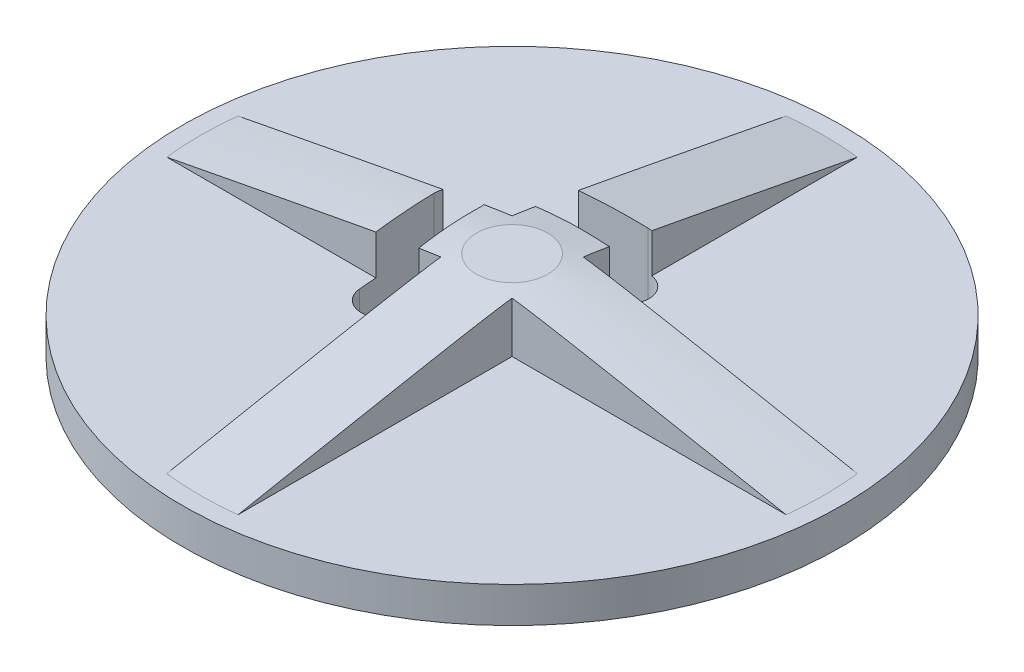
ISO-10303-21;
HEADER;
FILE_DESCRIPTION(('STEP AP214'),'2;1');
FILE_NAME('part.step','',(''),(''),'','','');
FILE_SCHEMA(('AUTOMOTIVE_DESIGN { 1 0 10303 214 1 1 1 1 }'));
ENDSEC;
DATA;
#1=APPLICATION_CONTEXT('core data for automotive mechanical design processes');
#2=APPLICATION_PROTOCOL_DEFINITION('international standard','automotive_design',2000,#1);
#3=PRODUCT_CONTEXT('',#1,'mechanical');
#4=PRODUCT('Part','Part','',(#3));
#5=PRODUCT_RELATED_PRODUCT_CATEGORY('part','',(#4));
#6=PRODUCT_DEFINITION_FORMATION('','',#4);
#7=PRODUCT_DEFINITION_CONTEXT('part definition',#1,'design');
#8=PRODUCT_DEFINITION('design','',#6,#7);
#9=PRODUCT_DEFINITION_SHAPE('','',#8);
#10=(LENGTH_UNIT() NAMED_UNIT(*) SI_UNIT(.MILLI.,.METRE.));
#11=(NAMED_UNIT(*) PLANE_ANGLE_UNIT() SI_UNIT($,.RADIAN.));
#12=(NAMED_UNIT(*) SI_UNIT($,.STERADIAN.) SOLID_ANGLE_UNIT());
#13=UNCERTAINTY_MEASURE_WITH_UNIT(LENGTH_MEASURE(1.E-05),#10,'distance_accuracy_value','');
#14=(GEOMETRIC_REPRESENTATION_CONTEXT(3) GLOBAL_UNCERTAINTY_ASSIGNED_CONTEXT((#13)) GLOBAL_UNIT_ASSIGNED_CONTEXT((#10,
#11,#12)) REPRESENTATION_CONTEXT('',''));
#15=CARTESIAN_POINT('',(0.,0.,0.));
#16=DIRECTION('',(0.,0.,1.));
#17=DIRECTION('',(1.,0.,0.));
#18=AXIS2_PLACEMENT_3D('',#15,#16,#17);
#19=CARTESIAN_POINT('',(0.,25.4,0.));
#20=DIRECTION('',(0.,-1.,0.));
#21=DIRECTION('',(0.,0.,-1.));
#22=AXIS2_PLACEMENT_3D('',#19,#20,#21);
#23=CONICAL_SURFACE('',#22,222.25,1.37961186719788);
#24=CARTESIAN_POINT('',(-44.8560905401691,58.7592315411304,-21.8480987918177));
#25=CARTESIAN_POINT('',(-44.873031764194,58.7380903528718,-22.0627637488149));
#26=CARTESIAN_POINT('',(-44.89451361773,58.7159990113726,-22.2769483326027));
#27=CARTESIAN_POINT('',(-44.9464949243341,58.6699966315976,-22.7040195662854));
#28=CARTESIAN_POINT('',(-44.9769941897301,58.6460856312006,-22.9169062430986));
#29=CARTESIAN_POINT('',(-45.0818953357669,58.5717629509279,-23.5529534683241));
#30=CARTESIAN_POINT('',(-45.1697145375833,58.5187441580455,-23.9736774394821));
#31=CARTESIAN_POINT('',(-45.3801172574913,58.4066072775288,-24.8047404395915));
#32=CARTESIAN_POINT('',(-45.5026471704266,58.3474986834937,-25.2150944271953));
#33=CARTESIAN_POINT('',(-45.7814822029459,58.2238669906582,-26.023343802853));
#34=CARTESIAN_POINT('',(-45.9377882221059,58.1593437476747,-26.4212388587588));
#35=CARTESIAN_POINT('',(-46.2828666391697,58.0256692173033,-27.2017555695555));
#36=CARTESIAN_POINT('',(-46.4716311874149,57.9565190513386,-27.5843808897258));
#37=CARTESIAN_POINT('',(-46.8802063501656,57.8143312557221,-28.3319264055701));
#38=CARTESIAN_POINT('',(-47.1000174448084,57.7412935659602,-28.6968463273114));
#39=CARTESIAN_POINT('',(-47.5690870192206,57.5920583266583,-29.406613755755));
#40=CARTESIAN_POINT('',(-47.8183487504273,57.5158604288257,-29.7514590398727));
#41=CARTESIAN_POINT('',(-48.344517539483,57.3610181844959,-30.4187835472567));
#42=CARTESIAN_POINT('',(-48.6214248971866,57.2823738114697,-30.7412625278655));
#43=CARTESIAN_POINT('',(-49.2059557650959,57.1219383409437,-31.3671082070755));
#44=CARTESIAN_POINT('',(-49.5140268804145,57.0401163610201,-31.6700490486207));
#45=CARTESIAN_POINT('',(-50.1545908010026,56.8753082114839,-32.2485597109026));
#46=CARTESIAN_POINT('',(-50.4870838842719,56.7923220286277,-32.5241292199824));
#47=CARTESIAN_POINT('',(-51.1742037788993,56.6258076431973,-33.04605089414));
#48=CARTESIAN_POINT('',(-51.528833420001,56.5422793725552,-33.2923993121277));
#49=CARTESIAN_POINT('',(-52.257719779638,56.3752863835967,-33.7541371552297));
#50=CARTESIAN_POINT('',(-52.6319765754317,56.2918216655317,-33.9695264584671));
#51=CARTESIAN_POINT('',(-53.4016372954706,56.1246204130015,-34.3699728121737));
#52=CARTESIAN_POINT('',(-53.7972251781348,56.0408905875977,-34.554679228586));
#53=CARTESIAN_POINT('',(-54.6030001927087,55.8746069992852,-34.8895591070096));
#54=CARTESIAN_POINT('',(-55.0131874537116,55.7920532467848,-35.039732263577));
#55=CARTESIAN_POINT('',(-55.8452293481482,55.6286318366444,-35.3043978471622));
#56=CARTESIAN_POINT('',(-56.2670835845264,55.5477641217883,-35.4188914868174));
#57=CARTESIAN_POINT('',(-57.1194556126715,55.3881869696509,-35.6112905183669));
#58=CARTESIAN_POINT('',(-57.549973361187,55.3094775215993,-35.6891960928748));
#59=CARTESIAN_POINT('',(-58.4155104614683,55.1548508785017,-35.8076006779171));
#60=CARTESIAN_POINT('',(-58.8505161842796,55.0789273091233,-35.8481909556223));
#61=CARTESIAN_POINT('',(-59.7229214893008,54.930082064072,-35.8918733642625));
#62=CARTESIAN_POINT('',(-60.1603210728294,54.8571603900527,-35.8949654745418));
#63=CARTESIAN_POINT('',(-61.0343128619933,54.71470544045,-35.8634912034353));
#64=CARTESIAN_POINT('',(-61.4709050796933,54.6451721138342,-35.8289253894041));
#65=CARTESIAN_POINT('',(-62.3400650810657,54.5098519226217,-35.7222438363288));
#66=CARTESIAN_POINT('',(-62.7726329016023,54.4440650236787,-35.6501284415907));
#67=CARTESIAN_POINT('',(-63.6258546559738,54.3172636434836,-35.4697187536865));
#68=CARTESIAN_POINT('',(-64.0465869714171,54.256205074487,-35.3618260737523));
#69=CARTESIAN_POINT('',(-64.8778551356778,54.1383768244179,-35.1103209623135));
#70=CARTESIAN_POINT('',(-65.2883910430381,54.081607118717,-34.9667087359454));
#71=CARTESIAN_POINT('',(-66.0961842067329,53.9726332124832,-34.6446865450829));
#72=CARTESIAN_POINT('',(-66.4934421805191,53.9204287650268,-34.4662784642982));
#73=CARTESIAN_POINT('',(-67.2717101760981,53.8208315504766,-34.0758445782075));
#74=CARTESIAN_POINT('',(-67.6527203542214,53.7734387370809,-33.8638190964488));
#75=CARTESIAN_POINT('',(-68.3905029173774,53.6843050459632,-33.4107342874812));
#76=CARTESIAN_POINT('',(-68.7475359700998,53.6424955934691,-33.1701128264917));
#77=CARTESIAN_POINT('',(-69.4403211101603,53.5639677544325,-32.6592274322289));
#78=CARTESIAN_POINT('',(-69.77607337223,53.5272493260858,-32.3889637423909));
#79=CARTESIAN_POINT('',(-70.4237428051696,53.459075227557,-31.8207085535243));
#80=CARTESIAN_POINT('',(-70.7356625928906,53.4276189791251,-31.5227201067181));
#81=CARTESIAN_POINT('',(-71.333353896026,53.3701080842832,-30.9011017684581));
#82=CARTESIAN_POINT('',(-71.6191256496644,53.3440533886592,-30.5774721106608));
#83=CARTESIAN_POINT('',(-72.1590558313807,53.297747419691,-29.9109723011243));
#84=CARTESIAN_POINT('',(-72.4135562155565,53.2774294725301,-29.5683837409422));
#85=CARTESIAN_POINT('',(-72.8930495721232,53.2422704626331,-28.8628758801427));
#86=CARTESIAN_POINT('',(-73.1180425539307,53.2274293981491,-28.4999565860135));
#87=CARTESIAN_POINT('',(-73.5369244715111,53.2032862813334,-27.7562591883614));
#88=CARTESIAN_POINT('',(-73.730803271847,53.1939860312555,-27.3754753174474));
#89=CARTESIAN_POINT('',(-74.0859341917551,53.1809736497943,-26.5989083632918));
#90=CARTESIAN_POINT('',(-74.2471874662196,53.1772613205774,-26.2031258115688));
#91=CARTESIAN_POINT('',(-74.5349708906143,53.1754463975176,-25.4019906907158));
#92=CARTESIAN_POINT('',(-74.6617172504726,53.1773079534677,-24.9967158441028));
#93=CARTESIAN_POINT('',(-74.8809468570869,53.186555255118,-24.1770640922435));
#94=CARTESIAN_POINT('',(-74.973430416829,53.1939409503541,-23.7626872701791));
#95=CARTESIAN_POINT('',(-75.1233942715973,53.2141888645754,-22.9283956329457));
#96=CARTESIAN_POINT('',(-75.1809235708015,53.227043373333,-22.5084894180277));
#97=CARTESIAN_POINT('',(-75.2607917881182,53.2581669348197,-21.665713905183));
#98=CARTESIAN_POINT('',(-75.2831489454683,53.27643317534,-21.2428462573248));
#99=CARTESIAN_POINT('',(-75.2904662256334,53.3087078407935,-20.5907599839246));
#100=CARTESIAN_POINT('',(-75.2878617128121,53.320836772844,-20.3615210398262));
#101=CARTESIAN_POINT('',(-75.2723379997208,53.346625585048,-19.9038364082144));
#102=CARTESIAN_POINT('',(-75.2594348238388,53.3602830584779,-19.675390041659));
#103=CARTESIAN_POINT('',(-75.241397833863,53.3747066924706,-19.4473711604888));
#104=B_SPLINE_CURVE_WITH_KNOTS('',3,(#24,#25,#26,#27,#28,#29,#30,#31,#32,#33,#34,#35,#36,#37,
#38,#39,#40,#41,#42,#43,#44,#45,#46,#47,#48,#49,#50,#51,#52,#53,#54,#55,#56,#57,#58,#59,#60,#61,
#62,#63,#64,#65,#66,#67,#68,#69,#70,#71,#72,#73,#74,#75,#76,#77,#78,#79,#80,#81,#82,#83,#84,#85,
#86,#87,#88,#89,#90,#91,#92,#93,#94,#95,#96,#97,#98,#99,#100,#101,#102,#103),.UNSPECIFIED.,.F.,
.F.,(4,2,2,2,2,2,2,2,2,2,2,2,2,2,2,2,2,2,2,2,2,2,2,2,2,2,2,2,2,2,2,2,2,2,2,2,2,2,2,4),(0.,
0.648997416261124,1.29798132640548,2.59541800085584,3.89086181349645,5.18634013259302,
6.48150559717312,7.77669109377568,9.07201971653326,10.367362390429,11.6850588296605,
13.0027702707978,14.3206505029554,15.6385359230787,16.9705762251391,18.3026283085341,
19.6346351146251,20.9666352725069,22.2953688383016,23.6241031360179,24.9528174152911,
26.2815195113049,27.5957846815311,28.9100423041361,30.2242287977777,31.5384026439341,
32.8345607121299,34.1307081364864,35.4267130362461,36.7227061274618,38.0029507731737,
39.2831950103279,40.5638554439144,41.8444705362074,43.1168666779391,44.3892511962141,
45.6598477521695,46.9297851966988,47.6182977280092,48.3057410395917),.UNSPECIFIED.);
#105=CARTESIAN_POINT('',(-74.5294099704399,53.1763682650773,-25.4));
#106=VERTEX_POINT('',#105);
#107=CARTESIAN_POINT('',(-75.2414136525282,53.3746940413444,-19.4475711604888));
#108=VERTEX_POINT('',#107);
#109=EDGE_CURVE('E245',#106,#108,#104,.T.);
#110=ORIENTED_EDGE('',*,*,#109,.F.);
#111=CARTESIAN_POINT('',(94.9021189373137,49.4014679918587,-25.4));
#112=CARTESIAN_POINT('',(92.9138395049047,49.7731966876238,-25.4));
#113=CARTESIAN_POINT('',(90.9254239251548,50.1441990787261,-25.4));
#114=CARTESIAN_POINT('',(86.9482533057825,50.8843877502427,-25.4));
#115=CARTESIAN_POINT('',(84.9594982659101,51.2535740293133,-25.4));
#116=CARTESIAN_POINT('',(80.9813875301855,51.9898028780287,-25.4));
#117=CARTESIAN_POINT('',(78.9920317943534,52.3568452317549,-25.4));
#118=CARTESIAN_POINT('',(75.0128279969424,53.0882509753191,-25.4));
#119=CARTESIAN_POINT('',(73.0229799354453,53.4526143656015,-25.4));
#120=CARTESIAN_POINT('',(69.0277031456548,54.1807435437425,-25.4));
#121=CARTESIAN_POINT('',(67.0222698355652,54.5444842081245,-25.4));
#122=CARTESIAN_POINT('',(63.0106329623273,55.267700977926,-25.4));
#123=CARTESIAN_POINT('',(61.004429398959,55.6271770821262,-25.4));
#124=CARTESIAN_POINT('',(56.9912343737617,56.3406159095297,-25.4));
#125=CARTESIAN_POINT('',(54.9842430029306,56.6945791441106,-25.4));
#126=CARTESIAN_POINT('',(50.9690074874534,57.3953470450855,-25.4));
#127=CARTESIAN_POINT('',(48.9607633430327,57.7421517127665,-25.4));
#128=CARTESIAN_POINT('',(45.9589722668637,58.2531512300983,-25.4));
#129=CARTESIAN_POINT('',(44.9660427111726,58.4209734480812,-25.4));
#130=CARTESIAN_POINT('',(42.9797274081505,58.7538768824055,-25.4));
#131=CARTESIAN_POINT('',(41.9863416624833,58.9189581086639,-25.4));
#132=CARTESIAN_POINT('',(39.9990426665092,59.2459184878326,-25.4));
#133=CARTESIAN_POINT('',(39.0051294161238,59.4077976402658,-25.4));
#134=CARTESIAN_POINT('',(37.0166825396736,59.7277905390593,-25.4));
#135=CARTESIAN_POINT('',(36.0221489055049,59.8859042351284,-25.4));
#136=CARTESIAN_POINT('',(34.031917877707,60.1977492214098,-25.4));
#137=CARTESIAN_POINT('',(33.036220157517,60.3514784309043,-25.4));
#138=CARTESIAN_POINT('',(31.044016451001,60.6536370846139,-25.4));
#139=CARTESIAN_POINT('',(30.0475104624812,60.8020665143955,-25.4));
#140=CARTESIAN_POINT('',(28.0535931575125,61.0925961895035,-25.4));
#141=CARTESIAN_POINT('',(27.0561818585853,61.2346965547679,-25.4));
#142=CARTESIAN_POINT('',(25.060312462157,61.511321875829,-25.4));
#143=CARTESIAN_POINT('',(24.0618543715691,61.645846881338,-25.4));
#144=CARTESIAN_POINT('',(22.0677854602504,61.9052911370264,-25.4));
#145=CARTESIAN_POINT('',(21.072179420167,62.0302469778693,-25.4));
#146=CARTESIAN_POINT('',(19.0796657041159,62.2693821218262,-25.4));
#147=CARTESIAN_POINT('',(18.0827580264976,62.3835614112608,-25.4));
#148=CARTESIAN_POINT('',(16.0874465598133,62.5991040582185,-25.4));
#149=CARTESIAN_POINT('',(15.0890426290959,62.7004661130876,-25.4));
#150=CARTESIAN_POINT('',(13.0908102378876,62.8880730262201,-25.4));
#151=CARTESIAN_POINT('',(12.0909817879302,62.9743179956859,-25.4));
#152=CARTESIAN_POINT('',(10.0913728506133,63.1291829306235,-25.4));
#153=CARTESIAN_POINT('',(9.09159429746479,63.1978276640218,-25.4));
#154=CARTESIAN_POINT('',(7.09083295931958,63.3153587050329,-25.4));
#155=CARTESIAN_POINT('',(6.08985015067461,63.3642446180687,-25.4));
#156=CARTESIAN_POINT('',(4.58801808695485,63.4213481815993,-25.4));
#157=CARTESIAN_POINT('',(4.08746799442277,63.4376765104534,-25.4));
#158=CARTESIAN_POINT('',(3.08621666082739,63.4647725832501,-25.4));
#159=CARTESIAN_POINT('',(2.58551542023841,63.4755403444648,-25.4));
#160=CARTESIAN_POINT('',(1.58406449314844,63.4913960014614,-25.4));
#161=CARTESIAN_POINT('',(1.08331481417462,63.4964843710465,-25.4));
#162=CARTESIAN_POINT('',(0.0817846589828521,63.5009300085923,-25.4));
#163=CARTESIAN_POINT('',(-0.418995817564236,63.5002871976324,-25.4));
#164=CARTESIAN_POINT('',(-1.78983283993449,63.4906806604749,-25.4));
#165=CARTESIAN_POINT('',(-2.65985535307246,63.4759299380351,-25.4));
#166=CARTESIAN_POINT('',(-4.39946682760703,63.4295899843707,-25.4));
#167=CARTESIAN_POINT('',(-5.26905577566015,63.3980002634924,-25.4));
#168=CARTESIAN_POINT('',(-7.00759767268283,63.3189587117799,-25.4));
#169=CARTESIAN_POINT('',(-7.8765505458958,63.2715052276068,-25.4));
#170=CARTESIAN_POINT('',(-9.61355200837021,63.1620630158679,-25.4));
#171=CARTESIAN_POINT('',(-10.4816005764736,63.1000739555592,-25.4));
#172=CARTESIAN_POINT('',(-12.2172881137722,62.963030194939,-25.4));
#173=CARTESIAN_POINT('',(-13.0849263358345,62.8879661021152,-25.4));
#174=CARTESIAN_POINT('',(-14.8191191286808,62.7263707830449,-25.4));
#175=CARTESIAN_POINT('',(-15.6856737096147,62.6398396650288,-25.4));
#176=CARTESIAN_POINT('',(-17.4177057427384,62.4568186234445,-25.4));
#177=CARTESIAN_POINT('',(-18.2831832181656,62.3603289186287,-25.4));
#178=CARTESIAN_POINT('',(-20.0131337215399,62.158770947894,-25.4));
#179=CARTESIAN_POINT('',(-20.8776067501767,62.0537026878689,-25.4));
#180=CARTESIAN_POINT('',(-22.6081410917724,61.8358975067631,-25.4));
#181=CARTESIAN_POINT('',(-23.4741996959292,61.7231391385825,-25.4));
#182=CARTESIAN_POINT('',(-25.2054722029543,61.4913008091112,-25.4));
#183=CARTESIAN_POINT('',(-26.0706861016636,61.3722208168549,-25.4));
#184=CARTESIAN_POINT('',(-27.8003415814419,61.1286611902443,-25.4));
#185=CARTESIAN_POINT('',(-28.6647831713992,61.004181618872,-25.4));
#186=CARTESIAN_POINT('',(-30.3929882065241,60.7505945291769,-25.4));
#187=CARTESIAN_POINT('',(-31.2567516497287,60.6214869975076,-25.4));
#188=CARTESIAN_POINT('',(-33.846506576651,60.2283332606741,-25.4));
#189=CARTESIAN_POINT('',(-35.5715993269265,59.95836521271,-25.4));
#190=CARTESIAN_POINT('',(-39.019896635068,59.4067205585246,-25.4));
#191=CARTESIAN_POINT('',(-40.7431011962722,59.125043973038,-25.4));
#192=CARTESIAN_POINT('',(-44.2018106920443,58.550540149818,-25.4));
#193=CARTESIAN_POINT('',(-45.9373037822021,58.2576417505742,-25.4));
#194=CARTESIAN_POINT('',(-49.4071076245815,57.6649427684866,-25.4));
#195=CARTESIAN_POINT('',(-51.1414183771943,57.3651421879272,-25.4));
#196=CARTESIAN_POINT('',(-54.6092160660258,56.7601392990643,-25.4));
#197=CARTESIAN_POINT('',(-56.3427029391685,56.4549366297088,-25.4));
#198=CARTESIAN_POINT('',(-59.8089201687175,55.8402712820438,-25.4));
#199=CARTESIAN_POINT('',(-61.5416505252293,55.530808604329,-25.4));
#200=CARTESIAN_POINT('',(-65.0037742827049,54.9089536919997,-25.4));
#201=CARTESIAN_POINT('',(-66.7331686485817,54.5965668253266,-25.4));
#202=CARTESIAN_POINT('',(-70.1914537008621,53.9690163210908,-25.4));
#203=CARTESIAN_POINT('',(-71.9203443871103,53.6538526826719,-25.4));
#204=CARTESIAN_POINT('',(-77.106325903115,52.7049730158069,-25.4));
#205=CARTESIAN_POINT('',(-80.5627943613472,52.0678559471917,-25.4));
#206=CARTESIAN_POINT('',(-87.5429671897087,50.7746453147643,-25.4));
#207=CARTESIAN_POINT('',(-91.066648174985,50.1184257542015,-25.4));
#208=CARTESIAN_POINT('',(-98.1131419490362,48.8012488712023,-25.4));
#209=CARTESIAN_POINT('',(-101.635954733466,48.1402915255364,-25.4));
#210=CARTESIAN_POINT('',(-108.682376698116,46.8145891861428,-25.4));
#211=CARTESIAN_POINT('',(-112.205985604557,46.1498427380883,-25.4));
#212=CARTESIAN_POINT('',(-119.252691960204,44.8176711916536,-25.4));
#213=CARTESIAN_POINT('',(-122.775789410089,44.1502460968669,-25.4));
#214=CARTESIAN_POINT('',(-129.809428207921,42.8156185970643,-25.4));
#215=CARTESIAN_POINT('',(-133.319970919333,42.14842337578,-25.4));
#216=CARTESIAN_POINT('',(-140.340743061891,40.8123864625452,-25.4));
#217=CARTESIAN_POINT('',(-143.850972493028,40.143544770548,-25.4));
#218=CARTESIAN_POINT('',(-154.38049467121,38.1351969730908,-25.4));
#219=CARTESIAN_POINT('',(-161.399411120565,36.7937181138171,-25.4));
#220=CARTESIAN_POINT('',(-175.761392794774,34.0450544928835,-25.4));
#221=CARTESIAN_POINT('',(-183.104425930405,32.6377021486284,-25.4));
#222=CARTESIAN_POINT('',(-197.790196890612,29.8202408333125,-25.4));
#223=CARTESIAN_POINT('',(-205.132934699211,28.4101317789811,-25.4));
#224=CARTESIAN_POINT('',(-219.826195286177,25.5863781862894,-25.4));
#225=CARTESIAN_POINT('',(-227.176717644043,24.1727314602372,-25.4));
#226=CARTESIAN_POINT('',(-241.877417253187,21.3439757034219,-25.4));
#227=CARTESIAN_POINT('',(-249.227594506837,19.9288666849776,-25.4));
#228=CARTESIAN_POINT('',(-263.746469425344,17.1324305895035,-25.4));
#229=CARTESIAN_POINT('',(-270.915172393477,15.7511310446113,-25.4));
#230=CARTESIAN_POINT('',(-285.252434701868,12.9876802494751,-25.4));
#231=CARTESIAN_POINT('',(-292.420994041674,11.6055289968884,-25.4));
#232=CARTESIAN_POINT('',(-306.750051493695,8.84207784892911,-25.4));
#233=CARTESIAN_POINT('',(-313.910549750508,7.46077870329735,-25.4));
#234=CARTESIAN_POINT('',(-328.231419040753,4.6976275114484,-25.4));
#235=CARTESIAN_POINT('',(-335.391790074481,3.31577546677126,-25.4));
#236=CARTESIAN_POINT('',(-342.552118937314,1.93370499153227,-25.4));
#237=B_SPLINE_CURVE_WITH_KNOTS('',3,(#111,#112,#113,#114,#115,#116,#117,#118,#119,#120,#121,
#122,#123,#124,#125,#126,#127,#128,#129,#130,#131,#132,#133,#134,#135,#136,#137,#138,#139,#140,
#141,#142,#143,#144,#145,#146,#147,#148,#149,#150,#151,#152,#153,#154,#155,#156,#157,#158,#159,
#160,#161,#162,#163,#164,#165,#166,#167,#168,#169,#170,#171,#172,#173,#174,#175,#176,#177,#178,
#179,#180,#181,#182,#183,#184,#185,#186,#187,#188,#189,#190,#191,#192,#193,#194,#195,#196,#197,
#198,#199,#200,#201,#202,#203,#204,#205,#206,#207,#208,#209,#210,#211,#212,#213,#214,#215,#216,
#217,#218,#219,#220,#221,#222,#223,#224,#225,#226,#227,#228,#229,#230,#231,#232,#233,#234,#235,
#236),.UNSPECIFIED.,.F.,.F.,(4,2,2,2,2,2,2,2,2,2,2,2,2,2,2,2,2,2,2,2,2,2,2,2,2,2,2,2,2,2,2,2,2,
2,2,2,2,2,2,2,2,2,2,2,2,2,2,2,2,2,2,2,2,2,2,2,2,2,2,2,2,2,4),(0.,6.06819088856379,
12.1363862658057,18.2051825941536,24.2739779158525,30.388435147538,36.502894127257,
42.6167825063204,48.7306697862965,51.7517031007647,54.7727254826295,57.7937483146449,
60.814811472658,63.8372852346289,66.8597672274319,69.8821919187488,72.9045967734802,
75.9147985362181,78.925004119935,81.9355153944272,84.946004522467,87.9522335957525,
90.9585226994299,92.4609458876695,93.9633644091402,95.4656575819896,96.9679714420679,
99.5782316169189,102.188567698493,104.799175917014,107.409843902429,110.022395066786,
112.634921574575,115.247390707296,117.859858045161,120.479935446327,123.100025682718,
125.720085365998,128.340152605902,133.578357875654,138.816553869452,144.096642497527,
149.37672937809,154.657170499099,159.937610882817,165.209753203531,170.481897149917,
181.025977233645,191.778766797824,202.531609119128,213.288901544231,224.046179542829,
234.766325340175,245.486471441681,266.924351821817,289.354397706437,311.785131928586,
334.240803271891,356.696286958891,378.597990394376,400.499754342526,422.377288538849,
444.254762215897),.UNSPECIFIED.);
#238=CARTESIAN_POINT('',(-220.793800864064,25.4,-25.4));
#239=VERTEX_POINT('',#238);
#240=EDGE_CURVE('E521',#106,#239,#237,.T.);
#241=ORIENTED_EDGE('',*,*,#240,.T.);
#242=CARTESIAN_POINT('',(0.,25.4,0.));
#243=DIRECTION('',(0.,-1.,0.));
#244=DIRECTION('',(0.,0.,-1.));
#245=AXIS2_PLACEMENT_3D('',#242,#243,#244);
#246=CIRCLE('',#245,222.25);
#247=CARTESIAN_POINT('',(-220.793800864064,25.4,25.4));
#248=VERTEX_POINT('',#247);
#249=EDGE_CURVE('E414',#248,#239,#246,.T.);
#250=ORIENTED_EDGE('',*,*,#249,.F.);
#251=CARTESIAN_POINT('',(94.9021189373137,49.4014679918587,25.4));
#252=CARTESIAN_POINT('',(92.9138395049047,49.7731966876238,25.4));
#253=CARTESIAN_POINT('',(90.9254239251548,50.1441990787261,25.4));
#254=CARTESIAN_POINT('',(86.9482533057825,50.8843877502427,25.4));
#255=CARTESIAN_POINT('',(84.9594982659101,51.2535740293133,25.4));
#256=CARTESIAN_POINT('',(80.9813875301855,51.9898028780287,25.4));
#257=CARTESIAN_POINT('',(78.9920317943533,52.3568452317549,25.4));
#258=CARTESIAN_POINT('',(75.0128279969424,53.0882509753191,25.4));
#259=CARTESIAN_POINT('',(73.0229799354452,53.4526143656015,25.4));
#260=CARTESIAN_POINT('',(69.0277031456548,54.1807435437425,25.4));
#261=CARTESIAN_POINT('',(67.0222698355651,54.5444842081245,25.4));
#262=CARTESIAN_POINT('',(63.0106329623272,55.267700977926,25.4));
#263=CARTESIAN_POINT('',(61.0044293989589,55.6271770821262,25.4));
#264=CARTESIAN_POINT('',(56.9912343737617,56.3406159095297,25.4));
#265=CARTESIAN_POINT('',(54.9842430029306,56.6945791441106,25.4));
#266=CARTESIAN_POINT('',(50.9690074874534,57.3953470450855,25.4));
#267=CARTESIAN_POINT('',(48.9607633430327,57.7421517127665,25.4));
#268=CARTESIAN_POINT('',(45.9589722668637,58.2531512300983,25.4));
#269=CARTESIAN_POINT('',(44.9660427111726,58.4209734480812,25.4));
#270=CARTESIAN_POINT('',(42.9797274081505,58.7538768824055,25.4));
#271=CARTESIAN_POINT('',(41.9863416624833,58.9189581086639,25.4));
#272=CARTESIAN_POINT('',(39.9990426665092,59.2459184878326,25.4));
#273=CARTESIAN_POINT('',(39.0051294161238,59.4077976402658,25.4));
#274=CARTESIAN_POINT('',(37.0166825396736,59.7277905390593,25.4));
#275=CARTESIAN_POINT('',(36.022148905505,59.8859042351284,25.4));
#276=CARTESIAN_POINT('',(34.031917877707,60.1977492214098,25.4));
#277=CARTESIAN_POINT('',(33.0362201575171,60.3514784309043,25.4));
#278=CARTESIAN_POINT('',(31.044016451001,60.6536370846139,25.4));
#279=CARTESIAN_POINT('',(30.0475104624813,60.8020665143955,25.4));
#280=CARTESIAN_POINT('',(28.0535931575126,61.0925961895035,25.4));
#281=CARTESIAN_POINT('',(27.0561818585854,61.2346965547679,25.4));
#282=CARTESIAN_POINT('',(25.060312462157,61.511321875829,25.4));
#283=CARTESIAN_POINT('',(24.0618543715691,61.645846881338,25.4));
#284=CARTESIAN_POINT('',(22.0677854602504,61.9052911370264,25.4));
#285=CARTESIAN_POINT('',(21.072179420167,62.0302469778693,25.4));
#286=CARTESIAN_POINT('',(19.0796657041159,62.2693821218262,25.4));
#287=CARTESIAN_POINT('',(18.0827580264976,62.3835614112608,25.4));
#288=CARTESIAN_POINT('',(16.0874465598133,62.5991040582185,25.4));
#289=CARTESIAN_POINT('',(15.0890426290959,62.7004661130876,25.4));
#290=CARTESIAN_POINT('',(13.0908102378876,62.8880730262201,25.4));
#291=CARTESIAN_POINT('',(12.0909817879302,62.9743179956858,25.4));
#292=CARTESIAN_POINT('',(10.0913728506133,63.1291829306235,25.4));
#293=CARTESIAN_POINT('',(9.09159429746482,63.1978276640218,25.4));
#294=CARTESIAN_POINT('',(7.09083295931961,63.3153587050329,25.4));
#295=CARTESIAN_POINT('',(6.08985015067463,63.3642446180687,25.4));
#296=CARTESIAN_POINT('',(4.58801808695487,63.4213481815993,25.4));
#297=CARTESIAN_POINT('',(4.08746799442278,63.4376765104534,25.4));
#298=CARTESIAN_POINT('',(3.08621666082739,63.4647725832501,25.4));
#299=CARTESIAN_POINT('',(2.58551542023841,63.4755403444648,25.4));
#300=CARTESIAN_POINT('',(1.58406449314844,63.4913960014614,25.4));
#301=CARTESIAN_POINT('',(1.08331481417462,63.4964843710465,25.4));
#302=CARTESIAN_POINT('',(0.0817846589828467,63.5009300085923,25.4));
#303=CARTESIAN_POINT('',(-0.418995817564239,63.5002871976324,25.4));
#304=CARTESIAN_POINT('',(-1.78983283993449,63.4906806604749,25.4));
#305=CARTESIAN_POINT('',(-2.65985535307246,63.4759299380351,25.4));
#306=CARTESIAN_POINT('',(-4.39946682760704,63.4295899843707,25.4));
#307=CARTESIAN_POINT('',(-5.26905577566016,63.3980002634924,25.4));
#308=CARTESIAN_POINT('',(-7.00759767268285,63.3189587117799,25.4));
#309=CARTESIAN_POINT('',(-7.87655054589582,63.2715052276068,25.4));
#310=CARTESIAN_POINT('',(-9.61355200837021,63.1620630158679,25.4));
#311=CARTESIAN_POINT('',(-10.4816005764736,63.1000739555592,25.4));
#312=CARTESIAN_POINT('',(-12.2172881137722,62.963030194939,25.4));
#313=CARTESIAN_POINT('',(-13.0849263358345,62.8879661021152,25.4));
#314=CARTESIAN_POINT('',(-14.8191191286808,62.7263707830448,25.4));
#315=CARTESIAN_POINT('',(-15.6856737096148,62.6398396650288,25.4));
#316=CARTESIAN_POINT('',(-17.4177057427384,62.4568186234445,25.4));
#317=CARTESIAN_POINT('',(-18.2831832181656,62.3603289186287,25.4));
#318=CARTESIAN_POINT('',(-20.0131337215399,62.158770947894,25.4));
#319=CARTESIAN_POINT('',(-20.8776067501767,62.0537026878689,25.4));
#320=CARTESIAN_POINT('',(-22.6081410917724,61.8358975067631,25.4));
#321=CARTESIAN_POINT('',(-23.4741996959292,61.7231391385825,25.4));
#322=CARTESIAN_POINT('',(-25.2054722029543,61.4913008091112,25.4));
#323=CARTESIAN_POINT('',(-26.0706861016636,61.3722208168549,25.4));
#324=CARTESIAN_POINT('',(-27.8003415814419,61.1286611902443,25.4));
#325=CARTESIAN_POINT('',(-28.6647831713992,61.004181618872,25.4));
#326=CARTESIAN_POINT('',(-30.3929882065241,60.7505945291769,25.4));
#327=CARTESIAN_POINT('',(-31.2567516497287,60.6214869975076,25.4));
#328=CARTESIAN_POINT('',(-33.846506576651,60.2283332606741,25.4));
#329=CARTESIAN_POINT('',(-35.5715993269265,59.95836521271,25.4));
#330=CARTESIAN_POINT('',(-39.019896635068,59.4067205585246,25.4));
#331=CARTESIAN_POINT('',(-40.7431011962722,59.125043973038,25.4));
#332=CARTESIAN_POINT('',(-44.2018106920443,58.550540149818,25.4));
#333=CARTESIAN_POINT('',(-45.9373037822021,58.2576417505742,25.4));
#334=CARTESIAN_POINT('',(-49.4071076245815,57.6649427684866,25.4));
#335=CARTESIAN_POINT('',(-51.1414183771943,57.3651421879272,25.4));
#336=CARTESIAN_POINT('',(-54.6092160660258,56.7601392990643,25.4));
#337=CARTESIAN_POINT('',(-56.3427029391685,56.4549366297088,25.4));
#338=CARTESIAN_POINT('',(-59.8089201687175,55.8402712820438,25.4));
#339=CARTESIAN_POINT('',(-61.5416505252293,55.530808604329,25.4));
#340=CARTESIAN_POINT('',(-65.0037742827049,54.9089536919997,25.4));
#341=CARTESIAN_POINT('',(-66.7331686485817,54.5965668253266,25.4));
#342=CARTESIAN_POINT('',(-70.1914537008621,53.9690163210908,25.4));
#343=CARTESIAN_POINT('',(-71.9203443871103,53.6538526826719,25.4));
#344=CARTESIAN_POINT('',(-77.106325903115,52.7049730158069,25.4));
#345=CARTESIAN_POINT('',(-80.5627943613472,52.0678559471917,25.4));
#346=CARTESIAN_POINT('',(-87.5429671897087,50.7746453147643,25.4));
#347=CARTESIAN_POINT('',(-91.066648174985,50.1184257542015,25.4));
#348=CARTESIAN_POINT('',(-98.1131419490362,48.8012488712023,25.4));
#349=CARTESIAN_POINT('',(-101.635954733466,48.1402915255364,25.4));
#350=CARTESIAN_POINT('',(-108.682376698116,46.8145891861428,25.4));
#351=CARTESIAN_POINT('',(-112.205985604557,46.1498427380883,25.4));
#352=CARTESIAN_POINT('',(-119.252691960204,44.8176711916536,25.4));
#353=CARTESIAN_POINT('',(-122.775789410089,44.1502460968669,25.4));
#354=CARTESIAN_POINT('',(-129.809428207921,42.8156185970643,25.4));
#355=CARTESIAN_POINT('',(-133.319970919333,42.14842337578,25.4));
#356=CARTESIAN_POINT('',(-140.340743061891,40.8123864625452,25.4));
#357=CARTESIAN_POINT('',(-143.850972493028,40.143544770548,25.4));
#358=CARTESIAN_POINT('',(-154.38049467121,38.1351969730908,25.4));
#359=CARTESIAN_POINT('',(-161.399411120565,36.7937181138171,25.4));
#360=CARTESIAN_POINT('',(-175.761392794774,34.0450544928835,25.4));
#361=CARTESIAN_POINT('',(-183.104425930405,32.6377021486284,25.4));
#362=CARTESIAN_POINT('',(-197.790196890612,29.8202408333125,25.4));
#363=CARTESIAN_POINT('',(-205.132934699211,28.4101317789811,25.4));
#364=CARTESIAN_POINT('',(-219.826195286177,25.5863781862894,25.4));
#365=CARTESIAN_POINT('',(-227.176717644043,24.1727314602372,25.4));
#366=CARTESIAN_POINT('',(-241.877417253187,21.3439757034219,25.4));
#367=CARTESIAN_POINT('',(-249.227594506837,19.9288666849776,25.4));
#368=CARTESIAN_POINT('',(-263.746469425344,17.1324305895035,25.4));
#369=CARTESIAN_POINT('',(-270.915172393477,15.7511310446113,25.4));
#370=CARTESIAN_POINT('',(-285.252434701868,12.9876802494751,25.4));
#371=CARTESIAN_POINT('',(-292.420994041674,11.6055289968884,25.4));
#372=CARTESIAN_POINT('',(-306.750051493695,8.84207784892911,25.4));
#373=CARTESIAN_POINT('',(-313.910549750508,7.46077870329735,25.4));
#374=CARTESIAN_POINT('',(-328.231419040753,4.6976275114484,25.4));
#375=CARTESIAN_POINT('',(-335.391790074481,3.31577546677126,25.4));
#376=CARTESIAN_POINT('',(-342.552118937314,1.93370499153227,25.4));
#377=B_SPLINE_CURVE_WITH_KNOTS('',3,(#251,#252,#253,#254,#255,#256,#257,#258,#259,#260,#261,
#262,#263,#264,#265,#266,#267,#268,#269,#270,#271,#272,#273,#274,#275,#276,#277,#278,#279,#280,
#281,#282,#283,#284,#285,#286,#287,#288,#289,#290,#291,#292,#293,#294,#295,#296,#297,#298,#299,
#300,#301,#302,#303,#304,#305,#306,#307,#308,#309,#310,#311,#312,#313,#314,#315,#316,#317,#318,
#319,#320,#321,#322,#323,#324,#325,#326,#327,#328,#329,#330,#331,#332,#333,#334,#335,#336,#337,
#338,#339,#340,#341,#342,#343,#344,#345,#346,#347,#348,#349,#350,#351,#352,#353,#354,#355,#356,
#357,#358,#359,#360,#361,#362,#363,#364,#365,#366,#367,#368,#369,#370,#371,#372,#373,#374,#375,
#376),.UNSPECIFIED.,.F.,.F.,(4,2,2,2,2,2,2,2,2,2,2,2,2,2,2,2,2,2,2,2,2,2,2,2,2,2,2,2,2,2,2,2,2,
2,2,2,2,2,2,2,2,2,2,2,2,2,2,2,2,2,2,2,2,2,2,2,2,2,2,2,2,2,4),(0.,6.06819088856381,
12.1363862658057,18.2051825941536,24.2739779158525,30.388435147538,36.502894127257,
42.6167825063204,48.7306697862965,51.7517031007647,54.7727254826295,57.7937483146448,
60.814811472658,63.8372852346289,66.8597672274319,69.8821919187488,72.9045967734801,
75.914798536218,78.925004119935,81.9355153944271,84.946004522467,87.9522335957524,
90.9585226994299,92.4609458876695,93.9633644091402,95.4656575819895,96.9679714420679,
99.5782316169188,102.188567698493,104.799175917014,107.409843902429,110.022395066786,
112.634921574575,115.247390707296,117.859858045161,120.479935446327,123.100025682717,
125.720085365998,128.340152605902,133.578357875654,138.816553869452,144.096642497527,
149.37672937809,154.657170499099,159.937610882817,165.20975320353,170.481897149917,
181.025977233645,191.778766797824,202.531609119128,213.288901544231,224.046179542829,
234.766325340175,245.486471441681,266.924351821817,289.354397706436,311.785131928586,
334.240803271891,356.696286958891,378.597990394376,400.499754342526,422.377288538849,
444.254762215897),.UNSPECIFIED.);
#378=CARTESIAN_POINT('',(-71.6945671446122,53.6946512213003,25.4));
#379=VERTEX_POINT('',#378);
#380=EDGE_CURVE('E493',#379,#248,#377,.T.);
#381=ORIENTED_EDGE('',*,*,#380,.F.);
#382=CARTESIAN_POINT('',(-75.2414294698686,53.3746813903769,-19.4477711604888));
#383=CARTESIAN_POINT('',(-75.1467644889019,53.4504032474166,-18.2507939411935));
#384=CARTESIAN_POINT('',(-75.0520753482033,53.5213166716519,-17.0535112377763));
#385=CARTESIAN_POINT('',(-74.862653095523,53.653119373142,-14.6583898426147));
#386=CARTESIAN_POINT('',(-74.7679199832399,53.7140085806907,-13.4605511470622));
#387=CARTESIAN_POINT('',(-74.5784117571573,53.8253566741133,-11.0643426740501));
#388=CARTESIAN_POINT('',(-74.4836366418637,53.8758151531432,-9.86597287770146));
#389=CARTESIAN_POINT('',(-74.2940550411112,53.9659586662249,-7.46883662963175));
#390=CARTESIAN_POINT('',(-74.1992485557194,54.0056437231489,-6.27007017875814));
#391=CARTESIAN_POINT('',(-73.915044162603,54.1079970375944,-2.67649015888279));
#392=CARTESIAN_POINT('',(-73.7256072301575,54.1541143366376,-0.281183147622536));
#393=CARTESIAN_POINT('',(-73.3467033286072,54.2007716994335,4.50981066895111));
#394=CARTESIAN_POINT('',(-73.1572363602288,54.2013127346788,6.90549746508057));
#395=CARTESIAN_POINT('',(-72.7783486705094,54.1568124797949,11.6962862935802));
#396=CARTESIAN_POINT('',(-72.5889279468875,54.1117743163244,14.0913883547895));
#397=CARTESIAN_POINT('',(-72.2101804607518,53.9774593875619,18.8804044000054));
#398=CARTESIAN_POINT('',(-72.020853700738,53.888181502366,21.2743183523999));
#399=CARTESIAN_POINT('',(-71.6420981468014,53.6677433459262,26.0634364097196));
#400=CARTESIAN_POINT('',(-71.4526695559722,53.5365271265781,28.4586379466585));
#401=CARTESIAN_POINT('',(-71.1686772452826,53.3108442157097,32.0495363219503));
#402=CARTESIAN_POINT('',(-71.0740405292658,53.2308091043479,33.246156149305));
#403=CARTESIAN_POINT('',(-70.8848186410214,53.0615942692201,35.6387440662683));
#404=CARTESIAN_POINT('',(-70.7902334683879,52.9724146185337,36.8347121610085));
#405=CARTESIAN_POINT('',(-70.6956747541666,52.8788996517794,38.0303457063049));
#406=B_SPLINE_CURVE_WITH_KNOTS('',3,(#382,#383,#384,#385,#386,#387,#388,#389,#390,#391,#392,
#393,#394,#395,#396,#397,#398,#399,#400,#401,#402,#403,#404,#405),.UNSPECIFIED.,.F.,.F.,(4,2,2,
2,2,2,2,2,2,2,2,4),(0.,3.60929495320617,7.21861500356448,10.8280758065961,14.4375289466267,
21.6467576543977,28.8558326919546,36.0644132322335,43.2731762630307,50.491596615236,
54.1006318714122,57.7096382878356),.UNSPECIFIED.);
#407=EDGE_CURVE('E297',#108,#379,#406,.T.);
#408=ORIENTED_EDGE('',*,*,#407,.F.);
#409=EDGE_LOOP('',(#110,#241,#250,#381,#408));
#410=FACE_BOUND('',#409,.T.);
#411=ADVANCED_FACE('F33',(#410),#23,.T.);
#412=CARTESIAN_POINT('',(-44.856290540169,58.7589821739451,-21.8506303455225));
#413=VERTEX_POINT('',#412);
#414=CARTESIAN_POINT('',(-45.5682942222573,58.3188570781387,-25.4));
#415=VERTEX_POINT('',#414);
#416=EDGE_CURVE('E253',#413,#415,#104,.T.);
#417=ORIENTED_EDGE('',*,*,#416,.F.);
#418=CARTESIAN_POINT('',(-40.3105516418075,58.0035781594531,35.6272865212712));
#419=CARTESIAN_POINT('',(-40.4049526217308,58.1428654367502,34.4336474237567));
#420=CARTESIAN_POINT('',(-40.499399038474,58.2773133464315,33.239433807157));
#421=CARTESIAN_POINT('',(-40.6883883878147,58.5351870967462,30.8497861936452));
#422=CARTESIAN_POINT('',(-40.7829313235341,58.6586125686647,29.6543521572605));
#423=CARTESIAN_POINT('',(-40.9721477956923,58.8931316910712,27.2618327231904));
#424=CARTESIAN_POINT('',(-41.0668213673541,59.0042207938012,26.064746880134));
#425=CARTESIAN_POINT('',(-41.2562625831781,59.2125718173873,23.6693857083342));
#426=CARTESIAN_POINT('',(-41.3510302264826,59.3098338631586,22.4711103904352));
#427=CARTESIAN_POINT('',(-41.5403278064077,59.488775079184,20.0775654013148));
#428=CARTESIAN_POINT('',(-41.6348574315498,59.570506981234,18.8822996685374));
#429=CARTESIAN_POINT('',(-41.8239971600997,59.7174325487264,16.4907506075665));
#430=CARTESIAN_POINT('',(-41.9186072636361,59.7826261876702,15.2944672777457));
#431=CARTESIAN_POINT('',(-42.1078784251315,59.8952502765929,12.9012563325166));
#432=CARTESIAN_POINT('',(-42.2025394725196,59.9426835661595,11.7043288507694));
#433=CARTESIAN_POINT('',(-42.3919085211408,60.018840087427,9.30988018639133));
#434=CARTESIAN_POINT('',(-42.4866165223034,60.0475633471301,8.11235900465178));
#435=CARTESIAN_POINT('',(-42.6760999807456,60.0856918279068,5.71646370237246));
#436=CARTESIAN_POINT('',(-42.7708754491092,60.0950882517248,4.518089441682));
#437=CARTESIAN_POINT('',(-42.9604259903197,60.0943288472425,2.12134592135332));
#438=CARTESIAN_POINT('',(-43.0552010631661,60.0841729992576,0.922976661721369));
#439=CARTESIAN_POINT('',(-43.244739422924,60.0445307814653,-1.47361283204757));
#440=CARTESIAN_POINT('',(-43.3395027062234,60.0150416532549,-2.67183302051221));
#441=CARTESIAN_POINT('',(-43.528981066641,59.9373631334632,-5.06766386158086));
#442=CARTESIAN_POINT('',(-43.623696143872,59.8891737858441,-6.26527451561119));
#443=CARTESIAN_POINT('',(-43.8133828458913,59.7748751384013,-8.66373970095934));
#444=CARTESIAN_POINT('',(-43.9083542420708,59.7087051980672,-9.86459134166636));
#445=CARTESIAN_POINT('',(-44.0982167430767,59.5597563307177,-12.2652793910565));
#446=CARTESIAN_POINT('',(-44.1931078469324,59.4769772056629,-13.4651157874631));
#447=CARTESIAN_POINT('',(-44.3827741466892,59.2962266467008,-15.8633229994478));
#448=CARTESIAN_POINT('',(-44.4775493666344,59.1982592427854,-17.0616941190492));
#449=CARTESIAN_POINT('',(-44.6670015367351,58.9885672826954,-19.4571938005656));
#450=CARTESIAN_POINT('',(-44.7616784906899,58.8768432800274,-20.6543224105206));
#451=CARTESIAN_POINT('',(-44.8563063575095,58.7589624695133,-21.8508303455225));
#452=B_SPLINE_CURVE_WITH_KNOTS('',3,(#418,#419,#420,#421,#422,#423,#424,#425,#426,#427,#428,
#429,#430,#431,#432,#433,#434,#435,#436,#437,#438,#439,#440,#441,#442,#443,#444,#445,#446,#447,
#448,#449,#450,#451),.UNSPECIFIED.,.F.,.F.,(4,2,2,2,2,2,2,2,2,2,2,2,2,2,2,2,4),(0.,
3.61633140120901,7.23278372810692,10.8505648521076,14.4683132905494,18.07354931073,
21.6787911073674,25.283456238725,28.8881159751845,32.4944161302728,36.1007199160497,
39.7075383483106,43.314348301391,46.9334767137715,50.5526482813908,54.1708611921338,
57.7889285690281),.UNSPECIFIED.);
#453=CARTESIAN_POINT('',(-41.1193940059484,59.0615837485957,25.4));
#454=VERTEX_POINT('',#453);
#455=EDGE_CURVE('E289',#454,#413,#452,.T.);
#456=ORIENTED_EDGE('',*,*,#455,.F.);
#457=CARTESIAN_POINT('',(-25.4,61.4636726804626,25.4));
#458=VERTEX_POINT('',#457);
#459=EDGE_CURVE('E494',#458,#454,#377,.T.);
#460=ORIENTED_EDGE('',*,*,#459,.F.);
#461=CARTESIAN_POINT('',(-25.4,49.4014679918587,-94.9021189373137));
#462=CARTESIAN_POINT('',(-25.4,49.7731966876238,-92.9138395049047));
#463=CARTESIAN_POINT('',(-25.4,50.1441990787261,-90.9254239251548));
#464=CARTESIAN_POINT('',(-25.4,50.8843877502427,-86.9482533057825));
#465=CARTESIAN_POINT('',(-25.4,51.2535740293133,-84.9594982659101));
#466=CARTESIAN_POINT('',(-25.4,51.9898028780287,-80.9813875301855));
#467=CARTESIAN_POINT('',(-25.4,52.3568452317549,-78.9920317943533));
#468=CARTESIAN_POINT('',(-25.4,53.0882509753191,-75.0128279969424));
#469=CARTESIAN_POINT('',(-25.4,53.4526143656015,-73.0229799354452));
#470=CARTESIAN_POINT('',(-25.4,54.1807435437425,-69.0277031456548));
#471=CARTESIAN_POINT('',(-25.4,54.5444842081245,-67.0222698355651));
#472=CARTESIAN_POINT('',(-25.4,55.267700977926,-63.0106329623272));
#473=CARTESIAN_POINT('',(-25.4,55.6271770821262,-61.0044293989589));
#474=CARTESIAN_POINT('',(-25.4,56.3406159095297,-56.9912343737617));
#475=CARTESIAN_POINT('',(-25.4,56.6945791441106,-54.9842430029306));
#476=CARTESIAN_POINT('',(-25.4,57.3953470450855,-50.9690074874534));
#477=CARTESIAN_POINT('',(-25.4,57.7421517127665,-48.9607633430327));
#478=CARTESIAN_POINT('',(-25.4,58.2531512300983,-45.9589722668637));
#479=CARTESIAN_POINT('',(-25.4,58.4209734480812,-44.9660427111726));
#480=CARTESIAN_POINT('',(-25.4,58.7538768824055,-42.9797274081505));
#481=CARTESIAN_POINT('',(-25.4,58.9189581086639,-41.9863416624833));
#482=CARTESIAN_POINT('',(-25.4,59.2459184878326,-39.9990426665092));
#483=CARTESIAN_POINT('',(-25.4,59.4077976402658,-39.0051294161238));
#484=CARTESIAN_POINT('',(-25.4,59.7277905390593,-37.0166825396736));
#485=CARTESIAN_POINT('',(-25.4,59.8859042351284,-36.022148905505));
#486=CARTESIAN_POINT('',(-25.4,60.1977492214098,-34.031917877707));
#487=CARTESIAN_POINT('',(-25.4,60.3514784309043,-33.036220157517));
#488=CARTESIAN_POINT('',(-25.4,60.6536370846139,-31.044016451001));
#489=CARTESIAN_POINT('',(-25.4,60.8020665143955,-30.0475104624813));
#490=CARTESIAN_POINT('',(-25.4,61.0925961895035,-28.0535931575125));
#491=CARTESIAN_POINT('',(-25.4,61.2346965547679,-27.0561818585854));
#492=CARTESIAN_POINT('',(-25.4,61.511321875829,-25.060312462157));
#493=CARTESIAN_POINT('',(-25.4,61.645846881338,-24.0618543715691));
#494=CARTESIAN_POINT('',(-25.4,61.9052911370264,-22.0677854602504));
#495=CARTESIAN_POINT('',(-25.4,62.0302469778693,-21.072179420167));
#496=CARTESIAN_POINT('',(-25.4,62.2693821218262,-19.0796657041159));
#497=CARTESIAN_POINT('',(-25.4,62.3835614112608,-18.0827580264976));
#498=CARTESIAN_POINT('',(-25.4,62.5991040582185,-16.0874465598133));
#499=CARTESIAN_POINT('',(-25.4,62.7004661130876,-15.0890426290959));
#500=CARTESIAN_POINT('',(-25.4,62.8880730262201,-13.0908102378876));
#501=CARTESIAN_POINT('',(-25.4,62.9743179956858,-12.0909817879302));
#502=CARTESIAN_POINT('',(-25.4,63.1291829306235,-10.0913728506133));
#503=CARTESIAN_POINT('',(-25.4,63.1978276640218,-9.09159429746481));
#504=CARTESIAN_POINT('',(-25.4,63.3153587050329,-7.0908329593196));
#505=CARTESIAN_POINT('',(-25.4,63.3642446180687,-6.08985015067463));
#506=CARTESIAN_POINT('',(-25.4,63.4213481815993,-4.58801808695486));
#507=CARTESIAN_POINT('',(-25.4,63.4376765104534,-4.08746799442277));
#508=CARTESIAN_POINT('',(-25.4,63.4647725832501,-3.08621666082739));
#509=CARTESIAN_POINT('',(-25.4,63.4755403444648,-2.58551542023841));
#510=CARTESIAN_POINT('',(-25.4,63.4913960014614,-1.58406449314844));
#511=CARTESIAN_POINT('',(-25.4,63.4964843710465,-1.08331481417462));
#512=CARTESIAN_POINT('',(-25.4,63.5009300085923,-0.0817846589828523));
#513=CARTESIAN_POINT('',(-25.4,63.5002871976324,0.418995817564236));
#514=CARTESIAN_POINT('',(-25.4,63.4906806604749,1.78983283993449));
#515=CARTESIAN_POINT('',(-25.4,63.4759299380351,2.65985535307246));
#516=CARTESIAN_POINT('',(-25.4,63.4295899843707,4.39946682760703));
#517=CARTESIAN_POINT('',(-25.4,63.3980002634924,5.26905577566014));
#518=CARTESIAN_POINT('',(-25.4,63.3189587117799,7.00759767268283));
#519=CARTESIAN_POINT('',(-25.4,63.2715052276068,7.8765505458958));
#520=CARTESIAN_POINT('',(-25.4,63.1620630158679,9.6135520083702));
#521=CARTESIAN_POINT('',(-25.4,63.1000739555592,10.4816005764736));
#522=CARTESIAN_POINT('',(-25.4,62.963030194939,12.2172881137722));
#523=CARTESIAN_POINT('',(-25.4,62.8879661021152,13.0849263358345));
#524=CARTESIAN_POINT('',(-25.4,62.7263707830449,14.8191191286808));
#525=CARTESIAN_POINT('',(-25.4,62.6398396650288,15.6856737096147));
#526=CARTESIAN_POINT('',(-25.4,62.4568186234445,17.4177057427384));
#527=CARTESIAN_POINT('',(-25.4,62.3603289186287,18.2831832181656));
#528=CARTESIAN_POINT('',(-25.4,62.158770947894,20.0131337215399));
#529=CARTESIAN_POINT('',(-25.4,62.0537026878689,20.8776067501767));
#530=CARTESIAN_POINT('',(-25.4,61.8358975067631,22.6081410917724));
#531=CARTESIAN_POINT('',(-25.4,61.7231391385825,23.4741996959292));
#532=CARTESIAN_POINT('',(-25.4,61.4913008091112,25.2054722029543));
#533=CARTESIAN_POINT('',(-25.4,61.3722208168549,26.0706861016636));
#534=CARTESIAN_POINT('',(-25.4,61.1286611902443,27.8003415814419));
#535=CARTESIAN_POINT('',(-25.4,61.004181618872,28.6647831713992));
#536=CARTESIAN_POINT('',(-25.4,60.7505945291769,30.3929882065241));
#537=CARTESIAN_POINT('',(-25.4,60.6214869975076,31.2567516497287));
#538=CARTESIAN_POINT('',(-25.4,60.2283332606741,33.846506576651));
#539=CARTESIAN_POINT('',(-25.4,59.95836521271,35.5715993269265));
#540=CARTESIAN_POINT('',(-25.4,59.4067205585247,39.019896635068));
#541=CARTESIAN_POINT('',(-25.4,59.125043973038,40.7431011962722));
#542=CARTESIAN_POINT('',(-25.4,58.550540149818,44.2018106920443));
#543=CARTESIAN_POINT('',(-25.4,58.2576417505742,45.9373037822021));
#544=CARTESIAN_POINT('',(-25.4,57.6649427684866,49.4071076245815));
#545=CARTESIAN_POINT('',(-25.4,57.3651421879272,51.1414183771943));
#546=CARTESIAN_POINT('',(-25.4,56.7601392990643,54.6092160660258));
#547=CARTESIAN_POINT('',(-25.4,56.4549366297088,56.3427029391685));
#548=CARTESIAN_POINT('',(-25.4,55.8402712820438,59.8089201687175));
#549=CARTESIAN_POINT('',(-25.4,55.530808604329,61.5416505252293));
#550=CARTESIAN_POINT('',(-25.4,54.9089536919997,65.0037742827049));
#551=CARTESIAN_POINT('',(-25.4,54.5965668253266,66.7331686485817));
#552=CARTESIAN_POINT('',(-25.4,53.9690163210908,70.1914537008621));
#553=CARTESIAN_POINT('',(-25.4,53.6538526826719,71.9203443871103));
#554=CARTESIAN_POINT('',(-25.4,52.7049730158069,77.106325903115));
#555=CARTESIAN_POINT('',(-25.4,52.0678559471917,80.5627943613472));
#556=CARTESIAN_POINT('',(-25.4,50.7746453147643,87.5429671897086));
#557=CARTESIAN_POINT('',(-25.4,50.1184257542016,91.066648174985));
#558=CARTESIAN_POINT('',(-25.4,48.8012488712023,98.1131419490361));
#559=CARTESIAN_POINT('',(-25.4,48.1402915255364,101.635954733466));
#560=CARTESIAN_POINT('',(-25.4,46.8145891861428,108.682376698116));
#561=CARTESIAN_POINT('',(-25.4,46.1498427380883,112.205985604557));
#562=CARTESIAN_POINT('',(-25.4,44.8176711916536,119.252691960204));
#563=CARTESIAN_POINT('',(-25.4,44.1502460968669,122.775789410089));
#564=CARTESIAN_POINT('',(-25.4,42.8156185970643,129.809428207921));
#565=CARTESIAN_POINT('',(-25.4,42.14842337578,133.319970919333));
#566=CARTESIAN_POINT('',(-25.4,40.8123864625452,140.340743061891));
#567=CARTESIAN_POINT('',(-25.4,40.1435447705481,143.850972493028));
#568=CARTESIAN_POINT('',(-25.4,38.1351969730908,154.38049467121));
#569=CARTESIAN_POINT('',(-25.4,36.7937181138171,161.399411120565));
#570=CARTESIAN_POINT('',(-25.4,34.0450544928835,175.761392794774));
#571=CARTESIAN_POINT('',(-25.4,32.6377021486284,183.104425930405));
#572=CARTESIAN_POINT('',(-25.4,29.8202408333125,197.790196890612));
#573=CARTESIAN_POINT('',(-25.4,28.4101317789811,205.132934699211));
#574=CARTESIAN_POINT('',(-25.4,25.5863781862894,219.826195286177));
#575=CARTESIAN_POINT('',(-25.4,24.1727314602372,227.176717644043));
#576=CARTESIAN_POINT('',(-25.4,21.3439757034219,241.877417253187));
#577=CARTESIAN_POINT('',(-25.4,19.9288666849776,249.227594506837));
#578=CARTESIAN_POINT('',(-25.4,17.1324305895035,263.746469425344));
#579=CARTESIAN_POINT('',(-25.4,15.7511310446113,270.915172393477));
#580=CARTESIAN_POINT('',(-25.4,12.9876802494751,285.252434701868));
#581=CARTESIAN_POINT('',(-25.4,11.6055289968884,292.420994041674));
#582=CARTESIAN_POINT('',(-25.4,8.84207784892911,306.750051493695));
#583=CARTESIAN_POINT('',(-25.4,7.46077870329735,313.910549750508));
#584=CARTESIAN_POINT('',(-25.4,4.6976275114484,328.231419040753));
#585=CARTESIAN_POINT('',(-25.4,3.31577546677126,335.391790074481));
#586=CARTESIAN_POINT('',(-25.4,1.93370499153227,342.552118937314));
#587=B_SPLINE_CURVE_WITH_KNOTS('',3,(#461,#462,#463,#464,#465,#466,#467,#468,#469,#470,#471,
#472,#473,#474,#475,#476,#477,#478,#479,#480,#481,#482,#483,#484,#485,#486,#487,#488,#489,#490,
#491,#492,#493,#494,#495,#496,#497,#498,#499,#500,#501,#502,#503,#504,#505,#506,#507,#508,#509,
#510,#511,#512,#513,#514,#515,#516,#517,#518,#519,#520,#521,#522,#523,#524,#525,#526,#527,#528,
#529,#530,#531,#532,#533,#534,#535,#536,#537,#538,#539,#540,#541,#542,#543,#544,#545,#546,#547,
#548,#549,#550,#551,#552,#553,#554,#555,#556,#557,#558,#559,#560,#561,#562,#563,#564,#565,#566,
#567,#568,#569,#570,#571,#572,#573,#574,#575,#576,#577,#578,#579,#580,#581,#582,#583,#584,#585,
#586),.UNSPECIFIED.,.F.,.F.,(4,2,2,2,2,2,2,2,2,2,2,2,2,2,2,2,2,2,2,2,2,2,2,2,2,2,2,2,2,2,2,2,2,
2,2,2,2,2,2,2,2,2,2,2,2,2,2,2,2,2,2,2,2,2,2,2,2,2,2,2,2,2,4),(0.,6.06819088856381,
12.1363862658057,18.2051825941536,24.2739779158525,30.388435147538,36.502894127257,
42.6167825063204,48.7306697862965,51.7517031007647,54.7727254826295,57.7937483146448,
60.814811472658,63.8372852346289,66.8597672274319,69.8821919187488,72.9045967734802,
75.914798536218,78.925004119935,81.9355153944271,84.946004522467,87.9522335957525,
90.9585226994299,92.4609458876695,93.9633644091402,95.4656575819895,96.9679714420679,
99.5782316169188,102.188567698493,104.799175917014,107.409843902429,110.022395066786,
112.634921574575,115.247390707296,117.859858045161,120.479935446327,123.100025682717,
125.720085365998,128.340152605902,133.578357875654,138.816553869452,144.096642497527,
149.37672937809,154.657170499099,159.937610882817,165.20975320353,170.481897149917,
181.025977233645,191.778766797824,202.531609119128,213.288901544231,224.046179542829,
234.766325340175,245.486471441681,266.924351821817,289.354397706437,311.785131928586,
334.240803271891,356.696286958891,378.597990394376,400.499754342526,422.377288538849,
444.254762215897),.UNSPECIFIED.);
#588=CARTESIAN_POINT('',(-25.4,25.4,220.793800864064));
#589=VERTEX_POINT('',#588);
#590=EDGE_CURVE('E486',#458,#589,#587,.T.);
#591=ORIENTED_EDGE('',*,*,#590,.T.);
#592=CARTESIAN_POINT('',(25.4,25.4,220.793800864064));
#593=VERTEX_POINT('',#592);
#594=EDGE_CURVE('E784',#593,#589,#246,.T.);
#595=ORIENTED_EDGE('',*,*,#594,.F.);
#596=CARTESIAN_POINT('',(25.4,49.4014679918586,-94.9021189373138));
#597=CARTESIAN_POINT('',(25.4,49.7731966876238,-92.9138395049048));
#598=CARTESIAN_POINT('',(25.4,50.1441990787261,-90.9254239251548));
#599=CARTESIAN_POINT('',(25.4,50.8843877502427,-86.9482533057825));
#600=CARTESIAN_POINT('',(25.4,51.2535740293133,-84.9594982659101));
#601=CARTESIAN_POINT('',(25.4,51.9898028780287,-80.9813875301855));
#602=CARTESIAN_POINT('',(25.4,52.3568452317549,-78.9920317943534));
#603=CARTESIAN_POINT('',(25.4,53.0882509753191,-75.0128279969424));
#604=CARTESIAN_POINT('',(25.4,53.4526143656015,-73.0229799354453));
#605=CARTESIAN_POINT('',(25.4,54.1807435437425,-69.0277031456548));
#606=CARTESIAN_POINT('',(25.4,54.5444842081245,-67.0222698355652));
#607=CARTESIAN_POINT('',(25.4,55.267700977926,-63.0106329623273));
#608=CARTESIAN_POINT('',(25.4,55.6271770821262,-61.004429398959));
#609=CARTESIAN_POINT('',(25.4,56.3406159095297,-56.9912343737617));
#610=CARTESIAN_POINT('',(25.4,56.6945791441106,-54.9842430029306));
#611=CARTESIAN_POINT('',(25.4,57.3953470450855,-50.9690074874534));
#612=CARTESIAN_POINT('',(25.4,57.7421517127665,-48.9607633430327));
#613=CARTESIAN_POINT('',(25.4,58.2531512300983,-45.9589722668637));
#614=CARTESIAN_POINT('',(25.4,58.4209734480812,-44.9660427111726));
#615=CARTESIAN_POINT('',(25.4,58.7538768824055,-42.9797274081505));
#616=CARTESIAN_POINT('',(25.4,58.9189581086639,-41.9863416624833));
#617=CARTESIAN_POINT('',(25.4,59.2459184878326,-39.9990426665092));
#618=CARTESIAN_POINT('',(25.4,59.4077976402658,-39.0051294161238));
#619=CARTESIAN_POINT('',(25.4,59.7277905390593,-37.0166825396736));
#620=CARTESIAN_POINT('',(25.4,59.8859042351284,-36.022148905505));
#621=CARTESIAN_POINT('',(25.4,60.1977492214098,-34.0319178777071));
#622=CARTESIAN_POINT('',(25.4,60.3514784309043,-33.0362201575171));
#623=CARTESIAN_POINT('',(25.4,60.6536370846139,-31.044016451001));
#624=CARTESIAN_POINT('',(25.4,60.8020665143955,-30.0475104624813));
#625=CARTESIAN_POINT('',(25.4,61.0925961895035,-28.0535931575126));
#626=CARTESIAN_POINT('',(25.4,61.2346965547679,-27.0561818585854));
#627=CARTESIAN_POINT('',(25.4,61.511321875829,-25.060312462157));
#628=CARTESIAN_POINT('',(25.4,61.645846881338,-24.0618543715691));
#629=CARTESIAN_POINT('',(25.4,61.9052911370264,-22.0677854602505));
#630=CARTESIAN_POINT('',(25.4,62.0302469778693,-21.072179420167));
#631=CARTESIAN_POINT('',(25.4,62.2693821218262,-19.0796657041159));
#632=CARTESIAN_POINT('',(25.4,62.3835614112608,-18.0827580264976));
#633=CARTESIAN_POINT('',(25.4,62.5991040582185,-16.0874465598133));
#634=CARTESIAN_POINT('',(25.4,62.7004661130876,-15.0890426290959));
#635=CARTESIAN_POINT('',(25.4,62.8880730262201,-13.0908102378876));
#636=CARTESIAN_POINT('',(25.4,62.9743179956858,-12.0909817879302));
#637=CARTESIAN_POINT('',(25.4,63.1291829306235,-10.0913728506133));
#638=CARTESIAN_POINT('',(25.4,63.1978276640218,-9.09159429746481));
#639=CARTESIAN_POINT('',(25.4,63.3153587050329,-7.0908329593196));
#640=CARTESIAN_POINT('',(25.4,63.3642446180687,-6.08985015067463));
#641=CARTESIAN_POINT('',(25.4,63.4213481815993,-4.58801808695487));
#642=CARTESIAN_POINT('',(25.4,63.4376765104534,-4.08746799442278));
#643=CARTESIAN_POINT('',(25.4,63.4647725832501,-3.0862166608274));
#644=CARTESIAN_POINT('',(25.4,63.4755403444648,-2.58551542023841));
#645=CARTESIAN_POINT('',(25.4,63.4913960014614,-1.58406449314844));
#646=CARTESIAN_POINT('',(25.4,63.4964843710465,-1.08331481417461));
#647=CARTESIAN_POINT('',(25.4,63.5009300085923,-0.0817846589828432));
#648=CARTESIAN_POINT('',(25.4,63.5002871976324,0.41899581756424));
#649=CARTESIAN_POINT('',(25.4,63.4906806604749,1.78983283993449));
#650=CARTESIAN_POINT('',(25.4,63.4759299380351,2.65985535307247));
#651=CARTESIAN_POINT('',(25.4,63.4295899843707,4.39946682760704));
#652=CARTESIAN_POINT('',(25.4,63.3980002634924,5.26905577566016));
#653=CARTESIAN_POINT('',(25.4,63.3189587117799,7.00759767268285));
#654=CARTESIAN_POINT('',(25.4,63.2715052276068,7.87655054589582));
#655=CARTESIAN_POINT('',(25.4,63.1620630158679,9.61355200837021));
#656=CARTESIAN_POINT('',(25.4,63.1000739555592,10.4816005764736));
#657=CARTESIAN_POINT('',(25.4,62.963030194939,12.2172881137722));
#658=CARTESIAN_POINT('',(25.4,62.8879661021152,13.0849263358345));
#659=CARTESIAN_POINT('',(25.4,62.7263707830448,14.8191191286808));
#660=CARTESIAN_POINT('',(25.4,62.6398396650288,15.6856737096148));
#661=CARTESIAN_POINT('',(25.4,62.4568186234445,17.4177057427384));
#662=CARTESIAN_POINT('',(25.4,62.3603289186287,18.2831832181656));
#663=CARTESIAN_POINT('',(25.4,62.158770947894,20.0131337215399));
#664=CARTESIAN_POINT('',(25.4,62.0537026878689,20.8776067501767));
#665=CARTESIAN_POINT('',(25.4,61.8358975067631,22.6081410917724));
#666=CARTESIAN_POINT('',(25.4,61.7231391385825,23.4741996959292));
#667=CARTESIAN_POINT('',(25.4,61.4913008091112,25.2054722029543));
#668=CARTESIAN_POINT('',(25.4,61.3722208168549,26.0706861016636));
#669=CARTESIAN_POINT('',(25.4,61.1286611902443,27.8003415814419));
#670=CARTESIAN_POINT('',(25.4,61.004181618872,28.6647831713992));
#671=CARTESIAN_POINT('',(25.4,60.7505945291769,30.3929882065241));
#672=CARTESIAN_POINT('',(25.4,60.6214869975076,31.2567516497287));
#673=CARTESIAN_POINT('',(25.4,60.2283332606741,33.846506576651));
#674=CARTESIAN_POINT('',(25.4,59.95836521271,35.5715993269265));
#675=CARTESIAN_POINT('',(25.4,59.4067205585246,39.019896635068));
#676=CARTESIAN_POINT('',(25.4,59.125043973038,40.7431011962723));
#677=CARTESIAN_POINT('',(25.4,58.550540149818,44.2018106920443));
#678=CARTESIAN_POINT('',(25.4,58.2576417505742,45.9373037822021));
#679=CARTESIAN_POINT('',(25.4,57.6649427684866,49.4071076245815));
#680=CARTESIAN_POINT('',(25.4,57.3651421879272,51.1414183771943));
#681=CARTESIAN_POINT('',(25.4,56.7601392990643,54.6092160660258));
#682=CARTESIAN_POINT('',(25.4,56.4549366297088,56.3427029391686));
#683=CARTESIAN_POINT('',(25.4,55.8402712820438,59.8089201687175));
#684=CARTESIAN_POINT('',(25.4,55.530808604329,61.5416505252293));
#685=CARTESIAN_POINT('',(25.4,54.9089536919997,65.0037742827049));
#686=CARTESIAN_POINT('',(25.4,54.5965668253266,66.7331686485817));
#687=CARTESIAN_POINT('',(25.4,53.9690163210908,70.1914537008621));
#688=CARTESIAN_POINT('',(25.4,53.6538526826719,71.9203443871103));
#689=CARTESIAN_POINT('',(25.4,52.7049730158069,77.1063259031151));
#690=CARTESIAN_POINT('',(25.4,52.0678559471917,80.5627943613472));
#691=CARTESIAN_POINT('',(25.4,50.7746453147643,87.5429671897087));
#692=CARTESIAN_POINT('',(25.4,50.1184257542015,91.066648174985));
#693=CARTESIAN_POINT('',(25.4,48.8012488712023,98.1131419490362));
#694=CARTESIAN_POINT('',(25.4,48.1402915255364,101.635954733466));
#695=CARTESIAN_POINT('',(25.4,46.8145891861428,108.682376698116));
#696=CARTESIAN_POINT('',(25.4,46.1498427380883,112.205985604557));
#697=CARTESIAN_POINT('',(25.4,44.8176711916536,119.252691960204));
#698=CARTESIAN_POINT('',(25.4,44.1502460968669,122.775789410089));
#699=CARTESIAN_POINT('',(25.4,42.8156185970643,129.809428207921));
#700=CARTESIAN_POINT('',(25.4,42.1484233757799,133.319970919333));
#701=CARTESIAN_POINT('',(25.4,40.8123864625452,140.340743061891));
#702=CARTESIAN_POINT('',(25.4,40.143544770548,143.850972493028));
#703=CARTESIAN_POINT('',(25.4,38.1351969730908,154.38049467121));
#704=CARTESIAN_POINT('',(25.4,36.7937181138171,161.399411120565));
#705=CARTESIAN_POINT('',(25.4,34.0450544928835,175.761392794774));
#706=CARTESIAN_POINT('',(25.4,32.6377021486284,183.104425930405));
#707=CARTESIAN_POINT('',(25.4,29.8202408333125,197.790196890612));
#708=CARTESIAN_POINT('',(25.4,28.4101317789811,205.132934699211));
#709=CARTESIAN_POINT('',(25.4,25.5863781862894,219.826195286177));
#710=CARTESIAN_POINT('',(25.4,24.1727314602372,227.176717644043));
#711=CARTESIAN_POINT('',(25.4,21.3439757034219,241.877417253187));
#712=CARTESIAN_POINT('',(25.4,19.9288666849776,249.227594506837));
#713=CARTESIAN_POINT('',(25.4,17.1324305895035,263.746469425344));
#714=CARTESIAN_POINT('',(25.4,15.7511310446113,270.915172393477));
#715=CARTESIAN_POINT('',(25.4,12.9876802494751,285.252434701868));
#716=CARTESIAN_POINT('',(25.4,11.6055289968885,292.420994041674));
#717=CARTESIAN_POINT('',(25.4,8.84207784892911,306.750051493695));
#718=CARTESIAN_POINT('',(25.4,7.46077870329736,313.910549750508));
#719=CARTESIAN_POINT('',(25.4,4.69762751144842,328.231419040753));
#720=CARTESIAN_POINT('',(25.4,3.31577546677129,335.391790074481));
#721=CARTESIAN_POINT('',(25.4,1.93370499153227,342.552118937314));
#722=B_SPLINE_CURVE_WITH_KNOTS('',3,(#596,#597,#598,#599,#600,#601,#602,#603,#604,#605,#606,
#607,#608,#609,#610,#611,#612,#613,#614,#615,#616,#617,#618,#619,#620,#621,#622,#623,#624,#625,
#626,#627,#628,#629,#630,#631,#632,#633,#634,#635,#636,#637,#638,#639,#640,#641,#642,#643,#644,
#645,#646,#647,#648,#649,#650,#651,#652,#653,#654,#655,#656,#657,#658,#659,#660,#661,#662,#663,
#664,#665,#666,#667,#668,#669,#670,#671,#672,#673,#674,#675,#676,#677,#678,#679,#680,#681,#682,
#683,#684,#685,#686,#687,#688,#689,#690,#691,#692,#693,#694,#695,#696,#697,#698,#699,#700,#701,
#702,#703,#704,#705,#706,#707,#708,#709,#710,#711,#712,#713,#714,#715,#716,#717,#718,#719,#720,
#721),.UNSPECIFIED.,.F.,.F.,(4,2,2,2,2,2,2,2,2,2,2,2,2,2,2,2,2,2,2,2,2,2,2,2,2,2,2,2,2,2,2,2,2,
2,2,2,2,2,2,2,2,2,2,2,2,2,2,2,2,2,2,2,2,2,2,2,2,2,2,2,2,2,4),(0.,6.06819088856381,
12.1363862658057,18.2051825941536,24.2739779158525,30.388435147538,36.502894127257,
42.6167825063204,48.7306697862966,51.7517031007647,54.7727254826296,57.7937483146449,
60.8148114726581,63.8372852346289,66.8597672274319,69.8821919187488,72.9045967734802,
75.9147985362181,78.925004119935,81.9355153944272,84.9460045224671,87.9522335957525,
90.95852269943,92.4609458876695,93.9633644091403,95.4656575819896,96.967971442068,
99.5782316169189,102.188567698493,104.799175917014,107.409843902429,110.022395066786,
112.634921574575,115.247390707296,117.859858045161,120.479935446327,123.100025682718,
125.720085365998,128.340152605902,133.578357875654,138.816553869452,144.096642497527,
149.37672937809,154.657170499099,159.937610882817,165.209753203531,170.481897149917,
181.025977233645,191.778766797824,202.531609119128,213.288901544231,224.046179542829,
234.766325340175,245.486471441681,266.924351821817,289.354397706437,311.785131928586,
334.240803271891,356.696286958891,378.597990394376,400.499754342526,422.377288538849,
444.254762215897),.UNSPECIFIED.);
#723=CARTESIAN_POINT('',(25.4,61.4636726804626,25.4));
#724=VERTEX_POINT('',#723);
#725=EDGE_CURVE('E479',#724,#593,#722,.T.);
#726=ORIENTED_EDGE('',*,*,#725,.F.);
#727=CARTESIAN_POINT('',(-94.9021189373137,49.4014679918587,25.4));
#728=CARTESIAN_POINT('',(-92.9138395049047,49.7731966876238,25.4));
#729=CARTESIAN_POINT('',(-90.9254239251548,50.1441990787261,25.4));
#730=CARTESIAN_POINT('',(-86.9482533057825,50.8843877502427,25.4));
#731=CARTESIAN_POINT('',(-84.9594982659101,51.2535740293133,25.4));
#732=CARTESIAN_POINT('',(-80.9813875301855,51.9898028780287,25.4));
#733=CARTESIAN_POINT('',(-78.9920317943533,52.3568452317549,25.4));
#734=CARTESIAN_POINT('',(-75.0128279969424,53.0882509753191,25.4));
#735=CARTESIAN_POINT('',(-73.0229799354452,53.4526143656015,25.4));
#736=CARTESIAN_POINT('',(-69.0277031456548,54.1807435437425,25.4));
#737=CARTESIAN_POINT('',(-67.0222698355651,54.5444842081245,25.4));
#738=CARTESIAN_POINT('',(-63.0106329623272,55.267700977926,25.4));
#739=CARTESIAN_POINT('',(-61.0044293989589,55.6271770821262,25.4));
#740=CARTESIAN_POINT('',(-56.9912343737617,56.3406159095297,25.4));
#741=CARTESIAN_POINT('',(-54.9842430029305,56.6945791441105,25.4));
#742=CARTESIAN_POINT('',(-50.9690074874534,57.3953470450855,25.4));
#743=CARTESIAN_POINT('',(-48.9607633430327,57.7421517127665,25.4));
#744=CARTESIAN_POINT('',(-45.9589722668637,58.2531512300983,25.4));
#745=CARTESIAN_POINT('',(-44.9660427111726,58.4209734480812,25.4));
#746=CARTESIAN_POINT('',(-42.9797274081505,58.7538768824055,25.4));
#747=CARTESIAN_POINT('',(-41.9863416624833,58.9189581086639,25.4));
#748=CARTESIAN_POINT('',(-39.9990426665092,59.2459184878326,25.4));
#749=CARTESIAN_POINT('',(-39.0051294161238,59.4077976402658,25.4));
#750=CARTESIAN_POINT('',(-37.0166825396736,59.7277905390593,25.4));
#751=CARTESIAN_POINT('',(-36.022148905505,59.8859042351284,25.4));
#752=CARTESIAN_POINT('',(-34.031917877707,60.1977492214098,25.4));
#753=CARTESIAN_POINT('',(-33.0362201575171,60.3514784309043,25.4));
#754=CARTESIAN_POINT('',(-31.044016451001,60.6536370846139,25.4));
#755=CARTESIAN_POINT('',(-30.0475104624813,60.8020665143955,25.4));
#756=CARTESIAN_POINT('',(-28.0535931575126,61.0925961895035,25.4));
#757=CARTESIAN_POINT('',(-27.0561818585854,61.2346965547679,25.4));
#758=CARTESIAN_POINT('',(-25.060312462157,61.511321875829,25.4));
#759=CARTESIAN_POINT('',(-24.0618543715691,61.645846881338,25.4));
#760=CARTESIAN_POINT('',(-22.0677854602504,61.9052911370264,25.4));
#761=CARTESIAN_POINT('',(-21.072179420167,62.0302469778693,25.4));
#762=CARTESIAN_POINT('',(-19.0796657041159,62.2693821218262,25.4));
#763=CARTESIAN_POINT('',(-18.0827580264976,62.3835614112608,25.4));
#764=CARTESIAN_POINT('',(-16.0874465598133,62.5991040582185,25.4));
#765=CARTESIAN_POINT('',(-15.0890426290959,62.7004661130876,25.4));
#766=CARTESIAN_POINT('',(-13.0908102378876,62.8880730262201,25.4));
#767=CARTESIAN_POINT('',(-12.0909817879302,62.9743179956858,25.4));
#768=CARTESIAN_POINT('',(-10.0913728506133,63.1291829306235,25.4));
#769=CARTESIAN_POINT('',(-9.09159429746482,63.1978276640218,25.4));
#770=CARTESIAN_POINT('',(-7.09083295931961,63.3153587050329,25.4));
#771=CARTESIAN_POINT('',(-6.08985015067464,63.3642446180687,25.4));
#772=CARTESIAN_POINT('',(-4.58801808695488,63.4213481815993,25.4));
#773=CARTESIAN_POINT('',(-4.0874679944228,63.4376765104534,25.4));
#774=CARTESIAN_POINT('',(-3.08621666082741,63.4647725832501,25.4));
#775=CARTESIAN_POINT('',(-2.58551542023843,63.4755403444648,25.4));
#776=CARTESIAN_POINT('',(-1.58406449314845,63.4913960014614,25.4));
#777=CARTESIAN_POINT('',(-1.08331481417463,63.4964843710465,25.4));
#778=CARTESIAN_POINT('',(-0.0817846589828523,63.5009300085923,25.4));
#779=CARTESIAN_POINT('',(0.418995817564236,63.5002871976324,25.4));
#780=CARTESIAN_POINT('',(1.78983283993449,63.4906806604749,25.4));
#781=CARTESIAN_POINT('',(2.65985535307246,63.4759299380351,25.4));
#782=CARTESIAN_POINT('',(4.39946682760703,63.4295899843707,25.4));
#783=CARTESIAN_POINT('',(5.26905577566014,63.3980002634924,25.4));
#784=CARTESIAN_POINT('',(7.00759767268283,63.3189587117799,25.4));
#785=CARTESIAN_POINT('',(7.8765505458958,63.2715052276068,25.4));
#786=CARTESIAN_POINT('',(9.6135520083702,63.1620630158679,25.4));
#787=CARTESIAN_POINT('',(10.4816005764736,63.1000739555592,25.4));
#788=CARTESIAN_POINT('',(12.2172881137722,62.963030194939,25.4));
#789=CARTESIAN_POINT('',(13.0849263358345,62.8879661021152,25.4));
#790=CARTESIAN_POINT('',(14.8191191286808,62.7263707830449,25.4));
#791=CARTESIAN_POINT('',(15.6856737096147,62.6398396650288,25.4));
#792=CARTESIAN_POINT('',(17.4177057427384,62.4568186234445,25.4));
#793=CARTESIAN_POINT('',(18.2831832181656,62.3603289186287,25.4));
#794=CARTESIAN_POINT('',(20.0131337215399,62.158770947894,25.4));
#795=CARTESIAN_POINT('',(20.8776067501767,62.0537026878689,25.4));
#796=CARTESIAN_POINT('',(22.6081410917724,61.8358975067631,25.4));
#797=CARTESIAN_POINT('',(23.4741996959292,61.7231391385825,25.4));
#798=CARTESIAN_POINT('',(25.2054722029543,61.4913008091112,25.4));
#799=CARTESIAN_POINT('',(26.0706861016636,61.3722208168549,25.4));
#800=CARTESIAN_POINT('',(27.8003415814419,61.1286611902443,25.4));
#801=CARTESIAN_POINT('',(28.6647831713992,61.004181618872,25.4));
#802=CARTESIAN_POINT('',(30.3929882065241,60.7505945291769,25.4));
#803=CARTESIAN_POINT('',(31.2567516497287,60.6214869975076,25.4));
#804=CARTESIAN_POINT('',(33.846506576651,60.2283332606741,25.4));
#805=CARTESIAN_POINT('',(35.5715993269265,59.95836521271,25.4));
#806=CARTESIAN_POINT('',(39.019896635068,59.4067205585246,25.4));
#807=CARTESIAN_POINT('',(40.7431011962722,59.125043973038,25.4));
#808=CARTESIAN_POINT('',(44.2018106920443,58.550540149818,25.4));
#809=CARTESIAN_POINT('',(45.9373037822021,58.2576417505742,25.4));
#810=CARTESIAN_POINT('',(49.4071076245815,57.6649427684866,25.4));
#811=CARTESIAN_POINT('',(51.1414183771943,57.3651421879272,25.4));
#812=CARTESIAN_POINT('',(54.6092160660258,56.7601392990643,25.4));
#813=CARTESIAN_POINT('',(56.3427029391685,56.4549366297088,25.4));
#814=CARTESIAN_POINT('',(59.8089201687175,55.8402712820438,25.4));
#815=CARTESIAN_POINT('',(61.5416505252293,55.530808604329,25.4));
#816=CARTESIAN_POINT('',(65.0037742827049,54.9089536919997,25.4));
#817=CARTESIAN_POINT('',(66.7331686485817,54.5965668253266,25.4));
#818=CARTESIAN_POINT('',(70.1914537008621,53.9690163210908,25.4));
#819=CARTESIAN_POINT('',(71.9203443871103,53.6538526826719,25.4));
#820=CARTESIAN_POINT('',(77.106325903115,52.7049730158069,25.4));
#821=CARTESIAN_POINT('',(80.5627943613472,52.0678559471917,25.4));
#822=CARTESIAN_POINT('',(87.5429671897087,50.7746453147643,25.4));
#823=CARTESIAN_POINT('',(91.066648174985,50.1184257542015,25.4));
#824=CARTESIAN_POINT('',(98.1131419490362,48.8012488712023,25.4));
#825=CARTESIAN_POINT('',(101.635954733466,48.1402915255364,25.4));
#826=CARTESIAN_POINT('',(108.682376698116,46.8145891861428,25.4));
#827=CARTESIAN_POINT('',(112.205985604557,46.1498427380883,25.4));
#828=CARTESIAN_POINT('',(119.252691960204,44.8176711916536,25.4));
#829=CARTESIAN_POINT('',(122.775789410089,44.1502460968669,25.4));
#830=CARTESIAN_POINT('',(129.809428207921,42.8156185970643,25.4));
#831=CARTESIAN_POINT('',(133.319970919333,42.14842337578,25.4));
#832=CARTESIAN_POINT('',(140.340743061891,40.8123864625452,25.4));
#833=CARTESIAN_POINT('',(143.850972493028,40.143544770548,25.4));
#834=CARTESIAN_POINT('',(154.38049467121,38.1351969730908,25.4));
#835=CARTESIAN_POINT('',(161.399411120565,36.7937181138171,25.4));
#836=CARTESIAN_POINT('',(175.761392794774,34.0450544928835,25.4));
#837=CARTESIAN_POINT('',(183.104425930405,32.6377021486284,25.4));
#838=CARTESIAN_POINT('',(197.790196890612,29.8202408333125,25.4));
#839=CARTESIAN_POINT('',(205.132934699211,28.4101317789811,25.4));
#840=CARTESIAN_POINT('',(219.826195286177,25.5863781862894,25.4));
#841=CARTESIAN_POINT('',(227.176717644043,24.1727314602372,25.4));
#842=CARTESIAN_POINT('',(241.877417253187,21.3439757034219,25.4));
#843=CARTESIAN_POINT('',(249.227594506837,19.9288666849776,25.4));
#844=CARTESIAN_POINT('',(263.746469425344,17.1324305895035,25.4));
#845=CARTESIAN_POINT('',(270.915172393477,15.7511310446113,25.4));
#846=CARTESIAN_POINT('',(285.252434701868,12.9876802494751,25.4));
#847=CARTESIAN_POINT('',(292.420994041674,11.6055289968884,25.4));
#848=CARTESIAN_POINT('',(306.750051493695,8.84207784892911,25.4));
#849=CARTESIAN_POINT('',(313.910549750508,7.46077870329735,25.4));
#850=CARTESIAN_POINT('',(328.231419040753,4.69762751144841,25.4));
#851=CARTESIAN_POINT('',(335.391790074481,3.31577546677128,25.4));
#852=CARTESIAN_POINT('',(342.552118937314,1.93370499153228,25.4));
#853=B_SPLINE_CURVE_WITH_KNOTS('',3,(#727,#728,#729,#730,#731,#732,#733,#734,#735,#736,#737,
#738,#739,#740,#741,#742,#743,#744,#745,#746,#747,#748,#749,#750,#751,#752,#753,#754,#755,#756,
#757,#758,#759,#760,#761,#762,#763,#764,#765,#766,#767,#768,#769,#770,#771,#772,#773,#774,#775,
#776,#777,#778,#779,#780,#781,#782,#783,#784,#785,#786,#787,#788,#789,#790,#791,#792,#793,#794,
#795,#796,#797,#798,#799,#800,#801,#802,#803,#804,#805,#806,#807,#808,#809,#810,#811,#812,#813,
#814,#815,#816,#817,#818,#819,#820,#821,#822,#823,#824,#825,#826,#827,#828,#829,#830,#831,#832,
#833,#834,#835,#836,#837,#838,#839,#840,#841,#842,#843,#844,#845,#846,#847,#848,#849,#850,#851,
#852),.UNSPECIFIED.,.F.,.F.,(4,2,2,2,2,2,2,2,2,2,2,2,2,2,2,2,2,2,2,2,2,2,2,2,2,2,2,2,2,2,2,2,2,
2,2,2,2,2,2,2,2,2,2,2,2,2,2,2,2,2,2,2,2,2,2,2,2,2,2,2,2,2,4),(0.,6.06819088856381,
12.1363862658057,18.2051825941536,24.2739779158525,30.388435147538,36.502894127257,
42.6167825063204,48.7306697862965,51.7517031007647,54.7727254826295,57.7937483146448,
60.814811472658,63.8372852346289,66.8597672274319,69.8821919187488,72.9045967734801,
75.914798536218,78.925004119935,81.9355153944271,84.946004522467,87.9522335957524,
90.9585226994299,92.4609458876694,93.9633644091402,95.4656575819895,96.9679714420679,
99.5782316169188,102.188567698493,104.799175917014,107.409843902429,110.022395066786,
112.634921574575,115.247390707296,117.859858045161,120.479935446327,123.100025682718,
125.720085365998,128.340152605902,133.578357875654,138.816553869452,144.096642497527,
149.37672937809,154.657170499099,159.937610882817,165.20975320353,170.481897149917,
181.025977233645,191.778766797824,202.531609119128,213.288901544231,224.046179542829,
234.766325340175,245.486471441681,266.924351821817,289.354397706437,311.785131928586,
334.240803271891,356.696286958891,378.597990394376,400.499754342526,422.377288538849,
444.254762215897),.UNSPECIFIED.);
#854=CARTESIAN_POINT('',(220.793800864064,25.4,25.4));
#855=VERTEX_POINT('',#854);
#856=EDGE_CURVE('E472',#724,#855,#853,.T.);
#857=ORIENTED_EDGE('',*,*,#856,.T.);
#858=CARTESIAN_POINT('',(220.793800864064,25.4,-25.4));
#859=VERTEX_POINT('',#858);
#860=EDGE_CURVE('E415',#859,#855,#246,.T.);
#861=ORIENTED_EDGE('',*,*,#860,.F.);
#862=CARTESIAN_POINT('',(-94.9021189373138,49.4014679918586,-25.4));
#863=CARTESIAN_POINT('',(-92.9138395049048,49.7731966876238,-25.4));
#864=CARTESIAN_POINT('',(-90.9254239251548,50.1441990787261,-25.4));
#865=CARTESIAN_POINT('',(-86.9482533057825,50.8843877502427,-25.4));
#866=CARTESIAN_POINT('',(-84.9594982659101,51.2535740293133,-25.4));
#867=CARTESIAN_POINT('',(-80.9813875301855,51.9898028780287,-25.4));
#868=CARTESIAN_POINT('',(-78.9920317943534,52.3568452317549,-25.4));
#869=CARTESIAN_POINT('',(-75.0128279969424,53.0882509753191,-25.4));
#870=CARTESIAN_POINT('',(-73.0229799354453,53.4526143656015,-25.4));
#871=CARTESIAN_POINT('',(-69.0277031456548,54.1807435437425,-25.4));
#872=CARTESIAN_POINT('',(-67.0222698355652,54.5444842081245,-25.4));
#873=CARTESIAN_POINT('',(-63.0106329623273,55.267700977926,-25.4));
#874=CARTESIAN_POINT('',(-61.004429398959,55.6271770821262,-25.4));
#875=CARTESIAN_POINT('',(-56.9912343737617,56.3406159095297,-25.4));
#876=CARTESIAN_POINT('',(-54.9842430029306,56.6945791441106,-25.4));
#877=CARTESIAN_POINT('',(-50.9690074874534,57.3953470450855,-25.4));
#878=CARTESIAN_POINT('',(-48.9607633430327,57.7421517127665,-25.4));
#879=CARTESIAN_POINT('',(-45.9589722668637,58.2531512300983,-25.4));
#880=CARTESIAN_POINT('',(-44.9660427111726,58.4209734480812,-25.4));
#881=CARTESIAN_POINT('',(-42.9797274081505,58.7538768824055,-25.4));
#882=CARTESIAN_POINT('',(-41.9863416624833,58.9189581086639,-25.4));
#883=CARTESIAN_POINT('',(-39.9990426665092,59.2459184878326,-25.4));
#884=CARTESIAN_POINT('',(-39.0051294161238,59.4077976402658,-25.4));
#885=CARTESIAN_POINT('',(-37.0166825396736,59.7277905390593,-25.4));
#886=CARTESIAN_POINT('',(-36.022148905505,59.8859042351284,-25.4));
#887=CARTESIAN_POINT('',(-34.0319178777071,60.1977492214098,-25.4));
#888=CARTESIAN_POINT('',(-33.0362201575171,60.3514784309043,-25.4));
#889=CARTESIAN_POINT('',(-31.044016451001,60.6536370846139,-25.4));
#890=CARTESIAN_POINT('',(-30.0475104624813,60.8020665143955,-25.4));
#891=CARTESIAN_POINT('',(-28.0535931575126,61.0925961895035,-25.4));
#892=CARTESIAN_POINT('',(-27.0561818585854,61.2346965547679,-25.4));
#893=CARTESIAN_POINT('',(-25.060312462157,61.511321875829,-25.4));
#894=CARTESIAN_POINT('',(-24.0618543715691,61.645846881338,-25.4));
#895=CARTESIAN_POINT('',(-22.0677854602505,61.9052911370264,-25.4));
#896=CARTESIAN_POINT('',(-21.072179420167,62.0302469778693,-25.4));
#897=CARTESIAN_POINT('',(-19.0796657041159,62.2693821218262,-25.4));
#898=CARTESIAN_POINT('',(-18.0827580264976,62.3835614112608,-25.4));
#899=CARTESIAN_POINT('',(-16.0874465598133,62.5991040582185,-25.4));
#900=CARTESIAN_POINT('',(-15.0890426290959,62.7004661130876,-25.4));
#901=CARTESIAN_POINT('',(-13.0908102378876,62.8880730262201,-25.4));
#902=CARTESIAN_POINT('',(-12.0909817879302,62.9743179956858,-25.4));
#903=CARTESIAN_POINT('',(-10.0913728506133,63.1291829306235,-25.4));
#904=CARTESIAN_POINT('',(-9.09159429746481,63.1978276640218,-25.4));
#905=CARTESIAN_POINT('',(-7.0908329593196,63.3153587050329,-25.4));
#906=CARTESIAN_POINT('',(-6.08985015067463,63.3642446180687,-25.4));
#907=CARTESIAN_POINT('',(-4.58801808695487,63.4213481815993,-25.4));
#908=CARTESIAN_POINT('',(-4.08746799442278,63.4376765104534,-25.4));
#909=CARTESIAN_POINT('',(-3.0862166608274,63.4647725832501,-25.4));
#910=CARTESIAN_POINT('',(-2.58551542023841,63.4755403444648,-25.4));
#911=CARTESIAN_POINT('',(-1.58406449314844,63.4913960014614,-25.4));
#912=CARTESIAN_POINT('',(-1.08331481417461,63.4964843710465,-25.4));
#913=CARTESIAN_POINT('',(-0.0817846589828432,63.5009300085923,-25.4));
#914=CARTESIAN_POINT('',(0.41899581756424,63.5002871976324,-25.4));
#915=CARTESIAN_POINT('',(1.78983283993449,63.4906806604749,-25.4));
#916=CARTESIAN_POINT('',(2.65985535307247,63.4759299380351,-25.4));
#917=CARTESIAN_POINT('',(4.39946682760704,63.4295899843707,-25.4));
#918=CARTESIAN_POINT('',(5.26905577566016,63.3980002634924,-25.4));
#919=CARTESIAN_POINT('',(7.00759767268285,63.3189587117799,-25.4));
#920=CARTESIAN_POINT('',(7.87655054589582,63.2715052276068,-25.4));
#921=CARTESIAN_POINT('',(9.61355200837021,63.1620630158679,-25.4));
#922=CARTESIAN_POINT('',(10.4816005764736,63.1000739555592,-25.4));
#923=CARTESIAN_POINT('',(12.2172881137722,62.963030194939,-25.4));
#924=CARTESIAN_POINT('',(13.0849263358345,62.8879661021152,-25.4));
#925=CARTESIAN_POINT('',(14.8191191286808,62.7263707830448,-25.4));
#926=CARTESIAN_POINT('',(15.6856737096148,62.6398396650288,-25.4));
#927=CARTESIAN_POINT('',(17.4177057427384,62.4568186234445,-25.4));
#928=CARTESIAN_POINT('',(18.2831832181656,62.3603289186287,-25.4));
#929=CARTESIAN_POINT('',(20.0131337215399,62.158770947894,-25.4));
#930=CARTESIAN_POINT('',(20.8776067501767,62.0537026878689,-25.4));
#931=CARTESIAN_POINT('',(22.6081410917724,61.8358975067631,-25.4));
#932=CARTESIAN_POINT('',(23.4741996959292,61.7231391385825,-25.4));
#933=CARTESIAN_POINT('',(25.2054722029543,61.4913008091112,-25.4));
#934=CARTESIAN_POINT('',(26.0706861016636,61.3722208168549,-25.4));
#935=CARTESIAN_POINT('',(27.8003415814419,61.1286611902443,-25.4));
#936=CARTESIAN_POINT('',(28.6647831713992,61.004181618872,-25.4));
#937=CARTESIAN_POINT('',(30.3929882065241,60.7505945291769,-25.4));
#938=CARTESIAN_POINT('',(31.2567516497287,60.6214869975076,-25.4));
#939=CARTESIAN_POINT('',(33.846506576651,60.2283332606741,-25.4));
#940=CARTESIAN_POINT('',(35.5715993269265,59.95836521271,-25.4));
#941=CARTESIAN_POINT('',(39.019896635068,59.4067205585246,-25.4));
#942=CARTESIAN_POINT('',(40.7431011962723,59.125043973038,-25.4));
#943=CARTESIAN_POINT('',(44.2018106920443,58.550540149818,-25.4));
#944=CARTESIAN_POINT('',(45.9373037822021,58.2576417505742,-25.4));
#945=CARTESIAN_POINT('',(49.4071076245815,57.6649427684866,-25.4));
#946=CARTESIAN_POINT('',(51.1414183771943,57.3651421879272,-25.4));
#947=CARTESIAN_POINT('',(54.6092160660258,56.7601392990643,-25.4));
#948=CARTESIAN_POINT('',(56.3427029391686,56.4549366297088,-25.4));
#949=CARTESIAN_POINT('',(59.8089201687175,55.8402712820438,-25.4));
#950=CARTESIAN_POINT('',(61.5416505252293,55.530808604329,-25.4));
#951=CARTESIAN_POINT('',(65.0037742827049,54.9089536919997,-25.4));
#952=CARTESIAN_POINT('',(66.7331686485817,54.5965668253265,-25.4));
#953=CARTESIAN_POINT('',(70.1914537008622,53.9690163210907,-25.4));
#954=CARTESIAN_POINT('',(71.9203443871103,53.6538526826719,-25.4));
#955=CARTESIAN_POINT('',(77.1063259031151,52.7049730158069,-25.4));
#956=CARTESIAN_POINT('',(80.5627943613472,52.0678559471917,-25.4));
#957=CARTESIAN_POINT('',(87.5429671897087,50.7746453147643,-25.4));
#958=CARTESIAN_POINT('',(91.066648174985,50.1184257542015,-25.4));
#959=CARTESIAN_POINT('',(98.1131419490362,48.8012488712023,-25.4));
#960=CARTESIAN_POINT('',(101.635954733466,48.1402915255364,-25.4));
#961=CARTESIAN_POINT('',(108.682376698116,46.8145891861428,-25.4));
#962=CARTESIAN_POINT('',(112.205985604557,46.1498427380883,-25.4));
#963=CARTESIAN_POINT('',(119.252691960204,44.8176711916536,-25.4));
#964=CARTESIAN_POINT('',(122.775789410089,44.1502460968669,-25.4));
#965=CARTESIAN_POINT('',(129.809428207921,42.8156185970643,-25.4));
#966=CARTESIAN_POINT('',(133.319970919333,42.1484233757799,-25.4));
#967=CARTESIAN_POINT('',(140.340743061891,40.8123864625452,-25.4));
#968=CARTESIAN_POINT('',(143.850972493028,40.143544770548,-25.4));
#969=CARTESIAN_POINT('',(154.38049467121,38.1351969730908,-25.4));
#970=CARTESIAN_POINT('',(161.399411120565,36.7937181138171,-25.4));
#971=CARTESIAN_POINT('',(175.761392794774,34.0450544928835,-25.4));
#972=CARTESIAN_POINT('',(183.104425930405,32.6377021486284,-25.4));
#973=CARTESIAN_POINT('',(197.790196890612,29.8202408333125,-25.4));
#974=CARTESIAN_POINT('',(205.132934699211,28.4101317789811,-25.4));
#975=CARTESIAN_POINT('',(219.826195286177,25.5863781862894,-25.4));
#976=CARTESIAN_POINT('',(227.176717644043,24.1727314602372,-25.4));
#977=CARTESIAN_POINT('',(241.877417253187,21.3439757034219,-25.4));
#978=CARTESIAN_POINT('',(249.227594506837,19.9288666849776,-25.4));
#979=CARTESIAN_POINT('',(263.746469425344,17.1324305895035,-25.4));
#980=CARTESIAN_POINT('',(270.915172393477,15.7511310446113,-25.4));
#981=CARTESIAN_POINT('',(285.252434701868,12.9876802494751,-25.4));
#982=CARTESIAN_POINT('',(292.420994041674,11.6055289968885,-25.4));
#983=CARTESIAN_POINT('',(306.750051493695,8.84207784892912,-25.4));
#984=CARTESIAN_POINT('',(313.910549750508,7.46077870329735,-25.4));
#985=CARTESIAN_POINT('',(328.231419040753,4.6976275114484,-25.4));
#986=CARTESIAN_POINT('',(335.391790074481,3.31577546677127,-25.4));
#987=CARTESIAN_POINT('',(342.552118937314,1.93370499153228,-25.4));
#988=B_SPLINE_CURVE_WITH_KNOTS('',3,(#862,#863,#864,#865,#866,#867,#868,#869,#870,#871,#872,
#873,#874,#875,#876,#877,#878,#879,#880,#881,#882,#883,#884,#885,#886,#887,#888,#889,#890,#891,
#892,#893,#894,#895,#896,#897,#898,#899,#900,#901,#902,#903,#904,#905,#906,#907,#908,#909,#910,
#911,#912,#913,#914,#915,#916,#917,#918,#919,#920,#921,#922,#923,#924,#925,#926,#927,#928,#929,
#930,#931,#932,#933,#934,#935,#936,#937,#938,#939,#940,#941,#942,#943,#944,#945,#946,#947,#948,
#949,#950,#951,#952,#953,#954,#955,#956,#957,#958,#959,#960,#961,#962,#963,#964,#965,#966,#967,
#968,#969,#970,#971,#972,#973,#974,#975,#976,#977,#978,#979,#980,#981,#982,#983,#984,#985,#986,
#987),.UNSPECIFIED.,.F.,.F.,(4,2,2,2,2,2,2,2,2,2,2,2,2,2,2,2,2,2,2,2,2,2,2,2,2,2,2,2,2,2,2,2,2,
2,2,2,2,2,2,2,2,2,2,2,2,2,2,2,2,2,2,2,2,2,2,2,2,2,2,2,2,2,4),(0.,6.06819088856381,
12.1363862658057,18.2051825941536,24.2739779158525,30.388435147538,36.502894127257,
42.6167825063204,48.7306697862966,51.7517031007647,54.7727254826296,57.7937483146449,
60.8148114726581,63.8372852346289,66.8597672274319,69.8821919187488,72.9045967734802,
75.9147985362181,78.925004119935,81.9355153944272,84.9460045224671,87.9522335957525,
90.95852269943,92.4609458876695,93.9633644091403,95.4656575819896,96.967971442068,
99.5782316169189,102.188567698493,104.799175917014,107.409843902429,110.022395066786,
112.634921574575,115.247390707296,117.859858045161,120.479935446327,123.100025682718,
125.720085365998,128.340152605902,133.578357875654,138.816553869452,144.096642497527,
149.37672937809,154.657170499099,159.937610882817,165.209753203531,170.481897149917,
181.025977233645,191.778766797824,202.531609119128,213.288901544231,224.046179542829,
234.766325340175,245.486471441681,266.924351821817,289.354397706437,311.785131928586,
334.240803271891,356.696286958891,378.597990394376,400.499754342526,422.377288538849,
444.254762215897),.UNSPECIFIED.);
#989=CARTESIAN_POINT('',(25.4,61.4636726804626,-25.4));
#990=VERTEX_POINT('',#989);
#991=EDGE_CURVE('E356',#990,#859,#988,.T.);
#992=ORIENTED_EDGE('',*,*,#991,.F.);
#993=CARTESIAN_POINT('',(25.4,49.4014679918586,94.9021189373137));
#994=CARTESIAN_POINT('',(25.4,49.7731966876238,92.9138395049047));
#995=CARTESIAN_POINT('',(25.4,50.1441990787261,90.9254239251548));
#996=CARTESIAN_POINT('',(25.4,50.8843877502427,86.9482533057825));
#997=CARTESIAN_POINT('',(25.4,51.2535740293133,84.9594982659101));
#998=CARTESIAN_POINT('',(25.4,51.9898028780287,80.9813875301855));
#999=CARTESIAN_POINT('',(25.4,52.3568452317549,78.9920317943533));
#1000=CARTESIAN_POINT('',(25.4,53.0882509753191,75.0128279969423));
#1001=CARTESIAN_POINT('',(25.4,53.4526143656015,73.0229799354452));
#1002=CARTESIAN_POINT('',(25.4,54.1807435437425,69.0277031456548));
#1003=CARTESIAN_POINT('',(25.4,54.5444842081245,67.0222698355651));
#1004=CARTESIAN_POINT('',(25.4,55.267700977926,63.0106329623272));
#1005=CARTESIAN_POINT('',(25.4,55.6271770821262,61.0044293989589));
#1006=CARTESIAN_POINT('',(25.4,56.3406159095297,56.9912343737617));
#1007=CARTESIAN_POINT('',(25.4,56.6945791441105,54.9842430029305));
#1008=CARTESIAN_POINT('',(25.4,57.3953470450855,50.9690074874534));
#1009=CARTESIAN_POINT('',(25.4,57.7421517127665,48.9607633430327));
#1010=CARTESIAN_POINT('',(25.4,58.2531512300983,45.9589722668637));
#1011=CARTESIAN_POINT('',(25.4,58.4209734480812,44.9660427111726));
#1012=CARTESIAN_POINT('',(25.4,58.7538768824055,42.9797274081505));
#1013=CARTESIAN_POINT('',(25.4,58.9189581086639,41.9863416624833));
#1014=CARTESIAN_POINT('',(25.4,59.2459184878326,39.9990426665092));
#1015=CARTESIAN_POINT('',(25.4,59.4077976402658,39.0051294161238));
#1016=CARTESIAN_POINT('',(25.4,59.7277905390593,37.0166825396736));
#1017=CARTESIAN_POINT('',(25.4,59.8859042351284,36.022148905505));
#1018=CARTESIAN_POINT('',(25.4,60.1977492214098,34.031917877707));
#1019=CARTESIAN_POINT('',(25.4,60.3514784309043,33.0362201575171));
#1020=CARTESIAN_POINT('',(25.4,60.6536370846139,31.044016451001));
#1021=CARTESIAN_POINT('',(25.4,60.8020665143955,30.0475104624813));
#1022=CARTESIAN_POINT('',(25.4,61.0925961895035,28.0535931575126));
#1023=CARTESIAN_POINT('',(25.4,61.2346965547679,27.0561818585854));
#1024=CARTESIAN_POINT('',(25.4,61.511321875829,25.060312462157));
#1025=CARTESIAN_POINT('',(25.4,61.645846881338,24.0618543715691));
#1026=CARTESIAN_POINT('',(25.4,61.9052911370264,22.0677854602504));
#1027=CARTESIAN_POINT('',(25.4,62.0302469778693,21.072179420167));
#1028=CARTESIAN_POINT('',(25.4,62.2693821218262,19.0796657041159));
#1029=CARTESIAN_POINT('',(25.4,62.3835614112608,18.0827580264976));
#1030=CARTESIAN_POINT('',(25.4,62.5991040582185,16.0874465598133));
#1031=CARTESIAN_POINT('',(25.4,62.7004661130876,15.0890426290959));
#1032=CARTESIAN_POINT('',(25.4,62.8880730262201,13.0908102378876));
#1033=CARTESIAN_POINT('',(25.4,62.9743179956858,12.0909817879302));
#1034=CARTESIAN_POINT('',(25.4,63.1291829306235,10.0913728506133));
#1035=CARTESIAN_POINT('',(25.4,63.1978276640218,9.0915942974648));
#1036=CARTESIAN_POINT('',(25.4,63.3153587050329,7.09083295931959));
#1037=CARTESIAN_POINT('',(25.4,63.3642446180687,6.08985015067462));
#1038=CARTESIAN_POINT('',(25.4,63.4213481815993,4.58801808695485));
#1039=CARTESIAN_POINT('',(25.4,63.4376765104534,4.08746799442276));
#1040=CARTESIAN_POINT('',(25.4,63.4647725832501,3.08621666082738));
#1041=CARTESIAN_POINT('',(25.4,63.4755403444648,2.5855154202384));
#1042=CARTESIAN_POINT('',(25.4,63.4913960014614,1.58406449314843));
#1043=CARTESIAN_POINT('',(25.4,63.4964843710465,1.08331481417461));
#1044=CARTESIAN_POINT('',(25.4,63.5009300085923,0.0817846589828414));
#1045=CARTESIAN_POINT('',(25.4,63.5002871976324,-0.418995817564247));
#1046=CARTESIAN_POINT('',(25.4,63.4906806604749,-1.7898328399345));
#1047=CARTESIAN_POINT('',(25.4,63.4759299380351,-2.65985535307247));
#1048=CARTESIAN_POINT('',(25.4,63.4295899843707,-4.39946682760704));
#1049=CARTESIAN_POINT('',(25.4,63.3980002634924,-5.26905577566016));
#1050=CARTESIAN_POINT('',(25.4,63.3189587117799,-7.00759767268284));
#1051=CARTESIAN_POINT('',(25.4,63.2715052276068,-7.8765505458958));
#1052=CARTESIAN_POINT('',(25.4,63.1620630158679,-9.6135520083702));
#1053=CARTESIAN_POINT('',(25.4,63.1000739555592,-10.4816005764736));
#1054=CARTESIAN_POINT('',(25.4,62.963030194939,-12.2172881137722));
#1055=CARTESIAN_POINT('',(25.4,62.8879661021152,-13.0849263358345));
#1056=CARTESIAN_POINT('',(25.4,62.7263707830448,-14.8191191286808));
#1057=CARTESIAN_POINT('',(25.4,62.6398396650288,-15.6856737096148));
#1058=CARTESIAN_POINT('',(25.4,62.4568186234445,-17.4177057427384));
#1059=CARTESIAN_POINT('',(25.4,62.3603289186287,-18.2831832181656));
#1060=CARTESIAN_POINT('',(25.4,62.158770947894,-20.0131337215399));
#1061=CARTESIAN_POINT('',(25.4,62.0537026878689,-20.8776067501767));
#1062=CARTESIAN_POINT('',(25.4,61.8358975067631,-22.6081410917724));
#1063=CARTESIAN_POINT('',(25.4,61.7231391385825,-23.4741996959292));
#1064=CARTESIAN_POINT('',(25.4,61.4913008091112,-25.2054722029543));
#1065=CARTESIAN_POINT('',(25.4,61.3722208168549,-26.0706861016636));
#1066=CARTESIAN_POINT('',(25.4,61.1286611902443,-27.8003415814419));
#1067=CARTESIAN_POINT('',(25.4,61.004181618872,-28.6647831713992));
#1068=CARTESIAN_POINT('',(25.4,60.7505945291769,-30.3929882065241));
#1069=CARTESIAN_POINT('',(25.4,60.6214869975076,-31.2567516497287));
#1070=CARTESIAN_POINT('',(25.4,60.2283332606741,-33.846506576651));
#1071=CARTESIAN_POINT('',(25.4,59.95836521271,-35.5715993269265));
#1072=CARTESIAN_POINT('',(25.4,59.4067205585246,-39.019896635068));
#1073=CARTESIAN_POINT('',(25.4,59.125043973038,-40.7431011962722));
#1074=CARTESIAN_POINT('',(25.4,58.550540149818,-44.2018106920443));
#1075=CARTESIAN_POINT('',(25.4,58.2576417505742,-45.9373037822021));
#1076=CARTESIAN_POINT('',(25.4,57.6649427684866,-49.4071076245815));
#1077=CARTESIAN_POINT('',(25.4,57.3651421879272,-51.1414183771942));
#1078=CARTESIAN_POINT('',(25.4,56.7601392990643,-54.6092160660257));
#1079=CARTESIAN_POINT('',(25.4,56.4549366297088,-56.3427029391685));
#1080=CARTESIAN_POINT('',(25.4,55.8402712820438,-59.8089201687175));
#1081=CARTESIAN_POINT('',(25.4,55.530808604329,-61.5416505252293));
#1082=CARTESIAN_POINT('',(25.4,54.9089536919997,-65.0037742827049));
#1083=CARTESIAN_POINT('',(25.4,54.5965668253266,-66.7331686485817));
#1084=CARTESIAN_POINT('',(25.4,53.9690163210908,-70.1914537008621));
#1085=CARTESIAN_POINT('',(25.4,53.6538526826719,-71.9203443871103));
#1086=CARTESIAN_POINT('',(25.4,52.7049730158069,-77.106325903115));
#1087=CARTESIAN_POINT('',(25.4,52.0678559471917,-80.5627943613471));
#1088=CARTESIAN_POINT('',(25.4,50.7746453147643,-87.5429671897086));
#1089=CARTESIAN_POINT('',(25.4,50.1184257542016,-91.066648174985));
#1090=CARTESIAN_POINT('',(25.4,48.8012488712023,-98.1131419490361));
#1091=CARTESIAN_POINT('',(25.4,48.1402915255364,-101.635954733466));
#1092=CARTESIAN_POINT('',(25.4,46.8145891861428,-108.682376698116));
#1093=CARTESIAN_POINT('',(25.4,46.1498427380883,-112.205985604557));
#1094=CARTESIAN_POINT('',(25.4,44.8176711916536,-119.252691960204));
#1095=CARTESIAN_POINT('',(25.4,44.1502460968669,-122.775789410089));
#1096=CARTESIAN_POINT('',(25.4,42.8156185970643,-129.809428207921));
#1097=CARTESIAN_POINT('',(25.4,42.14842337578,-133.319970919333));
#1098=CARTESIAN_POINT('',(25.4,40.8123864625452,-140.340743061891));
#1099=CARTESIAN_POINT('',(25.4,40.1435447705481,-143.850972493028));
#1100=CARTESIAN_POINT('',(25.4,38.1351969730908,-154.38049467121));
#1101=CARTESIAN_POINT('',(25.4,36.7937181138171,-161.399411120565));
#1102=CARTESIAN_POINT('',(25.4,34.0450544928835,-175.761392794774));
#1103=CARTESIAN_POINT('',(25.4,32.6377021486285,-183.104425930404));
#1104=CARTESIAN_POINT('',(25.4,29.8202408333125,-197.790196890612));
#1105=CARTESIAN_POINT('',(25.4,28.4101317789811,-205.132934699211));
#1106=CARTESIAN_POINT('',(25.4,25.5863781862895,-219.826195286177));
#1107=CARTESIAN_POINT('',(25.4,24.1727314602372,-227.176717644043));
#1108=CARTESIAN_POINT('',(25.4,21.3439757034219,-241.877417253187));
#1109=CARTESIAN_POINT('',(25.4,19.9288666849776,-249.227594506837));
#1110=CARTESIAN_POINT('',(25.4,17.1324305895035,-263.746469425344));
#1111=CARTESIAN_POINT('',(25.4,15.7511310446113,-270.915172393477));
#1112=CARTESIAN_POINT('',(25.4,12.9876802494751,-285.252434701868));
#1113=CARTESIAN_POINT('',(25.4,11.6055289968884,-292.420994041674));
#1114=CARTESIAN_POINT('',(25.4,8.8420778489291,-306.750051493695));
#1115=CARTESIAN_POINT('',(25.4,7.46077870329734,-313.910549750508));
#1116=CARTESIAN_POINT('',(25.4,4.69762751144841,-328.231419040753));
#1117=CARTESIAN_POINT('',(25.4,3.31577546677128,-335.391790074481));
#1118=CARTESIAN_POINT('',(25.4,1.93370499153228,-342.552118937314));
#1119=B_SPLINE_CURVE_WITH_KNOTS('',3,(#993,#994,#995,#996,#997,#998,#999,#1000,#1001,#1002,
#1003,#1004,#1005,#1006,#1007,#1008,#1009,#1010,#1011,#1012,#1013,#1014,#1015,#1016,#1017,#1018,
#1019,#1020,#1021,#1022,#1023,#1024,#1025,#1026,#1027,#1028,#1029,#1030,#1031,#1032,#1033,#1034,
#1035,#1036,#1037,#1038,#1039,#1040,#1041,#1042,#1043,#1044,#1045,#1046,#1047,#1048,#1049,#1050,
#1051,#1052,#1053,#1054,#1055,#1056,#1057,#1058,#1059,#1060,#1061,#1062,#1063,#1064,#1065,#1066,
#1067,#1068,#1069,#1070,#1071,#1072,#1073,#1074,#1075,#1076,#1077,#1078,#1079,#1080,#1081,#1082,
#1083,#1084,#1085,#1086,#1087,#1088,#1089,#1090,#1091,#1092,#1093,#1094,#1095,#1096,#1097,#1098,
#1099,#1100,#1101,#1102,#1103,#1104,#1105,#1106,#1107,#1108,#1109,#1110,#1111,#1112,#1113,#1114,
#1115,#1116,#1117,#1118),.UNSPECIFIED.,.F.,.F.,(4,2,2,2,2,2,2,2,2,2,2,2,2,2,2,2,2,2,2,2,2,2,2,2,
2,2,2,2,2,2,2,2,2,2,2,2,2,2,2,2,2,2,2,2,2,2,2,2,2,2,2,2,2,2,2,2,2,2,2,2,2,2,4),(0.,
6.06819088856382,12.1363862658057,18.2051825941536,24.2739779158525,30.388435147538,
36.502894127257,42.6167825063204,48.7306697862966,51.7517031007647,54.7727254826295,
57.7937483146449,60.814811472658,63.8372852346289,66.8597672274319,69.8821919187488,
72.9045967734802,75.9147985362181,78.925004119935,81.9355153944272,84.9460045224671,
87.9522335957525,90.9585226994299,92.4609458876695,93.9633644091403,95.4656575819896,
96.9679714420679,99.5782316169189,102.188567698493,104.799175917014,107.409843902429,
110.022395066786,112.634921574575,115.247390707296,117.859858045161,120.479935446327,
123.100025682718,125.720085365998,128.340152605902,133.578357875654,138.816553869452,
144.096642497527,149.37672937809,154.657170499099,159.937610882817,165.20975320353,
170.481897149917,181.025977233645,191.778766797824,202.531609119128,213.288901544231,
224.046179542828,234.766325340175,245.48647144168,266.924351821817,289.354397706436,
311.785131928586,334.240803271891,356.696286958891,378.597990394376,400.499754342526,
422.377288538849,444.254762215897),.UNSPECIFIED.);
#1120=CARTESIAN_POINT('',(25.4,58.5812701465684,-44.0096062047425));
#1121=VERTEX_POINT('',#1120);
#1122=EDGE_CURVE('E352',#990,#1121,#1119,.T.);
#1123=ORIENTED_EDGE('',*,*,#1122,.T.);
#1124=CARTESIAN_POINT('',(23.7724545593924,58.759538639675,-43.8647963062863));
#1125=CARTESIAN_POINT('',(23.987651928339,58.7384069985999,-43.8723544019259));
#1126=CARTESIAN_POINT('',(24.2025675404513,58.7163250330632,-43.8844696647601));
#1127=CARTESIAN_POINT('',(24.6314956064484,58.6703410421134,-43.9177656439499));
#1128=CARTESIAN_POINT('',(24.845508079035,58.6464390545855,-43.9389461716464));
#1129=CARTESIAN_POINT('',(25.4855201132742,58.5721428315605,-44.0159920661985));
#1130=CARTESIAN_POINT('',(25.9096709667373,58.5191409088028,-44.0853680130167));
#1131=CARTESIAN_POINT('',(26.7491146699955,58.4070360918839,-44.2593035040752));
#1132=CARTESIAN_POINT('',(27.1644201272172,58.3479426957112,-44.3638088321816));
#1133=CARTESIAN_POINT('',(27.9840583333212,58.2243396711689,-44.6071054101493));
#1134=CARTESIAN_POINT('',(28.3883907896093,58.1598298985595,-44.745897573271));
#1135=CARTESIAN_POINT('',(29.1832137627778,58.0261805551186,-45.0565830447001));
#1136=CARTESIAN_POINT('',(29.5737076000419,57.957042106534,-45.2284683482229));
#1137=CARTESIAN_POINT('',(30.338362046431,57.8148759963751,-45.6040272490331));
#1138=CARTESIAN_POINT('',(30.7125224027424,57.7418482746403,-45.8077013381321));
#1139=CARTESIAN_POINT('',(31.4420751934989,57.5926312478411,-46.245343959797));
#1140=CARTESIAN_POINT('',(31.7974655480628,57.5164415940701,-46.4793158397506));
#1141=CARTESIAN_POINT('',(32.4871083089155,57.3616141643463,-46.9758537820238));
#1142=CARTESIAN_POINT('',(32.8213604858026,57.2829763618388,-47.2384201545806));
#1143=CARTESIAN_POINT('',(33.4721129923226,57.1225521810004,-47.7950740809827));
#1144=CARTESIAN_POINT('',(33.7882073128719,57.0407348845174,-48.0896274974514));
#1145=CARTESIAN_POINT('',(34.3941171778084,56.8759344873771,-48.7043265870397));
#1146=CARTESIAN_POINT('',(34.6839324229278,56.7929513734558,-49.0244725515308));
#1147=CARTESIAN_POINT('',(35.2353398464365,56.6264415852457,-49.6881515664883));
#1148=CARTESIAN_POINT('',(35.4969284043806,56.5429148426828,-50.0316876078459));
#1149=CARTESIAN_POINT('',(35.9900331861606,56.3759234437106,-50.7397185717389));
#1150=CARTESIAN_POINT('',(36.2215492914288,56.2924587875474,-51.1042135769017));
#1151=CARTESIAN_POINT('',(36.6552037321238,56.1252554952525,-51.8556571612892));
#1152=CARTESIAN_POINT('',(36.8569995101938,56.0415235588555,-52.2428049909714));
#1153=CARTESIAN_POINT('',(37.2267283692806,55.875234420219,-53.0331929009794));
#1154=CARTESIAN_POINT('',(37.3946611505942,55.7926772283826,-53.4364331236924));
#1155=CARTESIAN_POINT('',(37.6953894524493,55.6292476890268,-54.2561268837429));
#1156=CARTESIAN_POINT('',(37.8281861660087,55.5483752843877,-54.6725799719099));
#1157=CARTESIAN_POINT('',(38.0576046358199,55.3887875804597,-55.5157381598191));
#1158=CARTESIAN_POINT('',(38.1542265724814,55.3100722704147,-55.9424432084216));
#1159=CARTESIAN_POINT('',(38.3102969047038,55.1554322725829,-56.8019861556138));
#1160=CARTESIAN_POINT('',(38.3698356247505,55.0795012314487,-57.2348065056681));
#1161=CARTESIAN_POINT('',(38.4515549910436,54.9306400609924,-58.1044753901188));
#1162=CARTESIAN_POINT('',(38.4737356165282,54.8577099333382,-58.5413239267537));
#1163=CARTESIAN_POINT('',(38.4804389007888,54.7152371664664,-59.4158580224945));
#1164=CARTESIAN_POINT('',(38.4649621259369,54.6456944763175,-59.8535435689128));
#1165=CARTESIAN_POINT('',(38.3963186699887,54.5103547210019,-60.7265329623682));
#1166=CARTESIAN_POINT('',(38.343152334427,54.444557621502,-61.1618368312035));
#1167=CARTESIAN_POINT('',(38.2001548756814,54.3177349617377,-62.0221226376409));
#1168=CARTESIAN_POINT('',(38.1107282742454,54.2566653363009,-62.4471653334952));
#1169=CARTESIAN_POINT('',(37.8957439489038,54.1388143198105,-63.2886229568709));
#1170=CARTESIAN_POINT('',(37.7701864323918,54.0820329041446,-63.7050379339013));
#1171=CARTESIAN_POINT('',(37.4837268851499,53.9730349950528,-64.526120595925));
#1172=CARTESIAN_POINT('',(37.32282676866,53.9208182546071,-64.930788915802));
#1173=CARTESIAN_POINT('',(36.9667313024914,53.8211959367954,-65.7253602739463));
#1174=CARTESIAN_POINT('',(36.7715362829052,53.7737903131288,-66.115263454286));
#1175=CARTESIAN_POINT('',(36.3510817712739,53.6846307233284,-66.8721222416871));
#1176=CARTESIAN_POINT('',(36.1262711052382,53.6428081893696,-67.2393191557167));
#1177=CARTESIAN_POINT('',(35.6461063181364,53.5642538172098,-67.9537459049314));
#1178=CARTESIAN_POINT('',(35.3907524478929,53.5275219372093,-68.3009759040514));
#1179=CARTESIAN_POINT('',(34.8513025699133,53.4593206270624,-68.9728335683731));
#1180=CARTESIAN_POINT('',(34.567209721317,53.42785061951,-69.2974637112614));
#1181=CARTESIAN_POINT('',(33.9722653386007,53.3703119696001,-69.9217195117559));
#1182=CARTESIAN_POINT('',(33.6614140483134,53.3442432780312,-70.2213453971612));
#1183=CARTESIAN_POINT('',(33.0191098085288,53.297909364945,-70.7898528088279));
#1184=CARTESIAN_POINT('',(32.687953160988,53.2775774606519,-71.0590637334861));
#1185=CARTESIAN_POINT('',(32.0040403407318,53.242390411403,-71.5688933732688));
#1186=CARTESIAN_POINT('',(31.6512841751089,53.2275352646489,-71.8095120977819));
#1187=CARTESIAN_POINT('',(30.9265724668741,53.2033639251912,-72.2604541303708));
#1188=CARTESIAN_POINT('',(30.5546107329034,53.194049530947,-72.4707675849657));
#1189=CARTESIAN_POINT('',(29.7942780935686,53.1810088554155,-72.8594532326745));
#1190=CARTESIAN_POINT('',(29.4059077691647,53.1772823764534,-73.0378265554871));
#1191=CARTESIAN_POINT('',(28.6180923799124,53.1754393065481,-73.3602997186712));
#1192=CARTESIAN_POINT('',(28.2187344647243,53.1772868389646,-73.5046123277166));
#1193=CARTESIAN_POINT('',(27.4094297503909,53.1865061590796,-73.7594042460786));
#1194=CARTESIAN_POINT('',(26.9994830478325,53.1938778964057,-73.8698838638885));
#1195=CARTESIAN_POINT('',(26.1725282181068,53.2140980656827,-74.0561149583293));
#1196=CARTESIAN_POINT('',(25.7555308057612,53.2269387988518,-74.131914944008));
#1197=CARTESIAN_POINT('',(24.9170397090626,53.258035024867,-74.2484870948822));
#1198=CARTESIAN_POINT('',(24.4955484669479,53.2762877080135,-74.289277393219));
#1199=CARTESIAN_POINT('',(23.8438649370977,53.3085681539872,-74.3250745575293));
#1200=CARTESIAN_POINT('',(23.6141942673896,53.3207199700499,-74.3324817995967));
#1201=CARTESIAN_POINT('',(23.1551976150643,53.3465617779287,-74.3369084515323));
#1202=CARTESIAN_POINT('',(22.925871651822,53.3602493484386,-74.3339439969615));
#1203=CARTESIAN_POINT('',(22.6967508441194,53.3747066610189,-74.3258078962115));
#1204=B_SPLINE_CURVE_WITH_KNOTS('',3,(#1124,#1125,#1126,#1127,#1128,#1129,#1130,#1131,#1132,
#1133,#1134,#1135,#1136,#1137,#1138,#1139,#1140,#1141,#1142,#1143,#1144,#1145,#1146,#1147,#1148,
#1149,#1150,#1151,#1152,#1153,#1154,#1155,#1156,#1157,#1158,#1159,#1160,#1161,#1162,#1163,#1164,
#1165,#1166,#1167,#1168,#1169,#1170,#1171,#1172,#1173,#1174,#1175,#1176,#1177,#1178,#1179,#1180,
#1181,#1182,#1183,#1184,#1185,#1186,#1187,#1188,#1189,#1190,#1191,#1192,#1193,#1194,#1195,#1196,
#1197,#1198,#1199,#1200,#1201,#1202,#1203),.UNSPECIFIED.,.F.,.F.,(4,2,2,2,2,2,2,2,2,2,2,2,2,2,2,
2,2,2,2,2,2,2,2,2,2,2,2,2,2,2,2,2,2,2,2,2,2,2,2,4),(0.,0.648987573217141,1.29796164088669,
2.59537861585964,3.89080237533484,5.18626064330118,6.48140595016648,7.77657129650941,
9.07187985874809,10.367202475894,11.6848839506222,13.0025804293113,14.3204457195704,
15.6383162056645,16.9703534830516,18.3024025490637,19.6344063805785,20.9664035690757,
22.295143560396,23.6238842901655,24.9526050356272,26.2813135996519,27.5955898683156,
28.9098585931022,30.2240561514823,31.5382410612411,32.8344102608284,34.130568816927,
35.4265850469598,36.7225894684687,38.00284268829,39.2830954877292,40.5637636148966,
41.8443864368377,43.1167842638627,44.3891704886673,45.6597714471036,46.9297139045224,
47.6198352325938,48.3088833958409),.UNSPECIFIED.);
#1205=CARTESIAN_POINT('',(23.7781190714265,58.758982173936,-43.8649963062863));
#1206=VERTEX_POINT('',#1205);
#1207=EDGE_CURVE('E344',#1206,#1121,#1204,.T.);
#1208=ORIENTED_EDGE('',*,*,#1207,.F.);
#1209=CARTESIAN_POINT('',(-33.8429865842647,58.0035782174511,-41.8198080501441));
#1210=CARTESIAN_POINT('',(-32.6463739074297,58.1428654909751,-41.8622803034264));
#1211=CARTESIAN_POINT('',(-31.4491852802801,58.2773133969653,-41.9047729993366));
#1212=CARTESIAN_POINT('',(-29.0535846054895,58.5351871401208,-41.9898018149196));
#1213=CARTESIAN_POINT('',(-27.8551725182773,58.6586126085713,-42.032337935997));
#1214=CARTESIAN_POINT('',(-25.4566928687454,58.8931317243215,-42.1174689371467));
#1215=CARTESIAN_POINT('',(-24.256624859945,59.0042208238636,-42.1600638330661));
#1216=CARTESIAN_POINT('',(-21.8552963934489,59.2125718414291,-42.2452959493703));
#1217=CARTESIAN_POINT('',(-20.6540359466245,59.309833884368,-42.287933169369));
#1218=CARTESIAN_POINT('',(-18.2545281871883,59.4887750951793,-42.3731006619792));
#1219=CARTESIAN_POINT('',(-17.0562848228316,59.5705069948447,-42.4156307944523));
#1220=CARTESIAN_POINT('',(-14.6587779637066,59.7174325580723,-42.500727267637));
#1221=CARTESIAN_POINT('',(-13.4595144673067,59.7826261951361,-42.5432936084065));
#1222=CARTESIAN_POINT('',(-11.0603415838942,59.8952502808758,-42.6284492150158));
#1223=CARTESIAN_POINT('',(-9.86043233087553,59.9426835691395,-42.6710384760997));
#1224=CARTESIAN_POINT('',(-7.4600186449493,60.018840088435,-42.7562381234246));
#1225=CARTESIAN_POINT('',(-6.25951421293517,60.0475633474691,-42.7988485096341));
#1226=CARTESIAN_POINT('',(-3.85765028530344,60.0856918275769,-42.8840996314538));
#1227=CARTESIAN_POINT('',(-2.65629064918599,60.0950882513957,-42.9267403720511));
#1228=CARTESIAN_POINT('',(-0.253576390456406,60.0943288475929,-43.0120216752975));
#1229=CARTESIAN_POINT('',(0.947778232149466,60.0841730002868,-43.0546622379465));
#1230=CARTESIAN_POINT('',(3.35033808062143,60.0445307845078,-43.1399380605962));
#1231=CARTESIAN_POINT('',(4.5515432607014,60.0150416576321,-43.1825733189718));
#1232=CARTESIAN_POINT('',(6.95334256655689,59.9373631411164,-43.2678221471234));
#1233=CARTESIAN_POINT('',(8.1539366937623,59.8891737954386,-43.3104357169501));
#1234=CARTESIAN_POINT('',(10.5583769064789,59.774875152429,-43.3957782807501));
#1235=CARTESIAN_POINT('',(11.7622200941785,59.7087052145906,-43.4385071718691));
#1236=CARTESIAN_POINT('',(14.1688887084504,59.5597563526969,-43.5239288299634));
#1237=CARTESIAN_POINT('',(15.3717141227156,59.476977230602,-43.5666215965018));
#1238=CARTESIAN_POINT('',(17.77589571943,59.2962266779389,-43.6519549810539));
#1239=CARTESIAN_POINT('',(18.9772522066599,59.198259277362,-43.6945956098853));
#1240=CARTESIAN_POINT('',(21.3787195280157,58.9885673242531,-43.7798326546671));
#1241=CARTESIAN_POINT('',(22.5788304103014,58.8768433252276,-43.8224290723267));
#1242=CARTESIAN_POINT('',(23.7783190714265,58.7589625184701,-43.8650034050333));
#1243=B_SPLINE_CURVE_WITH_KNOTS('',3,(#1209,#1210,#1211,#1212,#1213,#1214,#1215,#1216,#1217,
#1218,#1219,#1220,#1221,#1222,#1223,#1224,#1225,#1226,#1227,#1228,#1229,#1230,#1231,#1232,#1233,
#1234,#1235,#1236,#1237,#1238,#1239,#1240,#1241,#1242),.UNSPECIFIED.,.F.,.F.,(4,2,2,2,2,2,2,2,2,
2,2,2,2,2,2,2,4),(0.,3.61633133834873,7.23278360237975,10.8505646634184,14.4683130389,
18.0735489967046,21.6787907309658,25.2834557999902,28.888115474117,32.4944155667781,
36.1007192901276,39.7075376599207,43.3143475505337,46.933475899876,50.5526474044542,
54.1708602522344,57.7889275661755),.UNSPECIFIED.);
#1244=CARTESIAN_POINT('',(-25.4,58.8963601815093,-42.1194811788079));
#1245=VERTEX_POINT('',#1244);
#1246=EDGE_CURVE('E279',#1245,#1206,#1243,.T.);
#1247=ORIENTED_EDGE('',*,*,#1246,.F.);
#1248=CARTESIAN_POINT('',(-25.4,49.4014679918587,94.9021189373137));
#1249=CARTESIAN_POINT('',(-25.4,49.7731966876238,92.9138395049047));
#1250=CARTESIAN_POINT('',(-25.4,50.1441990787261,90.9254239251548));
#1251=CARTESIAN_POINT('',(-25.4,50.8843877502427,86.9482533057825));
#1252=CARTESIAN_POINT('',(-25.4,51.2535740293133,84.9594982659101));
#1253=CARTESIAN_POINT('',(-25.4,51.9898028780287,80.9813875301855));
#1254=CARTESIAN_POINT('',(-25.4,52.3568452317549,78.9920317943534));
#1255=CARTESIAN_POINT('',(-25.4,53.0882509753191,75.0128279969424));
#1256=CARTESIAN_POINT('',(-25.4,53.4526143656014,73.0229799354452));
#1257=CARTESIAN_POINT('',(-25.4,54.1807435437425,69.0277031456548));
#1258=CARTESIAN_POINT('',(-25.4,54.5444842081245,67.0222698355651));
#1259=CARTESIAN_POINT('',(-25.4,55.267700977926,63.0106329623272));
#1260=CARTESIAN_POINT('',(-25.4,55.6271770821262,61.004429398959));
#1261=CARTESIAN_POINT('',(-25.4,56.3406159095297,56.9912343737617));
#1262=CARTESIAN_POINT('',(-25.4,56.6945791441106,54.9842430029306));
#1263=CARTESIAN_POINT('',(-25.4,57.3953470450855,50.9690074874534));
#1264=CARTESIAN_POINT('',(-25.4,57.7421517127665,48.9607633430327));
#1265=CARTESIAN_POINT('',(-25.4,58.2531512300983,45.9589722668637));
#1266=CARTESIAN_POINT('',(-25.4,58.4209734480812,44.9660427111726));
#1267=CARTESIAN_POINT('',(-25.4,58.7538768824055,42.9797274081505));
#1268=CARTESIAN_POINT('',(-25.4,58.9189581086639,41.9863416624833));
#1269=CARTESIAN_POINT('',(-25.4,59.2459184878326,39.9990426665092));
#1270=CARTESIAN_POINT('',(-25.4,59.4077976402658,39.0051294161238));
#1271=CARTESIAN_POINT('',(-25.4,59.7277905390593,37.0166825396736));
#1272=CARTESIAN_POINT('',(-25.4,59.8859042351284,36.022148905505));
#1273=CARTESIAN_POINT('',(-25.4,60.1977492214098,34.031917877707));
#1274=CARTESIAN_POINT('',(-25.4,60.3514784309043,33.036220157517));
#1275=CARTESIAN_POINT('',(-25.4,60.6536370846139,31.044016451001));
#1276=CARTESIAN_POINT('',(-25.4,60.8020665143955,30.0475104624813));
#1277=CARTESIAN_POINT('',(-25.4,61.0925961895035,28.0535931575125));
#1278=CARTESIAN_POINT('',(-25.4,61.2346965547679,27.0561818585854));
#1279=CARTESIAN_POINT('',(-25.4,61.511321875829,25.060312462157));
#1280=CARTESIAN_POINT('',(-25.4,61.645846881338,24.0618543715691));
#1281=CARTESIAN_POINT('',(-25.4,61.9052911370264,22.0677854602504));
#1282=CARTESIAN_POINT('',(-25.4,62.0302469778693,21.072179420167));
#1283=CARTESIAN_POINT('',(-25.4,62.2693821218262,19.0796657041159));
#1284=CARTESIAN_POINT('',(-25.4,62.3835614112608,18.0827580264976));
#1285=CARTESIAN_POINT('',(-25.4,62.5991040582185,16.0874465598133));
#1286=CARTESIAN_POINT('',(-25.4,62.7004661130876,15.0890426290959));
#1287=CARTESIAN_POINT('',(-25.4,62.8880730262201,13.0908102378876));
#1288=CARTESIAN_POINT('',(-25.4,62.9743179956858,12.0909817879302));
#1289=CARTESIAN_POINT('',(-25.4,63.1291829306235,10.0913728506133));
#1290=CARTESIAN_POINT('',(-25.4,63.1978276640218,9.09159429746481));
#1291=CARTESIAN_POINT('',(-25.4,63.3153587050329,7.0908329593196));
#1292=CARTESIAN_POINT('',(-25.4,63.3642446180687,6.08985015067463));
#1293=CARTESIAN_POINT('',(-25.4,63.4213481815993,4.58801808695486));
#1294=CARTESIAN_POINT('',(-25.4,63.4376765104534,4.08746799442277));
#1295=CARTESIAN_POINT('',(-25.4,63.4647725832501,3.08621666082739));
#1296=CARTESIAN_POINT('',(-25.4,63.4755403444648,2.58551542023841));
#1297=CARTESIAN_POINT('',(-25.4,63.4913960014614,1.58406449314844));
#1298=CARTESIAN_POINT('',(-25.4,63.4964843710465,1.08331481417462));
#1299=CARTESIAN_POINT('',(-25.4,63.5009300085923,0.0817846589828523));
#1300=CARTESIAN_POINT('',(-25.4,63.5002871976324,-0.418995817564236));
#1301=CARTESIAN_POINT('',(-25.4,63.4906806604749,-1.78983283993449));
#1302=CARTESIAN_POINT('',(-25.4,63.4759299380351,-2.65985535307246));
#1303=CARTESIAN_POINT('',(-25.4,63.4295899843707,-4.39946682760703));
#1304=CARTESIAN_POINT('',(-25.4,63.3980002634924,-5.26905577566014));
#1305=CARTESIAN_POINT('',(-25.4,63.3189587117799,-7.00759767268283));
#1306=CARTESIAN_POINT('',(-25.4,63.2715052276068,-7.8765505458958));
#1307=CARTESIAN_POINT('',(-25.4,63.1620630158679,-9.6135520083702));
#1308=CARTESIAN_POINT('',(-25.4,63.1000739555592,-10.4816005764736));
#1309=CARTESIAN_POINT('',(-25.4,62.963030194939,-12.2172881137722));
#1310=CARTESIAN_POINT('',(-25.4,62.8879661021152,-13.0849263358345));
#1311=CARTESIAN_POINT('',(-25.4,62.7263707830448,-14.8191191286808));
#1312=CARTESIAN_POINT('',(-25.4,62.6398396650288,-15.6856737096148));
#1313=CARTESIAN_POINT('',(-25.4,62.4568186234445,-17.4177057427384));
#1314=CARTESIAN_POINT('',(-25.4,62.3603289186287,-18.2831832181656));
#1315=CARTESIAN_POINT('',(-25.4,62.158770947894,-20.0131337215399));
#1316=CARTESIAN_POINT('',(-25.4,62.0537026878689,-20.8776067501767));
#1317=CARTESIAN_POINT('',(-25.4,61.8358975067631,-22.6081410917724));
#1318=CARTESIAN_POINT('',(-25.4,61.7231391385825,-23.4741996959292));
#1319=CARTESIAN_POINT('',(-25.4,61.4913008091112,-25.2054722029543));
#1320=CARTESIAN_POINT('',(-25.4,61.3722208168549,-26.0706861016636));
#1321=CARTESIAN_POINT('',(-25.4,61.1286611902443,-27.8003415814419));
#1322=CARTESIAN_POINT('',(-25.4,61.004181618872,-28.6647831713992));
#1323=CARTESIAN_POINT('',(-25.4,60.7505945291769,-30.3929882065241));
#1324=CARTESIAN_POINT('',(-25.4,60.6214869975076,-31.2567516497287));
#1325=CARTESIAN_POINT('',(-25.4,60.2283332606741,-33.846506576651));
#1326=CARTESIAN_POINT('',(-25.4,59.95836521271,-35.5715993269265));
#1327=CARTESIAN_POINT('',(-25.4,59.4067205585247,-39.019896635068));
#1328=CARTESIAN_POINT('',(-25.4,59.125043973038,-40.7431011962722));
#1329=CARTESIAN_POINT('',(-25.4,58.550540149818,-44.2018106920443));
#1330=CARTESIAN_POINT('',(-25.4,58.2576417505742,-45.9373037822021));
#1331=CARTESIAN_POINT('',(-25.4,57.6649427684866,-49.4071076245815));
#1332=CARTESIAN_POINT('',(-25.4,57.3651421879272,-51.1414183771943));
#1333=CARTESIAN_POINT('',(-25.4,56.7601392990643,-54.6092160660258));
#1334=CARTESIAN_POINT('',(-25.4,56.4549366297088,-56.3427029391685));
#1335=CARTESIAN_POINT('',(-25.4,55.8402712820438,-59.8089201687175));
#1336=CARTESIAN_POINT('',(-25.4,55.530808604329,-61.5416505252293));
#1337=CARTESIAN_POINT('',(-25.4,54.9089536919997,-65.0037742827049));
#1338=CARTESIAN_POINT('',(-25.4,54.5965668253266,-66.7331686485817));
#1339=CARTESIAN_POINT('',(-25.4,53.9690163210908,-70.1914537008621));
#1340=CARTESIAN_POINT('',(-25.4,53.6538526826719,-71.9203443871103));
#1341=CARTESIAN_POINT('',(-25.4,52.7049730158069,-77.106325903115));
#1342=CARTESIAN_POINT('',(-25.4,52.0678559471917,-80.5627943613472));
#1343=CARTESIAN_POINT('',(-25.4,50.7746453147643,-87.5429671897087));
#1344=CARTESIAN_POINT('',(-25.4,50.1184257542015,-91.066648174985));
#1345=CARTESIAN_POINT('',(-25.4,48.8012488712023,-98.1131419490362));
#1346=CARTESIAN_POINT('',(-25.4,48.1402915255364,-101.635954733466));
#1347=CARTESIAN_POINT('',(-25.4,46.8145891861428,-108.682376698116));
#1348=CARTESIAN_POINT('',(-25.4,46.1498427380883,-112.205985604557));
#1349=CARTESIAN_POINT('',(-25.4,44.8176711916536,-119.252691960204));
#1350=CARTESIAN_POINT('',(-25.4,44.1502460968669,-122.775789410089));
#1351=CARTESIAN_POINT('',(-25.4,42.8156185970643,-129.809428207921));
#1352=CARTESIAN_POINT('',(-25.4,42.14842337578,-133.319970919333));
#1353=CARTESIAN_POINT('',(-25.4,40.8123864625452,-140.340743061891));
#1354=CARTESIAN_POINT('',(-25.4,40.143544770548,-143.850972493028));
#1355=CARTESIAN_POINT('',(-25.4,38.1351969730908,-154.38049467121));
#1356=CARTESIAN_POINT('',(-25.4,36.7937181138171,-161.399411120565));
#1357=CARTESIAN_POINT('',(-25.4,34.0450544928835,-175.761392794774));
#1358=CARTESIAN_POINT('',(-25.4,32.6377021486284,-183.104425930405));
#1359=CARTESIAN_POINT('',(-25.4,29.8202408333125,-197.790196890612));
#1360=CARTESIAN_POINT('',(-25.4,28.4101317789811,-205.132934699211));
#1361=CARTESIAN_POINT('',(-25.4,25.5863781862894,-219.826195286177));
#1362=CARTESIAN_POINT('',(-25.4,24.1727314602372,-227.176717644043));
#1363=CARTESIAN_POINT('',(-25.4,21.3439757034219,-241.877417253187));
#1364=CARTESIAN_POINT('',(-25.4,19.9288666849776,-249.227594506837));
#1365=CARTESIAN_POINT('',(-25.4,17.1324305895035,-263.746469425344));
#1366=CARTESIAN_POINT('',(-25.4,15.7511310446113,-270.915172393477));
#1367=CARTESIAN_POINT('',(-25.4,12.9876802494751,-285.252434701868));
#1368=CARTESIAN_POINT('',(-25.4,11.6055289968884,-292.420994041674));
#1369=CARTESIAN_POINT('',(-25.4,8.84207784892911,-306.750051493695));
#1370=CARTESIAN_POINT('',(-25.4,7.46077870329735,-313.910549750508));
#1371=CARTESIAN_POINT('',(-25.4,4.69762751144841,-328.231419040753));
#1372=CARTESIAN_POINT('',(-25.4,3.31577546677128,-335.391790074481));
#1373=CARTESIAN_POINT('',(-25.4,1.93370499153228,-342.552118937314));
#1374=B_SPLINE_CURVE_WITH_KNOTS('',3,(#1248,#1249,#1250,#1251,#1252,#1253,#1254,#1255,#1256,
#1257,#1258,#1259,#1260,#1261,#1262,#1263,#1264,#1265,#1266,#1267,#1268,#1269,#1270,#1271,#1272,
#1273,#1274,#1275,#1276,#1277,#1278,#1279,#1280,#1281,#1282,#1283,#1284,#1285,#1286,#1287,#1288,
#1289,#1290,#1291,#1292,#1293,#1294,#1295,#1296,#1297,#1298,#1299,#1300,#1301,#1302,#1303,#1304,
#1305,#1306,#1307,#1308,#1309,#1310,#1311,#1312,#1313,#1314,#1315,#1316,#1317,#1318,#1319,#1320,
#1321,#1322,#1323,#1324,#1325,#1326,#1327,#1328,#1329,#1330,#1331,#1332,#1333,#1334,#1335,#1336,
#1337,#1338,#1339,#1340,#1341,#1342,#1343,#1344,#1345,#1346,#1347,#1348,#1349,#1350,#1351,#1352,
#1353,#1354,#1355,#1356,#1357,#1358,#1359,#1360,#1361,#1362,#1363,#1364,#1365,#1366,#1367,#1368,
#1369,#1370,#1371,#1372,#1373),.UNSPECIFIED.,.F.,.F.,(4,2,2,2,2,2,2,2,2,2,2,2,2,2,2,2,2,2,2,2,2,
2,2,2,2,2,2,2,2,2,2,2,2,2,2,2,2,2,2,2,2,2,2,2,2,2,2,2,2,2,2,2,2,2,2,2,2,2,2,2,2,2,4),(0.,
6.06819088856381,12.1363862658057,18.2051825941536,24.2739779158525,30.388435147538,
36.502894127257,42.6167825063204,48.7306697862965,51.7517031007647,54.7727254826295,
57.7937483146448,60.814811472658,63.8372852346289,66.8597672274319,69.8821919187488,
72.9045967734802,75.914798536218,78.925004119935,81.9355153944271,84.946004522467,
87.9522335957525,90.9585226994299,92.4609458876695,93.9633644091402,95.4656575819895,
96.9679714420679,99.5782316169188,102.188567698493,104.799175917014,107.409843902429,
110.022395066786,112.634921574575,115.247390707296,117.859858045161,120.479935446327,
123.100025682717,125.720085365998,128.340152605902,133.578357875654,138.816553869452,
144.096642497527,149.37672937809,154.657170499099,159.937610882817,165.20975320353,
170.481897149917,181.025977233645,191.778766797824,202.531609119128,213.288901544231,
224.046179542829,234.766325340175,245.486471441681,266.924351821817,289.354397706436,
311.785131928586,334.240803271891,356.696286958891,378.597990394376,400.499754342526,
422.377288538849,444.254762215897),.UNSPECIFIED.);
#1375=CARTESIAN_POINT('',(-25.4,61.4636726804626,-25.4));
#1376=VERTEX_POINT('',#1375);
#1377=EDGE_CURVE('E522',#1376,#1245,#1374,.T.);
#1378=ORIENTED_EDGE('',*,*,#1377,.F.);
#1379=EDGE_CURVE('E513',#1376,#415,#237,.T.);
#1380=ORIENTED_EDGE('',*,*,#1379,.T.);
#1381=EDGE_LOOP('',(#417,#456,#460,#591,#595,#726,#857,#861,#992,#1123,#1208,#1247,#1378,#1380));
#1382=FACE_BOUND('',#1381,.T.);
#1383=CARTESIAN_POINT('',(0.,63.5,0.));
#1384=DIRECTION('',(0.,-1.,0.));
#1385=DIRECTION('',(0.,0.,-1.));
#1386=AXIS2_PLACEMENT_3D('',#1383,#1384,#1385);
#1387=CIRCLE('',#1386,25.4);
#1388=CARTESIAN_POINT('',(0.,63.5,-25.4));
#1389=VERTEX_POINT('',#1388);
#1390=EDGE_CURVE('E416',#1389,#1389,#1387,.T.);
#1391=ORIENTED_EDGE('',*,*,#1390,.T.);
#1392=EDGE_LOOP('',(#1391));
#1393=FACE_BOUND('',#1392,.T.);
#1394=ADVANCED_FACE('F314',(#1382,#1393),#23,.T.);
#1395=CARTESIAN_POINT('',(25.4,-269.001068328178,0.));
#1396=DIRECTION('',(1.,0.,0.));
#1397=DIRECTION('',(0.,0.,-1.));
#1398=AXIS2_PLACEMENT_3D('',#1395,#1396,#1397);
#1399=PLANE('',#1398);
#1400=DIRECTION('',(0.,-1.,0.));
#1401=VECTOR('',#1400,1.);
#1402=CARTESIAN_POINT('',(25.4,63.5,-44.0096062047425));
#1403=LINE('',#1402,#1401);
#1404=CARTESIAN_POINT('',(25.4,25.4,-44.0096062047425));
#1405=VERTEX_POINT('',#1404);
#1406=EDGE_CURVE('E442',#1121,#1405,#1403,.T.);
#1407=ORIENTED_EDGE('',*,*,#1406,.F.);
#1408=ORIENTED_EDGE('',*,*,#1122,.F.);
#1409=DIRECTION('',(0.,1.,0.));
#1410=VECTOR('',#1409,1.);
#1411=CARTESIAN_POINT('',(25.4,-269.001068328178,-25.4));
#1412=LINE('',#1411,#1410);
#1413=CARTESIAN_POINT('',(25.4,25.4,-25.4));
#1414=VERTEX_POINT('',#1413);
#1415=EDGE_CURVE('E366',#1414,#990,#1412,.T.);
#1416=ORIENTED_EDGE('',*,*,#1415,.F.);
#1417=DIRECTION('',(0.,0.,1.));
#1418=VECTOR('',#1417,1.);
#1419=CARTESIAN_POINT('',(25.4,25.4,0.));
#1420=LINE('',#1419,#1418);
#1421=EDGE_CURVE('E745',#1405,#1414,#1420,.T.);
#1422=ORIENTED_EDGE('',*,*,#1421,.F.);
#1423=EDGE_LOOP('',(#1407,#1408,#1416,#1422));
#1424=FACE_BOUND('',#1423,.T.);
#1425=ADVANCED_FACE('F319',(#1424),#1399,.T.);
#1426=CARTESIAN_POINT('',(0.,-269.001068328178,25.4));
#1427=DIRECTION('',(0.,0.,-1.));
#1428=DIRECTION('',(-1.,0.,0.));
#1429=AXIS2_PLACEMENT_3D('',#1426,#1427,#1428);
#1430=PLANE('',#1429);
#1431=DIRECTION('',(1.,0.,0.));
#1432=VECTOR('',#1431,1.);
#1433=CARTESIAN_POINT('',(0.,25.4,25.4));
#1434=LINE('',#1433,#1432);
#1435=CARTESIAN_POINT('',(-71.6945671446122,25.3999999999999,25.4));
#1436=VERTEX_POINT('',#1435);
#1437=EDGE_CURVE('E763',#248,#1436,#1434,.T.);
#1438=ORIENTED_EDGE('',*,*,#1437,.T.);
#1439=DIRECTION('',(0.,1.,0.));
#1440=VECTOR('',#1439,1.);
#1441=CARTESIAN_POINT('',(-71.6945671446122,-269.001068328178,25.4));
#1442=LINE('',#1441,#1440);
#1443=EDGE_CURVE('E438',#1436,#379,#1442,.T.);
#1444=ORIENTED_EDGE('',*,*,#1443,.T.);
#1445=ORIENTED_EDGE('',*,*,#380,.T.);
#1446=EDGE_LOOP('',(#1438,#1444,#1445));
#1447=FACE_BOUND('',#1446,.T.);
#1448=ADVANCED_FACE('F508',(#1447),#1430,.F.);
#1449=CARTESIAN_POINT('',(-25.4,-269.001068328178,0.));
#1450=DIRECTION('',(1.,0.,0.));
#1451=DIRECTION('',(0.,0.,-1.));
#1452=AXIS2_PLACEMENT_3D('',#1449,#1450,#1451);
#1453=PLANE('',#1452);
#1454=ORIENTED_EDGE('',*,*,#1377,.T.);
#1455=DIRECTION('',(0.,-1.,0.));
#1456=VECTOR('',#1455,1.);
#1457=CARTESIAN_POINT('',(-25.4,-269.001068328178,-42.1194811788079));
#1458=LINE('',#1457,#1456);
#1459=CARTESIAN_POINT('',(-25.4,25.3999999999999,-42.1194811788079));
#1460=VERTEX_POINT('',#1459);
#1461=EDGE_CURVE('E432',#1245,#1460,#1458,.T.);
#1462=ORIENTED_EDGE('',*,*,#1461,.T.);
#1463=DIRECTION('',(0.,0.,1.));
#1464=VECTOR('',#1463,1.);
#1465=CARTESIAN_POINT('',(-25.4,25.4,0.));
#1466=LINE('',#1465,#1464);
#1467=CARTESIAN_POINT('',(-25.4,25.4,-25.4));
#1468=VERTEX_POINT('',#1467);
#1469=EDGE_CURVE('E452',#1460,#1468,#1466,.T.);
#1470=ORIENTED_EDGE('',*,*,#1469,.T.);
#1471=DIRECTION('',(0.,1.,0.));
#1472=VECTOR('',#1471,1.);
#1473=CARTESIAN_POINT('',(-25.4,-269.001068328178,-25.4));
#1474=LINE('',#1473,#1472);
#1475=EDGE_CURVE('E741',#1468,#1376,#1474,.T.);
#1476=ORIENTED_EDGE('',*,*,#1475,.T.);
#1477=EDGE_LOOP('',(#1454,#1462,#1470,#1476));
#1478=FACE_BOUND('',#1477,.T.);
#1479=ADVANCED_FACE('F632',(#1478),#1453,.F.);
#1480=CARTESIAN_POINT('',(0.,-269.001068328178,-25.4));
#1481=DIRECTION('',(0.,0.,-1.));
#1482=DIRECTION('',(-1.,0.,0.));
#1483=AXIS2_PLACEMENT_3D('',#1480,#1481,#1482);
#1484=PLANE('',#1483);
#1485=DIRECTION('',(0.,-1.,0.));
#1486=VECTOR('',#1485,1.);
#1487=CARTESIAN_POINT('',(-45.5682942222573,63.5,-25.4));
#1488=LINE('',#1487,#1486);
#1489=CARTESIAN_POINT('',(-45.5682942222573,25.4,-25.4));
#1490=VERTEX_POINT('',#1489);
#1491=EDGE_CURVE('E427',#415,#1490,#1488,.T.);
#1492=ORIENTED_EDGE('',*,*,#1491,.F.);
#1493=ORIENTED_EDGE('',*,*,#1379,.F.);
#1494=ORIENTED_EDGE('',*,*,#1475,.F.);
#1495=DIRECTION('',(1.,0.,0.));
#1496=VECTOR('',#1495,1.);
#1497=CARTESIAN_POINT('',(0.,25.4,-25.4));
#1498=LINE('',#1497,#1496);
#1499=EDGE_CURVE('E777',#1490,#1468,#1498,.T.);
#1500=ORIENTED_EDGE('',*,*,#1499,.F.);
#1501=EDGE_LOOP('',(#1492,#1493,#1494,#1500));
#1502=FACE_BOUND('',#1501,.T.);
#1503=ADVANCED_FACE('F512',(#1502),#1484,.T.);
#1504=CARTESIAN_POINT('',(0.,-25.4,-190.5));
#1505=DIRECTION('',(0.,-1.,0.));
#1506=DIRECTION('',(0.,0.,-1.));
#1507=AXIS2_PLACEMENT_3D('',#1504,#1505,#1506);
#1508=PLANE('',#1507);
#1509=CARTESIAN_POINT('',(0.,-25.4,0.));
#1510=DIRECTION('',(0.,-1.,0.));
#1511=DIRECTION('',(0.,0.,-1.));
#1512=AXIS2_PLACEMENT_3D('',#1509,#1510,#1511);
#1513=CIRCLE('',#1512,190.5);
#1514=CARTESIAN_POINT('',(0.,-25.4,-190.5));
#1515=VERTEX_POINT('',#1514);
#1516=EDGE_CURVE('E409',#1515,#1515,#1513,.T.);
#1517=ORIENTED_EDGE('',*,*,#1516,.T.);
#1518=EDGE_LOOP('',(#1517));
#1519=FACE_BOUND('',#1518,.T.);
#1520=CARTESIAN_POINT('',(0.,-25.4,0.));
#1521=DIRECTION('',(0.,-1.,0.));
#1522=DIRECTION('',(0.,0.,-1.));
#1523=AXIS2_PLACEMENT_3D('',#1520,#1521,#1522);
#1524=CIRCLE('',#1523,177.8);
#1525=CARTESIAN_POINT('',(0.,-25.4,-177.8));
#1526=VERTEX_POINT('',#1525);
#1527=EDGE_CURVE('E422',#1526,#1526,#1524,.T.);
#1528=ORIENTED_EDGE('',*,*,#1527,.F.);
#1529=EDGE_LOOP('',(#1528));
#1530=FACE_BOUND('',#1529,.T.);
#1531=ADVANCED_FACE('F35',(#1519,#1530),#1508,.T.);
#1532=CARTESIAN_POINT('',(0.,0.,0.));
#1533=DIRECTION('',(0.,-1.,0.));
#1534=DIRECTION('',(0.,0.,-1.));
#1535=AXIS2_PLACEMENT_3D('',#1532,#1533,#1534);
#1536=CYLINDRICAL_SURFACE('',#1535,177.8);
#1537=ORIENTED_EDGE('',*,*,#1527,.T.);
#1538=EDGE_LOOP('',(#1537));
#1539=FACE_BOUND('',#1538,.T.);
#1540=CARTESIAN_POINT('',(0.,0.,0.));
#1541=DIRECTION('',(0.,-1.,0.));
#1542=DIRECTION('',(0.,0.,-1.));
#1543=AXIS2_PLACEMENT_3D('',#1540,#1541,#1542);
#1544=CIRCLE('',#1543,177.8);
#1545=CARTESIAN_POINT('',(0.,0.,-177.8));
#1546=VERTEX_POINT('',#1545);
#1547=EDGE_CURVE('E419',#1546,#1546,#1544,.T.);
#1548=ORIENTED_EDGE('',*,*,#1547,.F.);
#1549=EDGE_LOOP('',(#1548));
#1550=FACE_BOUND('',#1549,.T.);
#1551=ADVANCED_FACE('F534',(#1539,#1550),#1536,.F.);
#1552=CARTESIAN_POINT('',(0.,0.,-177.8));
#1553=DIRECTION('',(0.,-1.,0.));
#1554=DIRECTION('',(0.,0.,-1.));
#1555=AXIS2_PLACEMENT_3D('',#1552,#1553,#1554);
#1556=PLANE('',#1555);
#1557=CARTESIAN_POINT('',(-60.0488520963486,0.,-20.6491007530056));
#1558=DIRECTION('',(0.,-1.,0.));
#1559=DIRECTION('',(0.,0.,-1.));
#1560=AXIS2_PLACEMENT_3D('',#1557,#1558,#1559);
#1561=CIRCLE('',#1560,15.24);
#1562=CARTESIAN_POINT('',(-75.2414136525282,0.,-19.4475711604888));
#1563=VERTEX_POINT('',#1562);
#1564=CARTESIAN_POINT('',(-44.856290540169,0.,-21.8506303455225));
#1565=VERTEX_POINT('',#1564);
#1566=EDGE_CURVE('E48',#1563,#1565,#1561,.T.);
#1567=ORIENTED_EDGE('',*,*,#1566,.F.);
#1568=DIRECTION('',(-0.0788405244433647,0.,-0.996887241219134));
#1569=VECTOR('',#1568,1.);
#1570=CARTESIAN_POINT('',(-75.2414136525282,0.,-19.4475711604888));
#1571=LINE('',#1570,#1569);
#1572=CARTESIAN_POINT('',(-70.6956905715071,0.,38.0301457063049));
#1573=VERTEX_POINT('',#1572);
#1574=EDGE_CURVE('E216',#1573,#1563,#1571,.T.);
#1575=ORIENTED_EDGE('',*,*,#1574,.F.);
#1576=CARTESIAN_POINT('',(-55.5031290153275,0.,36.8286161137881));
#1577=DIRECTION('',(0.,-1.,0.));
#1578=DIRECTION('',(0.,0.,-1.));
#1579=AXIS2_PLACEMENT_3D('',#1576,#1577,#1578);
#1580=CIRCLE('',#1579,15.24);
#1581=CARTESIAN_POINT('',(-40.3105674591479,0.,35.6270865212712));
#1582=VERTEX_POINT('',#1581);
#1583=EDGE_CURVE('E200',#1582,#1573,#1580,.T.);
#1584=ORIENTED_EDGE('',*,*,#1583,.F.);
#1585=DIRECTION('',(0.0788405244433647,0.,0.996887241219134));
#1586=VECTOR('',#1585,1.);
#1587=CARTESIAN_POINT('',(-44.856290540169,0.,-21.8506303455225));
#1588=LINE('',#1587,#1586);
#1589=EDGE_CURVE('E209',#1565,#1582,#1588,.T.);
#1590=ORIENTED_EDGE('',*,*,#1589,.F.);
#1591=EDGE_LOOP('',(#1567,#1575,#1584,#1590));
#1592=FACE_BOUND('',#1591,.T.);
#1593=CARTESIAN_POINT('',(-34.3833706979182,0.,-57.0502244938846));
#1594=DIRECTION('',(0.,-1.,0.));
#1595=DIRECTION('',(0.,0.,-1.));
#1596=AXIS2_PLACEMENT_3D('',#1593,#1594,#1595);
#1597=CIRCLE('',#1596,15.24);
#1598=CARTESIAN_POINT('',(-33.8427865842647,0.,-41.8198151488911));
#1599=VERTEX_POINT('',#1598);
#1600=CARTESIAN_POINT('',(-34.9239548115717,0.,-72.2806338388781));
#1601=VERTEX_POINT('',#1600);
#1602=EDGE_CURVE('E56',#1599,#1601,#1597,.T.);
#1603=ORIENTED_EDGE('',*,*,#1602,.F.);
#1604=DIRECTION('',(-0.999370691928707,0.,0.0354713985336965));
#1605=VECTOR('',#1604,1.);
#1606=CARTESIAN_POINT('',(-33.8427865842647,0.,-41.8198151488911));
#1607=LINE('',#1606,#1605);
#1608=CARTESIAN_POINT('',(23.7781190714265,0.,-43.8649963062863));
#1609=VERTEX_POINT('',#1608);
#1610=EDGE_CURVE('E233',#1609,#1599,#1607,.T.);
#1611=ORIENTED_EDGE('',*,*,#1610,.F.);
#1612=CARTESIAN_POINT('',(23.2375349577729,0.,-59.0954056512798));
#1613=DIRECTION('',(0.,-1.,0.));
#1614=DIRECTION('',(0.,0.,-1.));
#1615=AXIS2_PLACEMENT_3D('',#1612,#1613,#1614);
#1616=CIRCLE('',#1615,15.24);
#1617=CARTESIAN_POINT('',(22.6969508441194,0.,-74.3258149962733));
#1618=VERTEX_POINT('',#1617);
#1619=EDGE_CURVE('E230',#1618,#1609,#1616,.T.);
#1620=ORIENTED_EDGE('',*,*,#1619,.F.);
#1621=DIRECTION('',(0.999370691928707,0.,-0.0354713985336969));
#1622=VECTOR('',#1621,1.);
#1623=CARTESIAN_POINT('',(-34.9239548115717,0.,-72.2806338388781));
#1624=LINE('',#1623,#1622);
#1625=EDGE_CURVE('E227',#1601,#1618,#1624,.T.);
#1626=ORIENTED_EDGE('',*,*,#1625,.F.);
#1627=EDGE_LOOP('',(#1603,#1611,#1620,#1626));
#1628=FACE_BOUND('',#1627,.T.);
#1629=ORIENTED_EDGE('',*,*,#1547,.T.);
#1630=EDGE_LOOP('',(#1629));
#1631=FACE_BOUND('',#1630,.T.);
#1632=ADVANCED_FACE('F213',(#1592,#1628,#1631),#1556,.T.);
#1633=CARTESIAN_POINT('',(0.,63.5,0.));
#1634=DIRECTION('',(0.,1.,0.));
#1635=DIRECTION('',(0.,0.,1.));
#1636=AXIS2_PLACEMENT_3D('',#1633,#1634,#1635);
#1637=PLANE('',#1636);
#1638=ORIENTED_EDGE('',*,*,#1390,.F.);
#1639=EDGE_LOOP('',(#1638));
#1640=FACE_BOUND('',#1639,.T.);
#1641=ADVANCED_FACE('F324',(#1640),#1637,.T.);
#1642=CARTESIAN_POINT('',(25.4,53.2401442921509,-74.1812050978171));
#1643=VERTEX_POINT('',#1642);
#1644=CARTESIAN_POINT('',(22.6969508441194,53.3746940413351,-74.3258149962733));
#1645=VERTEX_POINT('',#1644);
#1646=EDGE_CURVE('E335',#1643,#1645,#1204,.T.);
#1647=ORIENTED_EDGE('',*,*,#1646,.F.);
#1648=CARTESIAN_POINT('',(25.4,25.4,-220.793800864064));
#1649=VERTEX_POINT('',#1648);
#1650=EDGE_CURVE('E338',#1643,#1649,#1119,.T.);
#1651=ORIENTED_EDGE('',*,*,#1650,.T.);
#1652=CARTESIAN_POINT('',(-25.4,25.4,-220.793800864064));
#1653=VERTEX_POINT('',#1652);
#1654=EDGE_CURVE('E406',#1653,#1649,#246,.T.);
#1655=ORIENTED_EDGE('',*,*,#1654,.F.);
#1656=CARTESIAN_POINT('',(-25.4,53.5259396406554,-72.6186745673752));
#1657=VERTEX_POINT('',#1656);
#1658=EDGE_CURVE('E520',#1657,#1653,#1374,.T.);
#1659=ORIENTED_EDGE('',*,*,#1658,.F.);
#1660=CARTESIAN_POINT('',(22.6971508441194,53.3746814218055,-74.3258220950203));
#1661=CARTESIAN_POINT('',(21.4971917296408,53.4504032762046,-74.283231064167));
#1662=CARTESIAN_POINT('',(20.2969263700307,53.5213166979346,-74.2406291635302));
#1663=CARTESIAN_POINT('',(17.8958382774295,53.6531193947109,-74.1554055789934));
#1664=CARTESIAN_POINT('',(16.6950155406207,53.7140086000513,-74.1127838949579));
#1665=CARTESIAN_POINT('',(14.2928376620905,53.82535668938,-74.0275216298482));
#1666=CARTESIAN_POINT('',(13.0914825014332,53.8758151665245,-73.9848810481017));
#1667=CARTESIAN_POINT('',(10.688374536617,53.9659586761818,-73.8995857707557));
#1668=CARTESIAN_POINT('',(9.48662173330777,54.0056437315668,-73.8569310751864));
#1669=CARTESIAN_POINT('',(5.88408943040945,54.1079970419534,-73.7290637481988));
#1670=CARTESIAN_POINT('',(3.48281525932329,54.1541143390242,-73.6438335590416));
#1671=CARTESIAN_POINT('',(-1.32011382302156,54.2007716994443,-73.4733596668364));
#1672=CARTESIAN_POINT('',(-3.72176872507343,54.2013127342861,-73.3881159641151));
#1673=CARTESIAN_POINT('',(-8.5244923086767,54.1568124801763,-73.2176493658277));
#1674=CARTESIAN_POINT('',(-10.9255610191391,54.1117743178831,-73.1324264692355));
#1675=CARTESIAN_POINT('',(-15.7265074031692,53.9774593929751,-72.9620229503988));
#1676=CARTESIAN_POINT('',(-18.1263850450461,53.8881815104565,-72.8768423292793));
#1677=CARTESIAN_POINT('',(-22.9274336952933,53.6677433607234,-72.7064351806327));
#1678=CARTESIAN_POINT('',(-25.3286021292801,53.5365271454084,-72.6212087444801));
#1679=CARTESIAN_POINT('',(-28.9284461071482,53.3108442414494,-72.4934368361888));
#1680=CARTESIAN_POINT('',(-30.1280469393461,53.2308091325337,-72.4508585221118));
#1681=CARTESIAN_POINT('',(-32.5265952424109,53.0615943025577,-72.3657250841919));
#1682=CARTESIAN_POINT('',(-33.7255427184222,52.972414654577,-72.3231699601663));
#1683=CARTESIAN_POINT('',(-34.9241548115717,52.8788996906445,-72.2806267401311));
#1684=B_SPLINE_CURVE_WITH_KNOTS('',3,(#1660,#1661,#1662,#1663,#1664,#1665,#1666,#1667,#1668,
#1669,#1670,#1671,#1672,#1673,#1674,#1675,#1676,#1677,#1678,#1679,#1680,#1681,#1682,#1683),
.UNSPECIFIED.,.F.,.F.,(4,2,2,2,2,2,2,2,2,2,2,4),(0.,3.60929489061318,7.21861487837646,
10.8280756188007,14.4375286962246,21.6467572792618,28.8558321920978,36.0644126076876,
43.273175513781,50.4915957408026,54.1006309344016,57.70963728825),.UNSPECIFIED.);
#1685=EDGE_CURVE('E341',#1645,#1657,#1684,.T.);
#1686=ORIENTED_EDGE('',*,*,#1685,.F.);
#1687=EDGE_LOOP('',(#1647,#1651,#1655,#1659,#1686));
#1688=FACE_BOUND('',#1687,.T.);
#1689=ADVANCED_FACE('F256',(#1688),#23,.T.);
#1690=CARTESIAN_POINT('',(0.,25.4,-234.95));
#1691=DIRECTION('',(0.,1.,0.));
#1692=DIRECTION('',(0.,0.,1.));
#1693=AXIS2_PLACEMENT_3D('',#1690,#1691,#1692);
#1694=PLANE('',#1693);
#1695=CARTESIAN_POINT('',(-60.0488520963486,25.4,-20.6491007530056));
#1696=DIRECTION('',(0.,1.,0.));
#1697=DIRECTION('',(0.,0.,1.));
#1698=AXIS2_PLACEMENT_3D('',#1695,#1696,#1697);
#1699=CIRCLE('',#1698,15.24);
#1700=CARTESIAN_POINT('',(-74.5294099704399,25.4,-25.4));
#1701=VERTEX_POINT('',#1700);
#1702=EDGE_CURVE('E223',#1490,#1701,#1699,.T.);
#1703=ORIENTED_EDGE('',*,*,#1702,.F.);
#1704=ORIENTED_EDGE('',*,*,#1499,.T.);
#1705=ORIENTED_EDGE('',*,*,#1469,.F.);
#1706=DIRECTION('',(0.999370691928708,0.,-0.0354713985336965));
#1707=VECTOR('',#1706,1.);
#1708=CARTESIAN_POINT('',(6.80370494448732,25.4,-43.2625109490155));
#1709=LINE('',#1708,#1707);
#1710=CARTESIAN_POINT('',(-33.8427865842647,25.4,-41.8198151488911));
#1711=VERTEX_POINT('',#1710);
#1712=EDGE_CURVE('E287',#1711,#1460,#1709,.T.);
#1713=ORIENTED_EDGE('',*,*,#1712,.F.);
#1714=CARTESIAN_POINT('',(-34.3833706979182,25.4,-57.0502244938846));
#1715=DIRECTION('',(0.,1.,0.));
#1716=DIRECTION('',(0.,0.,1.));
#1717=AXIS2_PLACEMENT_3D('',#1714,#1715,#1716);
#1718=CIRCLE('',#1717,15.24);
#1719=CARTESIAN_POINT('',(-34.9239548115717,25.4,-72.2806338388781));
#1720=VERTEX_POINT('',#1719);
#1721=EDGE_CURVE('E41',#1720,#1711,#1718,.T.);
#1722=ORIENTED_EDGE('',*,*,#1721,.F.);
#1723=DIRECTION('',(-0.999370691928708,0.,0.0354713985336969));
#1724=VECTOR('',#1723,1.);
#1725=CARTESIAN_POINT('',(5.72253671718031,25.4,-73.7233296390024));
#1726=LINE('',#1725,#1724);
#1727=CARTESIAN_POINT('',(-25.4,25.3999999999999,-72.6186745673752));
#1728=VERTEX_POINT('',#1727);
#1729=EDGE_CURVE('E254',#1728,#1720,#1726,.T.);
#1730=ORIENTED_EDGE('',*,*,#1729,.F.);
#1731=EDGE_CURVE('E773',#1653,#1728,#1466,.T.);
#1732=ORIENTED_EDGE('',*,*,#1731,.F.);
#1733=ORIENTED_EDGE('',*,*,#1654,.T.);
#1734=CARTESIAN_POINT('',(25.4,25.4,-74.1812050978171));
#1735=VERTEX_POINT('',#1734);
#1736=EDGE_CURVE('E350',#1649,#1735,#1420,.T.);
#1737=ORIENTED_EDGE('',*,*,#1736,.T.);
#1738=CARTESIAN_POINT('',(23.2375349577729,25.4,-59.0954056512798));
#1739=DIRECTION('',(0.,1.,0.));
#1740=DIRECTION('',(0.,0.,1.));
#1741=AXIS2_PLACEMENT_3D('',#1738,#1739,#1740);
#1742=CIRCLE('',#1741,15.24);
#1743=EDGE_CURVE('E304',#1405,#1735,#1742,.T.);
#1744=ORIENTED_EDGE('',*,*,#1743,.F.);
#1745=ORIENTED_EDGE('',*,*,#1421,.T.);
#1746=DIRECTION('',(-1.,0.,0.));
#1747=VECTOR('',#1746,1.);
#1748=CARTESIAN_POINT('',(0.,25.4,-25.4));
#1749=LINE('',#1748,#1747);
#1750=EDGE_CURVE('E353',#859,#1414,#1749,.T.);
#1751=ORIENTED_EDGE('',*,*,#1750,.F.);
#1752=ORIENTED_EDGE('',*,*,#860,.T.);
#1753=DIRECTION('',(-1.,0.,0.));
#1754=VECTOR('',#1753,1.);
#1755=CARTESIAN_POINT('',(0.,25.4,25.4));
#1756=LINE('',#1755,#1754);
#1757=CARTESIAN_POINT('',(25.4,25.4,25.4));
#1758=VERTEX_POINT('',#1757);
#1759=EDGE_CURVE('E755',#855,#1758,#1756,.T.);
#1760=ORIENTED_EDGE('',*,*,#1759,.T.);
#1761=DIRECTION('',(0.,0.,-1.));
#1762=VECTOR('',#1761,1.);
#1763=CARTESIAN_POINT('',(25.4,25.4,0.));
#1764=LINE('',#1763,#1762);
#1765=EDGE_CURVE('E752',#593,#1758,#1764,.T.);
#1766=ORIENTED_EDGE('',*,*,#1765,.F.);
#1767=ORIENTED_EDGE('',*,*,#594,.T.);
#1768=DIRECTION('',(0.,0.,-1.));
#1769=VECTOR('',#1768,1.);
#1770=CARTESIAN_POINT('',(-25.4,25.4,0.));
#1771=LINE('',#1770,#1769);
#1772=CARTESIAN_POINT('',(-25.4,25.4,25.4));
#1773=VERTEX_POINT('',#1772);
#1774=EDGE_CURVE('E764',#589,#1773,#1771,.T.);
#1775=ORIENTED_EDGE('',*,*,#1774,.T.);
#1776=CARTESIAN_POINT('',(-41.1193940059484,25.3999999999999,25.4));
#1777=VERTEX_POINT('',#1776);
#1778=EDGE_CURVE('E767',#1777,#1773,#1434,.T.);
#1779=ORIENTED_EDGE('',*,*,#1778,.F.);
#1780=DIRECTION('',(-0.0788405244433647,0.,-0.996887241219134));
#1781=VECTOR('',#1780,1.);
#1782=CARTESIAN_POINT('',(-61.3260405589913,25.4,-230.099925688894));
#1783=LINE('',#1782,#1781);
#1784=CARTESIAN_POINT('',(-40.3105674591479,25.4,35.6270865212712));
#1785=VERTEX_POINT('',#1784);
#1786=EDGE_CURVE('E286',#1785,#1777,#1783,.T.);
#1787=ORIENTED_EDGE('',*,*,#1786,.F.);
#1788=CARTESIAN_POINT('',(-55.5031290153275,25.4,36.8286161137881));
#1789=DIRECTION('',(0.,1.,0.));
#1790=DIRECTION('',(0.,0.,1.));
#1791=AXIS2_PLACEMENT_3D('',#1788,#1789,#1790);
#1792=CIRCLE('',#1791,15.24);
#1793=CARTESIAN_POINT('',(-70.6956905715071,25.4,38.0301457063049));
#1794=VERTEX_POINT('',#1793);
#1795=EDGE_CURVE('E11',#1794,#1785,#1792,.T.);
#1796=ORIENTED_EDGE('',*,*,#1795,.F.);
#1797=DIRECTION('',(0.0788405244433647,0.,0.996887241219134));
#1798=VECTOR('',#1797,1.);
#1799=CARTESIAN_POINT('',(-91.7111636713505,25.4,-227.696866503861));
#1800=LINE('',#1799,#1798);
#1801=EDGE_CURVE('E295',#1436,#1794,#1800,.T.);
#1802=ORIENTED_EDGE('',*,*,#1801,.F.);
#1803=ORIENTED_EDGE('',*,*,#1437,.F.);
#1804=ORIENTED_EDGE('',*,*,#249,.T.);
#1805=EDGE_CURVE('E774',#239,#1701,#1498,.T.);
#1806=ORIENTED_EDGE('',*,*,#1805,.T.);
#1807=EDGE_LOOP('',(#1703,#1704,#1705,#1713,#1722,#1730,#1732,#1733,#1737,#1744,#1745,#1751,
#1752,#1760,#1766,#1767,#1775,#1779,#1787,#1796,#1802,#1803,#1804,#1806));
#1808=FACE_BOUND('',#1807,.T.);
#1809=CARTESIAN_POINT('',(0.,25.4,0.));
#1810=DIRECTION('',(0.,-1.,0.));
#1811=DIRECTION('',(0.,0.,-1.));
#1812=AXIS2_PLACEMENT_3D('',#1809,#1810,#1811);
#1813=CIRCLE('',#1812,234.95);
#1814=CARTESIAN_POINT('',(0.,25.4,-234.95));
#1815=VERTEX_POINT('',#1814);
#1816=EDGE_CURVE('E400',#1815,#1815,#1813,.T.);
#1817=ORIENTED_EDGE('',*,*,#1816,.F.);
#1818=EDGE_LOOP('',(#1817));
#1819=FACE_BOUND('',#1818,.T.);
#1820=ADVANCED_FACE('F323',(#1808,#1819),#1694,.T.);
#1821=CARTESIAN_POINT('',(0.,0.,0.));
#1822=DIRECTION('',(0.,-1.,0.));
#1823=DIRECTION('',(0.,0.,-1.));
#1824=AXIS2_PLACEMENT_3D('',#1821,#1822,#1823);
#1825=CYLINDRICAL_SURFACE('',#1824,234.95);
#1826=ORIENTED_EDGE('',*,*,#1816,.T.);
#1827=EDGE_LOOP('',(#1826));
#1828=FACE_BOUND('',#1827,.T.);
#1829=CARTESIAN_POINT('',(0.,0.,0.));
#1830=DIRECTION('',(0.,-1.,0.));
#1831=DIRECTION('',(0.,0.,-1.));
#1832=AXIS2_PLACEMENT_3D('',#1829,#1830,#1831);
#1833=CIRCLE('',#1832,234.95);
#1834=CARTESIAN_POINT('',(0.,0.,-234.95));
#1835=VERTEX_POINT('',#1834);
#1836=EDGE_CURVE('E403',#1835,#1835,#1833,.T.);
#1837=ORIENTED_EDGE('',*,*,#1836,.F.);
#1838=EDGE_LOOP('',(#1837));
#1839=FACE_BOUND('',#1838,.T.);
#1840=ADVANCED_FACE('F330',(#1828,#1839),#1825,.T.);
#1841=CARTESIAN_POINT('',(0.,0.,-190.5));
#1842=DIRECTION('',(0.,-1.,0.));
#1843=DIRECTION('',(0.,0.,-1.));
#1844=AXIS2_PLACEMENT_3D('',#1841,#1842,#1843);
#1845=PLANE('',#1844);
#1846=ORIENTED_EDGE('',*,*,#1836,.T.);
#1847=EDGE_LOOP('',(#1846));
#1848=FACE_BOUND('',#1847,.T.);
#1849=CARTESIAN_POINT('',(0.,0.,0.));
#1850=DIRECTION('',(0.,-1.,0.));
#1851=DIRECTION('',(0.,0.,-1.));
#1852=AXIS2_PLACEMENT_3D('',#1849,#1850,#1851);
#1853=CIRCLE('',#1852,190.5);
#1854=CARTESIAN_POINT('',(0.,0.,-190.5));
#1855=VERTEX_POINT('',#1854);
#1856=EDGE_CURVE('E404',#1855,#1855,#1853,.T.);
#1857=ORIENTED_EDGE('',*,*,#1856,.F.);
#1858=EDGE_LOOP('',(#1857));
#1859=FACE_BOUND('',#1858,.T.);
#1860=ADVANCED_FACE('F388',(#1848,#1859),#1845,.T.);
#1861=CARTESIAN_POINT('',(0.,0.,0.));
#1862=DIRECTION('',(0.,-1.,0.));
#1863=DIRECTION('',(0.,0.,-1.));
#1864=AXIS2_PLACEMENT_3D('',#1861,#1862,#1863);
#1865=CYLINDRICAL_SURFACE('',#1864,190.5);
#1866=ORIENTED_EDGE('',*,*,#1856,.T.);
#1867=EDGE_LOOP('',(#1866));
#1868=FACE_BOUND('',#1867,.T.);
#1869=ORIENTED_EDGE('',*,*,#1516,.F.);
#1870=EDGE_LOOP('',(#1869));
#1871=FACE_BOUND('',#1870,.T.);
#1872=ADVANCED_FACE('F384',(#1868,#1871),#1865,.T.);
#1873=CARTESIAN_POINT('',(0.,-269.001068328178,-25.4));
#1874=DIRECTION('',(0.,0.,1.));
#1875=DIRECTION('',(1.,0.,0.));
#1876=AXIS2_PLACEMENT_3D('',#1873,#1874,#1875);
#1877=PLANE('',#1876);
#1878=ORIENTED_EDGE('',*,*,#991,.T.);
#1879=ORIENTED_EDGE('',*,*,#1750,.T.);
#1880=ORIENTED_EDGE('',*,*,#1415,.T.);
#1881=EDGE_LOOP('',(#1878,#1879,#1880));
#1882=FACE_BOUND('',#1881,.T.);
#1883=ADVANCED_FACE('F377',(#1882),#1877,.F.);
#1884=DIRECTION('',(0.,-1.,0.));
#1885=VECTOR('',#1884,1.);
#1886=CARTESIAN_POINT('',(25.4,63.5,-74.1812050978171));
#1887=LINE('',#1886,#1885);
#1888=EDGE_CURVE('E348',#1735,#1643,#1887,.F.);
#1889=ORIENTED_EDGE('',*,*,#1888,.F.);
#1890=ORIENTED_EDGE('',*,*,#1736,.F.);
#1891=ORIENTED_EDGE('',*,*,#1650,.F.);
#1892=EDGE_LOOP('',(#1889,#1890,#1891));
#1893=FACE_BOUND('',#1892,.T.);
#1894=ADVANCED_FACE('F347',(#1893),#1399,.T.);
#1895=CARTESIAN_POINT('',(25.4,-269.001068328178,0.));
#1896=DIRECTION('',(-1.,0.,0.));
#1897=DIRECTION('',(0.,0.,1.));
#1898=AXIS2_PLACEMENT_3D('',#1895,#1896,#1897);
#1899=PLANE('',#1898);
#1900=ORIENTED_EDGE('',*,*,#725,.T.);
#1901=ORIENTED_EDGE('',*,*,#1765,.T.);
#1902=DIRECTION('',(0.,1.,0.));
#1903=VECTOR('',#1902,1.);
#1904=CARTESIAN_POINT('',(25.4,-269.001068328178,25.4));
#1905=LINE('',#1904,#1903);
#1906=EDGE_CURVE('E759',#1758,#724,#1905,.T.);
#1907=ORIENTED_EDGE('',*,*,#1906,.T.);
#1908=EDGE_LOOP('',(#1900,#1901,#1907));
#1909=FACE_BOUND('',#1908,.T.);
#1910=ADVANCED_FACE('F376',(#1909),#1899,.F.);
#1911=CARTESIAN_POINT('',(0.,-269.001068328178,25.4));
#1912=DIRECTION('',(0.,0.,1.));
#1913=DIRECTION('',(1.,0.,0.));
#1914=AXIS2_PLACEMENT_3D('',#1911,#1912,#1913);
#1915=PLANE('',#1914);
#1916=ORIENTED_EDGE('',*,*,#1906,.F.);
#1917=ORIENTED_EDGE('',*,*,#1759,.F.);
#1918=ORIENTED_EDGE('',*,*,#856,.F.);
#1919=EDGE_LOOP('',(#1916,#1917,#1918));
#1920=FACE_BOUND('',#1919,.T.);
#1921=ADVANCED_FACE('F464',(#1920),#1915,.T.);
#1922=ORIENTED_EDGE('',*,*,#459,.T.);
#1923=DIRECTION('',(0.,-1.,0.));
#1924=VECTOR('',#1923,1.);
#1925=CARTESIAN_POINT('',(-41.1193940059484,-269.001068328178,25.4));
#1926=LINE('',#1925,#1924);
#1927=EDGE_CURVE('E435',#454,#1777,#1926,.T.);
#1928=ORIENTED_EDGE('',*,*,#1927,.T.);
#1929=ORIENTED_EDGE('',*,*,#1778,.T.);
#1930=DIRECTION('',(0.,1.,0.));
#1931=VECTOR('',#1930,1.);
#1932=CARTESIAN_POINT('',(-25.4,-269.001068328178,25.4));
#1933=LINE('',#1932,#1931);
#1934=EDGE_CURVE('E768',#1773,#458,#1933,.T.);
#1935=ORIENTED_EDGE('',*,*,#1934,.T.);
#1936=EDGE_LOOP('',(#1922,#1928,#1929,#1935));
#1937=FACE_BOUND('',#1936,.T.);
#1938=ADVANCED_FACE('F468',(#1937),#1430,.F.);
#1939=CARTESIAN_POINT('',(-25.4,-269.001068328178,0.));
#1940=DIRECTION('',(-1.,0.,0.));
#1941=DIRECTION('',(0.,0.,1.));
#1942=AXIS2_PLACEMENT_3D('',#1939,#1940,#1941);
#1943=PLANE('',#1942);
#1944=ORIENTED_EDGE('',*,*,#1934,.F.);
#1945=ORIENTED_EDGE('',*,*,#1774,.F.);
#1946=ORIENTED_EDGE('',*,*,#590,.F.);
#1947=EDGE_LOOP('',(#1944,#1945,#1946));
#1948=FACE_BOUND('',#1947,.T.);
#1949=ADVANCED_FACE('F501',(#1948),#1943,.T.);
#1950=ORIENTED_EDGE('',*,*,#1731,.T.);
#1951=DIRECTION('',(0.,1.,0.));
#1952=VECTOR('',#1951,1.);
#1953=CARTESIAN_POINT('',(-25.4,-269.001068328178,-72.6186745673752));
#1954=LINE('',#1953,#1952);
#1955=EDGE_CURVE('E429',#1728,#1657,#1954,.T.);
#1956=ORIENTED_EDGE('',*,*,#1955,.T.);
#1957=ORIENTED_EDGE('',*,*,#1658,.T.);
#1958=EDGE_LOOP('',(#1950,#1956,#1957));
#1959=FACE_BOUND('',#1958,.T.);
#1960=ADVANCED_FACE('F378',(#1959),#1453,.F.);
#1961=DIRECTION('',(0.,-1.,0.));
#1962=VECTOR('',#1961,1.);
#1963=CARTESIAN_POINT('',(-74.5294099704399,63.5,-25.4));
#1964=LINE('',#1963,#1962);
#1965=EDGE_CURVE('E425',#1701,#106,#1964,.F.);
#1966=ORIENTED_EDGE('',*,*,#1965,.F.);
#1967=ORIENTED_EDGE('',*,*,#1805,.F.);
#1968=ORIENTED_EDGE('',*,*,#240,.F.);
#1969=EDGE_LOOP('',(#1966,#1967,#1968));
#1970=FACE_BOUND('',#1969,.T.);
#1971=ADVANCED_FACE('F266',(#1970),#1484,.T.);
#1972=CARTESIAN_POINT('',(-60.0488520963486,63.5,-20.6491007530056));
#1973=DIRECTION('',(0.,-1.,0.));
#1974=DIRECTION('',(0.,0.,-1.));
#1975=AXIS2_PLACEMENT_3D('',#1972,#1973,#1974);
#1976=CYLINDRICAL_SURFACE('',#1975,15.24);
#1977=ORIENTED_EDGE('',*,*,#416,.T.);
#1978=ORIENTED_EDGE('',*,*,#1491,.T.);
#1979=ORIENTED_EDGE('',*,*,#1702,.T.);
#1980=ORIENTED_EDGE('',*,*,#1965,.T.);
#1981=ORIENTED_EDGE('',*,*,#109,.T.);
#1982=DIRECTION('',(0.,-1.,0.));
#1983=VECTOR('',#1982,1.);
#1984=CARTESIAN_POINT('',(-75.2414136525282,63.5,-19.4475711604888));
#1985=LINE('',#1984,#1983);
#1986=EDGE_CURVE('E221',#108,#1563,#1985,.T.);
#1987=ORIENTED_EDGE('',*,*,#1986,.T.);
#1988=ORIENTED_EDGE('',*,*,#1566,.T.);
#1989=DIRECTION('',(0.,-1.,0.));
#1990=VECTOR('',#1989,1.);
#1991=CARTESIAN_POINT('',(-44.856290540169,63.5,-21.8506303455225));
#1992=LINE('',#1991,#1990);
#1993=EDGE_CURVE('E206',#413,#1565,#1992,.T.);
#1994=ORIENTED_EDGE('',*,*,#1993,.F.);
#1995=EDGE_LOOP('',(#1977,#1978,#1979,#1980,#1981,#1987,#1988,#1994));
#1996=FACE_BOUND('',#1995,.T.);
#1997=ADVANCED_FACE('F260',(#1996),#1976,.F.);
#1998=CARTESIAN_POINT('',(-75.2414136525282,63.5,-19.4475711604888));
#1999=DIRECTION('',(-0.996887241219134,0.,0.0788405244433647));
#2000=DIRECTION('',(0.0788405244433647,0.,0.996887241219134));
#2001=AXIS2_PLACEMENT_3D('',#1998,#1999,#2000);
#2002=PLANE('',#2001);
#2003=ORIENTED_EDGE('',*,*,#407,.T.);
#2004=ORIENTED_EDGE('',*,*,#1443,.F.);
#2005=ORIENTED_EDGE('',*,*,#1801,.T.);
#2006=DIRECTION('',(0.,-1.,0.));
#2007=VECTOR('',#2006,1.);
#2008=CARTESIAN_POINT('',(-70.6956905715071,63.5,38.0301457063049));
#2009=LINE('',#2008,#2007);
#2010=EDGE_CURVE('E205',#1794,#1573,#2009,.T.);
#2011=ORIENTED_EDGE('',*,*,#2010,.T.);
#2012=ORIENTED_EDGE('',*,*,#1574,.T.);
#2013=ORIENTED_EDGE('',*,*,#1986,.F.);
#2014=EDGE_LOOP('',(#2003,#2004,#2005,#2011,#2012,#2013));
#2015=FACE_BOUND('',#2014,.T.);
#2016=ADVANCED_FACE('F265',(#2015),#2002,.F.);
#2017=CARTESIAN_POINT('',(-55.5031290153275,63.5,36.8286161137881));
#2018=DIRECTION('',(0.,-1.,0.));
#2019=DIRECTION('',(0.,0.,-1.));
#2020=AXIS2_PLACEMENT_3D('',#2017,#2018,#2019);
#2021=CYLINDRICAL_SURFACE('',#2020,15.24);
#2022=ORIENTED_EDGE('',*,*,#1795,.T.);
#2023=DIRECTION('',(0.,-1.,0.));
#2024=VECTOR('',#2023,1.);
#2025=CARTESIAN_POINT('',(-40.3105674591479,63.5,35.6270865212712));
#2026=LINE('',#2025,#2024);
#2027=EDGE_CURVE('E195',#1785,#1582,#2026,.T.);
#2028=ORIENTED_EDGE('',*,*,#2027,.T.);
#2029=ORIENTED_EDGE('',*,*,#1583,.T.);
#2030=ORIENTED_EDGE('',*,*,#2010,.F.);
#2031=EDGE_LOOP('',(#2022,#2028,#2029,#2030));
#2032=FACE_BOUND('',#2031,.T.);
#2033=ADVANCED_FACE('F197',(#2032),#2021,.F.);
#2034=CARTESIAN_POINT('',(-44.856290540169,63.5,-21.8506303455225));
#2035=DIRECTION('',(0.996887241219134,0.,-0.0788405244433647));
#2036=DIRECTION('',(-0.0788405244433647,0.,-0.996887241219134));
#2037=AXIS2_PLACEMENT_3D('',#2034,#2035,#2036);
#2038=PLANE('',#2037);
#2039=ORIENTED_EDGE('',*,*,#455,.T.);
#2040=ORIENTED_EDGE('',*,*,#1993,.T.);
#2041=ORIENTED_EDGE('',*,*,#1589,.T.);
#2042=ORIENTED_EDGE('',*,*,#2027,.F.);
#2043=ORIENTED_EDGE('',*,*,#1786,.T.);
#2044=ORIENTED_EDGE('',*,*,#1927,.F.);
#2045=EDGE_LOOP('',(#2039,#2040,#2041,#2042,#2043,#2044));
#2046=FACE_BOUND('',#2045,.T.);
#2047=ADVANCED_FACE('F210',(#2046),#2038,.F.);
#2048=CARTESIAN_POINT('',(-34.3833706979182,63.5,-57.0502244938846));
#2049=DIRECTION('',(0.,-1.,0.));
#2050=DIRECTION('',(0.,0.,-1.));
#2051=AXIS2_PLACEMENT_3D('',#2048,#2049,#2050);
#2052=CYLINDRICAL_SURFACE('',#2051,15.24);
#2053=ORIENTED_EDGE('',*,*,#1721,.T.);
#2054=DIRECTION('',(0.,-1.,0.));
#2055=VECTOR('',#2054,1.);
#2056=CARTESIAN_POINT('',(-33.8427865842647,63.5,-41.8198151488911));
#2057=LINE('',#2056,#2055);
#2058=EDGE_CURVE('E237',#1711,#1599,#2057,.T.);
#2059=ORIENTED_EDGE('',*,*,#2058,.T.);
#2060=ORIENTED_EDGE('',*,*,#1602,.T.);
#2061=DIRECTION('',(0.,-1.,0.));
#2062=VECTOR('',#2061,1.);
#2063=CARTESIAN_POINT('',(-34.9239548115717,63.5,-72.2806338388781));
#2064=LINE('',#2063,#2062);
#2065=EDGE_CURVE('E236',#1720,#1601,#2064,.T.);
#2066=ORIENTED_EDGE('',*,*,#2065,.F.);
#2067=EDGE_LOOP('',(#2053,#2059,#2060,#2066));
#2068=FACE_BOUND('',#2067,.T.);
#2069=ADVANCED_FACE('F274',(#2068),#2052,.F.);
#2070=CARTESIAN_POINT('',(-33.8427865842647,63.5,-41.8198151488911));
#2071=DIRECTION('',(0.0354713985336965,0.,0.999370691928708));
#2072=DIRECTION('',(0.999370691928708,0.,-0.0354713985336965));
#2073=AXIS2_PLACEMENT_3D('',#2070,#2071,#2072);
#2074=PLANE('',#2073);
#2075=ORIENTED_EDGE('',*,*,#1246,.T.);
#2076=DIRECTION('',(0.,-1.,0.));
#2077=VECTOR('',#2076,1.);
#2078=CARTESIAN_POINT('',(23.7781190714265,63.5,-43.8649963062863));
#2079=LINE('',#2078,#2077);
#2080=EDGE_CURVE('E239',#1206,#1609,#2079,.T.);
#2081=ORIENTED_EDGE('',*,*,#2080,.T.);
#2082=ORIENTED_EDGE('',*,*,#1610,.T.);
#2083=ORIENTED_EDGE('',*,*,#2058,.F.);
#2084=ORIENTED_EDGE('',*,*,#1712,.T.);
#2085=ORIENTED_EDGE('',*,*,#1461,.F.);
#2086=EDGE_LOOP('',(#2075,#2081,#2082,#2083,#2084,#2085));
#2087=FACE_BOUND('',#2086,.T.);
#2088=ADVANCED_FACE('F269',(#2087),#2074,.F.);
#2089=CARTESIAN_POINT('',(23.2375349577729,63.5,-59.0954056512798));
#2090=DIRECTION('',(0.,-1.,0.));
#2091=DIRECTION('',(0.,0.,-1.));
#2092=AXIS2_PLACEMENT_3D('',#2089,#2090,#2091);
#2093=CYLINDRICAL_SURFACE('',#2092,15.24);
#2094=ORIENTED_EDGE('',*,*,#1207,.T.);
#2095=ORIENTED_EDGE('',*,*,#1406,.T.);
#2096=ORIENTED_EDGE('',*,*,#1743,.T.);
#2097=ORIENTED_EDGE('',*,*,#1888,.T.);
#2098=ORIENTED_EDGE('',*,*,#1646,.T.);
#2099=DIRECTION('',(0.,-1.,0.));
#2100=VECTOR('',#2099,1.);
#2101=CARTESIAN_POINT('',(22.6969508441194,63.5,-74.3258149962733));
#2102=LINE('',#2101,#2100);
#2103=EDGE_CURVE('E241',#1645,#1618,#2102,.T.);
#2104=ORIENTED_EDGE('',*,*,#2103,.T.);
#2105=ORIENTED_EDGE('',*,*,#1619,.T.);
#2106=ORIENTED_EDGE('',*,*,#2080,.F.);
#2107=EDGE_LOOP('',(#2094,#2095,#2096,#2097,#2098,#2104,#2105,#2106));
#2108=FACE_BOUND('',#2107,.T.);
#2109=ADVANCED_FACE('F273',(#2108),#2093,.F.);
#2110=CARTESIAN_POINT('',(-34.9239548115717,63.5,-72.2806338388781));
#2111=DIRECTION('',(-0.0354713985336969,0.,-0.999370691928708));
#2112=DIRECTION('',(-0.999370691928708,0.,0.0354713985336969));
#2113=AXIS2_PLACEMENT_3D('',#2110,#2111,#2112);
#2114=PLANE('',#2113);
#2115=ORIENTED_EDGE('',*,*,#1685,.T.);
#2116=ORIENTED_EDGE('',*,*,#1955,.F.);
#2117=ORIENTED_EDGE('',*,*,#1729,.T.);
#2118=ORIENTED_EDGE('',*,*,#2065,.T.);
#2119=ORIENTED_EDGE('',*,*,#1625,.T.);
#2120=ORIENTED_EDGE('',*,*,#2103,.F.);
#2121=EDGE_LOOP('',(#2115,#2116,#2117,#2118,#2119,#2120));
#2122=FACE_BOUND('',#2121,.T.);
#2123=ADVANCED_FACE('F458',(#2122),#2114,.F.);
#2124=CLOSED_SHELL('',(#411,#1394,#1425,#1448,#1479,#1503,#1531,#1551,#1632,#1641,#1689,#1820,
#1840,#1860,#1872,#1883,#1894,#1910,#1921,#1938,#1949,#1960,#1971,#1997,#2016,#2033,#2047,#2069,
#2088,#2109,#2123));
#2125=MANIFOLD_SOLID_BREP('B2',#2124);
#2126=ADVANCED_BREP_SHAPE_REPRESENTATION('',(#18,#2125),#14);
#2127=SHAPE_DEFINITION_REPRESENTATION(#9,#2126);
ENDSEC;
END-ISO-10303-21;
